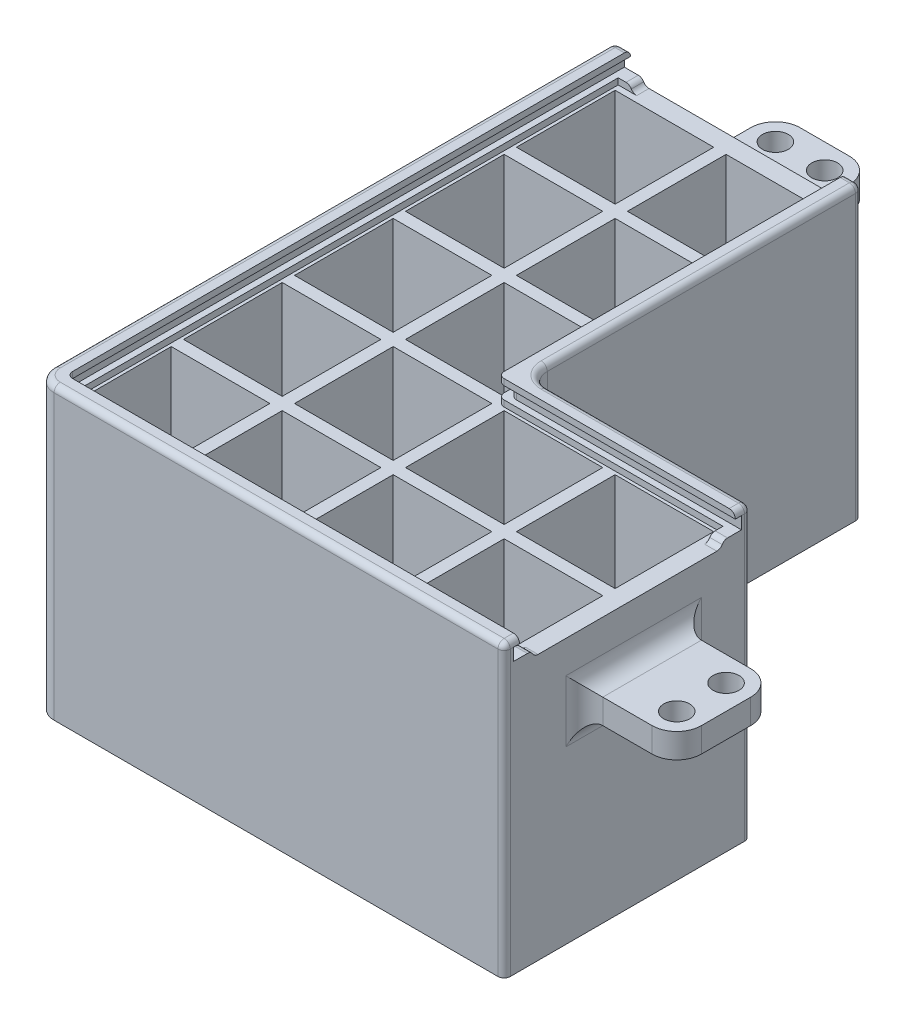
ISO-10303-21;
HEADER;
FILE_DESCRIPTION(('STEP AP214'),'2;1');
FILE_NAME('part.step','',(''),(''),'','','');
FILE_SCHEMA(('AUTOMOTIVE_DESIGN { 1 0 10303 214 1 1 1 1 }'));
ENDSEC;
DATA;
#1=APPLICATION_CONTEXT('core data for automotive mechanical design processes');
#2=APPLICATION_PROTOCOL_DEFINITION('international standard','automotive_design',2000,#1);
#3=PRODUCT_CONTEXT('',#1,'mechanical');
#4=PRODUCT('Part','Part','',(#3));
#5=PRODUCT_RELATED_PRODUCT_CATEGORY('part','',(#4));
#6=PRODUCT_DEFINITION_FORMATION('','',#4);
#7=PRODUCT_DEFINITION_CONTEXT('part definition',#1,'design');
#8=PRODUCT_DEFINITION('design','',#6,#7);
#9=PRODUCT_DEFINITION_SHAPE('','',#8);
#10=(LENGTH_UNIT() NAMED_UNIT(*) SI_UNIT(.MILLI.,.METRE.));
#11=(NAMED_UNIT(*) PLANE_ANGLE_UNIT() SI_UNIT($,.RADIAN.));
#12=(NAMED_UNIT(*) SI_UNIT($,.STERADIAN.) SOLID_ANGLE_UNIT());
#13=UNCERTAINTY_MEASURE_WITH_UNIT(LENGTH_MEASURE(1.E-05),#10,'distance_accuracy_value','');
#14=(GEOMETRIC_REPRESENTATION_CONTEXT(3) GLOBAL_UNCERTAINTY_ASSIGNED_CONTEXT((#13)) GLOBAL_UNIT_ASSIGNED_CONTEXT((#10,
#11,#12)) REPRESENTATION_CONTEXT('',''));
#15=CARTESIAN_POINT('',(0.,0.,0.));
#16=DIRECTION('',(0.,0.,1.));
#17=DIRECTION('',(1.,0.,0.));
#18=AXIS2_PLACEMENT_3D('',#15,#16,#17);
#19=CARTESIAN_POINT('',(36.,40.,-100.));
#20=DIRECTION('',(-1.,0.,0.));
#21=DIRECTION('',(0.,0.,-1.));
#22=AXIS2_PLACEMENT_3D('',#19,#20,#21);
#23=PLANE('',#22);
#24=DIRECTION('',(0.,-1.,0.));
#25=VECTOR('',#24,1.);
#26=CARTESIAN_POINT('',(36.,31.75,-92.));
#27=LINE('',#26,#25);
#28=CARTESIAN_POINT('',(36.,24.75,-92.));
#29=VERTEX_POINT('',#28);
#30=CARTESIAN_POINT('',(36.,34.75,-92.));
#31=VERTEX_POINT('',#30);
#32=EDGE_CURVE('E1611',#29,#31,#27,.F.);
#33=ORIENTED_EDGE('',*,*,#32,.F.);
#34=DIRECTION('',(0.,0.,1.));
#35=VECTOR('',#34,1.);
#36=CARTESIAN_POINT('',(36.,24.75,-89.));
#37=LINE('',#36,#35);
#38=CARTESIAN_POINT('',(36.,24.75,-70.));
#39=VERTEX_POINT('',#38);
#40=EDGE_CURVE('E1608',#39,#29,#37,.F.);
#41=ORIENTED_EDGE('',*,*,#40,.F.);
#42=DIRECTION('',(0.,1.,0.));
#43=VECTOR('',#42,1.);
#44=CARTESIAN_POINT('',(36.,27.75,-70.));
#45=LINE('',#44,#43);
#46=CARTESIAN_POINT('',(36.,34.75,-70.));
#47=VERTEX_POINT('',#46);
#48=EDGE_CURVE('E1614',#47,#39,#45,.F.);
#49=ORIENTED_EDGE('',*,*,#48,.F.);
#50=DIRECTION('',(0.,0.,-1.));
#51=VECTOR('',#50,1.);
#52=CARTESIAN_POINT('',(36.,34.75,-73.));
#53=LINE('',#52,#51);
#54=EDGE_CURVE('E1617',#31,#47,#53,.F.);
#55=ORIENTED_EDGE('',*,*,#54,.F.);
#56=EDGE_LOOP('',(#33,#41,#49,#55));
#57=FACE_BOUND('',#56,.T.);
#58=DIRECTION('',(0.,0.,1.));
#59=VECTOR('',#58,1.);
#60=CARTESIAN_POINT('',(36.,41.,-62.5));
#61=LINE('',#60,#59);
#62=CARTESIAN_POINT('',(36.,41.,-63.7679491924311));
#63=VERTEX_POINT('',#62);
#64=CARTESIAN_POINT('',(36.,41.,-61.5));
#65=VERTEX_POINT('',#64);
#66=EDGE_CURVE('E1774',#63,#65,#61,.T.);
#67=ORIENTED_EDGE('',*,*,#66,.T.);
#68=DIRECTION('',(0.,-1.,0.));
#69=VECTOR('',#68,1.);
#70=CARTESIAN_POINT('',(36.,43.,-61.5));
#71=LINE('',#70,#69);
#72=CARTESIAN_POINT('',(36.,43.,-61.5));
#73=VERTEX_POINT('',#72);
#74=EDGE_CURVE('E1766',#73,#65,#71,.T.);
#75=ORIENTED_EDGE('',*,*,#74,.F.);
#76=DIRECTION('',(0.,0.,1.));
#77=VECTOR('',#76,1.);
#78=CARTESIAN_POINT('',(36.,43.,-62.5));
#79=LINE('',#78,#77);
#80=CARTESIAN_POINT('',(36.,43.,-61.));
#81=VERTEX_POINT('',#80);
#82=EDGE_CURVE('E1460',#81,#73,#79,.F.);
#83=ORIENTED_EDGE('',*,*,#82,.F.);
#84=DIRECTION('',(0.,-1.,0.));
#85=VECTOR('',#84,1.);
#86=CARTESIAN_POINT('',(36.,44.,-61.));
#87=LINE('',#86,#85);
#88=CARTESIAN_POINT('',(36.,-3.,-61.));
#89=VERTEX_POINT('',#88);
#90=EDGE_CURVE('E1457',#89,#81,#87,.F.);
#91=ORIENTED_EDGE('',*,*,#90,.F.);
#92=DIRECTION('',(0.,0.,-1.));
#93=VECTOR('',#92,1.);
#94=CARTESIAN_POINT('',(36.,-3.,-60.));
#95=LINE('',#94,#93);
#96=CARTESIAN_POINT('',(36.,-3.,-99.));
#97=VERTEX_POINT('',#96);
#98=EDGE_CURVE('E901',#89,#97,#95,.T.);
#99=ORIENTED_EDGE('',*,*,#98,.T.);
#100=DIRECTION('',(0.,-1.,0.));
#101=VECTOR('',#100,1.);
#102=CARTESIAN_POINT('',(36.,-3.,-99.));
#103=LINE('',#102,#101);
#104=CARTESIAN_POINT('',(36.,43.,-99.));
#105=VERTEX_POINT('',#104);
#106=EDGE_CURVE('E1451',#105,#97,#103,.T.);
#107=ORIENTED_EDGE('',*,*,#106,.F.);
#108=DIRECTION('',(0.,0.,1.));
#109=VECTOR('',#108,1.);
#110=CARTESIAN_POINT('',(36.,43.,-100.));
#111=LINE('',#110,#109);
#112=CARTESIAN_POINT('',(36.,43.,-98.5));
#113=VERTEX_POINT('',#112);
#114=EDGE_CURVE('E1454',#113,#105,#111,.F.);
#115=ORIENTED_EDGE('',*,*,#114,.F.);
#116=DIRECTION('',(0.,-1.,0.));
#117=VECTOR('',#116,1.);
#118=CARTESIAN_POINT('',(36.,43.,-98.5));
#119=LINE('',#118,#117);
#120=CARTESIAN_POINT('',(36.,41.,-98.5));
#121=VERTEX_POINT('',#120);
#122=EDGE_CURVE('E1851',#113,#121,#119,.T.);
#123=ORIENTED_EDGE('',*,*,#122,.T.);
#124=DIRECTION('',(0.,0.,-1.));
#125=VECTOR('',#124,1.);
#126=CARTESIAN_POINT('',(36.,41.,-97.5));
#127=LINE('',#126,#125);
#128=CARTESIAN_POINT('',(36.,41.,-96.2320508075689));
#129=VERTEX_POINT('',#128);
#130=EDGE_CURVE('E1739',#129,#121,#127,.T.);
#131=ORIENTED_EDGE('',*,*,#130,.F.);
#132=CARTESIAN_POINT('',(36.,40.,-96.2320508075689));
#133=DIRECTION('',(1.,0.,0.));
#134=DIRECTION('',(0.,0.,-1.));
#135=AXIS2_PLACEMENT_3D('',#132,#133,#134);
#136=CIRCLE('',#135,1.);
#137=CARTESIAN_POINT('',(36.,40.5,-95.3660254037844));
#138=VERTEX_POINT('',#137);
#139=EDGE_CURVE('E1570',#138,#129,#136,.F.);
#140=ORIENTED_EDGE('',*,*,#139,.F.);
#141=CARTESIAN_POINT('',(36.,41.,-94.5));
#142=DIRECTION('',(1.,0.,0.));
#143=DIRECTION('',(0.,0.,-1.));
#144=AXIS2_PLACEMENT_3D('',#141,#142,#143);
#145=CIRCLE('',#144,1.);
#146=CARTESIAN_POINT('',(36.,40.,-94.5));
#147=VERTEX_POINT('',#146);
#148=EDGE_CURVE('E1547',#147,#138,#145,.T.);
#149=ORIENTED_EDGE('',*,*,#148,.F.);
#150=DIRECTION('',(0.,0.,1.));
#151=VECTOR('',#150,1.);
#152=CARTESIAN_POINT('',(36.,40.,-100.));
#153=LINE('',#152,#151);
#154=CARTESIAN_POINT('',(36.,40.,-65.5));
#155=VERTEX_POINT('',#154);
#156=EDGE_CURVE('E1054',#147,#155,#153,.T.);
#157=ORIENTED_EDGE('',*,*,#156,.T.);
#158=CARTESIAN_POINT('',(36.,41.,-65.5));
#159=DIRECTION('',(1.,0.,0.));
#160=DIRECTION('',(0.,0.,-1.));
#161=AXIS2_PLACEMENT_3D('',#158,#159,#160);
#162=CIRCLE('',#161,1.);
#163=CARTESIAN_POINT('',(36.,40.5,-64.6339745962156));
#164=VERTEX_POINT('',#163);
#165=EDGE_CURVE('E1550',#164,#155,#162,.T.);
#166=ORIENTED_EDGE('',*,*,#165,.F.);
#167=CARTESIAN_POINT('',(36.,40.,-63.7679491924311));
#168=DIRECTION('',(1.,0.,0.));
#169=DIRECTION('',(0.,0.,-1.));
#170=AXIS2_PLACEMENT_3D('',#167,#168,#169);
#171=CIRCLE('',#170,1.);
#172=EDGE_CURVE('E1573',#63,#164,#171,.F.);
#173=ORIENTED_EDGE('',*,*,#172,.F.);
#174=EDGE_LOOP('',(#67,#75,#83,#91,#99,#107,#115,#123,#131,#140,#149,#157,#166,#173));
#175=FACE_BOUND('',#174,.T.);
#176=ADVANCED_FACE('F80',(#57,#175),#23,.F.);
#177=CARTESIAN_POINT('',(0.,40.,-154.));
#178=DIRECTION('',(0.,0.,-1.));
#179=DIRECTION('',(1.,0.,0.));
#180=AXIS2_PLACEMENT_3D('',#177,#178,#179);
#181=PLANE('',#180);
#182=DIRECTION('',(1.,0.,0.));
#183=VECTOR('',#182,1.);
#184=CARTESIAN_POINT('',(0.,24.75,-154.));
#185=LINE('',#184,#183);
#186=CARTESIAN_POINT('',(-10.,24.75,-154.));
#187=VERTEX_POINT('',#186);
#188=CARTESIAN_POINT('',(-32.,24.75,-154.));
#189=VERTEX_POINT('',#188);
#190=EDGE_CURVE('E1638',#187,#189,#185,.F.);
#191=ORIENTED_EDGE('',*,*,#190,.F.);
#192=DIRECTION('',(0.,1.,0.));
#193=VECTOR('',#192,1.);
#194=CARTESIAN_POINT('',(-9.99999999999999,40.,-154.));
#195=LINE('',#194,#193);
#196=CARTESIAN_POINT('',(-9.99999999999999,34.75,-154.));
#197=VERTEX_POINT('',#196);
#198=EDGE_CURVE('E1635',#197,#187,#195,.F.);
#199=ORIENTED_EDGE('',*,*,#198,.F.);
#200=DIRECTION('',(-1.,0.,0.));
#201=VECTOR('',#200,1.);
#202=CARTESIAN_POINT('',(0.,34.75,-154.));
#203=LINE('',#202,#201);
#204=CARTESIAN_POINT('',(-32.,34.75,-154.));
#205=VERTEX_POINT('',#204);
#206=EDGE_CURVE('E1632',#205,#197,#203,.F.);
#207=ORIENTED_EDGE('',*,*,#206,.F.);
#208=DIRECTION('',(0.,-1.,0.));
#209=VECTOR('',#208,1.);
#210=CARTESIAN_POINT('',(-32.,40.,-154.));
#211=LINE('',#210,#209);
#212=EDGE_CURVE('E1641',#189,#205,#211,.F.);
#213=ORIENTED_EDGE('',*,*,#212,.F.);
#214=EDGE_LOOP('',(#191,#199,#207,#213));
#215=FACE_BOUND('',#214,.T.);
#216=DIRECTION('',(1.,0.,0.));
#217=VECTOR('',#216,1.);
#218=CARTESIAN_POINT('',(-2.49999999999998,41.,-154.));
#219=LINE('',#218,#217);
#220=CARTESIAN_POINT('',(-3.76794919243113,41.,-154.));
#221=VERTEX_POINT('',#220);
#222=CARTESIAN_POINT('',(-1.49999999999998,41.,-154.));
#223=VERTEX_POINT('',#222);
#224=EDGE_CURVE('E1832',#221,#223,#219,.T.);
#225=ORIENTED_EDGE('',*,*,#224,.T.);
#226=DIRECTION('',(0.,1.,0.));
#227=VECTOR('',#226,1.);
#228=CARTESIAN_POINT('',(-1.49999999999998,43.,-154.));
#229=LINE('',#228,#227);
#230=CARTESIAN_POINT('',(-1.49999999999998,43.,-154.));
#231=VERTEX_POINT('',#230);
#232=EDGE_CURVE('E1837',#223,#231,#229,.T.);
#233=ORIENTED_EDGE('',*,*,#232,.T.);
#234=DIRECTION('',(1.,0.,0.));
#235=VECTOR('',#234,1.);
#236=CARTESIAN_POINT('',(0.,43.,-154.));
#237=LINE('',#236,#235);
#238=CARTESIAN_POINT('',(-0.999999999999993,43.,-154.));
#239=VERTEX_POINT('',#238);
#240=EDGE_CURVE('E1480',#239,#231,#237,.F.);
#241=ORIENTED_EDGE('',*,*,#240,.F.);
#242=DIRECTION('',(0.,-1.,0.));
#243=VECTOR('',#242,1.);
#244=CARTESIAN_POINT('',(-0.999999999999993,40.,-154.));
#245=LINE('',#244,#243);
#246=CARTESIAN_POINT('',(-0.999999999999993,-3.,-154.));
#247=VERTEX_POINT('',#246);
#248=EDGE_CURVE('E1477',#247,#239,#245,.F.);
#249=ORIENTED_EDGE('',*,*,#248,.F.);
#250=DIRECTION('',(-1.,0.,0.));
#251=VECTOR('',#250,1.);
#252=CARTESIAN_POINT('',(0.,-3.,-154.));
#253=LINE('',#252,#251);
#254=CARTESIAN_POINT('',(-39.,-3.,-154.));
#255=VERTEX_POINT('',#254);
#256=EDGE_CURVE('E892',#247,#255,#253,.T.);
#257=ORIENTED_EDGE('',*,*,#256,.T.);
#258=DIRECTION('',(0.,-1.,0.));
#259=VECTOR('',#258,1.);
#260=CARTESIAN_POINT('',(-39.,40.,-154.));
#261=LINE('',#260,#259);
#262=CARTESIAN_POINT('',(-39.,43.,-154.));
#263=VERTEX_POINT('',#262);
#264=EDGE_CURVE('E1471',#263,#255,#261,.T.);
#265=ORIENTED_EDGE('',*,*,#264,.F.);
#266=DIRECTION('',(1.,0.,0.));
#267=VECTOR('',#266,1.);
#268=CARTESIAN_POINT('',(0.,43.,-154.));
#269=LINE('',#268,#267);
#270=CARTESIAN_POINT('',(-38.5,43.,-154.));
#271=VERTEX_POINT('',#270);
#272=EDGE_CURVE('E1474',#271,#263,#269,.F.);
#273=ORIENTED_EDGE('',*,*,#272,.F.);
#274=DIRECTION('',(0.,-1.,0.));
#275=VECTOR('',#274,1.);
#276=CARTESIAN_POINT('',(-38.5,43.,-154.));
#277=LINE('',#276,#275);
#278=CARTESIAN_POINT('',(-38.5,41.,-154.));
#279=VERTEX_POINT('',#278);
#280=EDGE_CURVE('E1831',#271,#279,#277,.T.);
#281=ORIENTED_EDGE('',*,*,#280,.T.);
#282=DIRECTION('',(1.,0.,0.));
#283=VECTOR('',#282,1.);
#284=CARTESIAN_POINT('',(-37.5,41.,-154.));
#285=LINE('',#284,#283);
#286=CARTESIAN_POINT('',(-36.2320508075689,41.,-154.));
#287=VERTEX_POINT('',#286);
#288=EDGE_CURVE('E1775',#279,#287,#285,.T.);
#289=ORIENTED_EDGE('',*,*,#288,.T.);
#290=CARTESIAN_POINT('',(-36.2320508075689,40.,-154.));
#291=DIRECTION('',(0.,0.,1.));
#292=DIRECTION('',(1.,0.,0.));
#293=AXIS2_PLACEMENT_3D('',#290,#291,#292);
#294=CIRCLE('',#293,1.);
#295=CARTESIAN_POINT('',(-35.3660254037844,40.5,-154.));
#296=VERTEX_POINT('',#295);
#297=EDGE_CURVE('E1590',#296,#287,#294,.T.);
#298=ORIENTED_EDGE('',*,*,#297,.F.);
#299=CARTESIAN_POINT('',(-34.5,41.,-154.));
#300=DIRECTION('',(0.,0.,1.));
#301=DIRECTION('',(1.,0.,0.));
#302=AXIS2_PLACEMENT_3D('',#299,#300,#301);
#303=CIRCLE('',#302,1.);
#304=CARTESIAN_POINT('',(-34.5,40.,-154.));
#305=VERTEX_POINT('',#304);
#306=EDGE_CURVE('E1556',#305,#296,#303,.F.);
#307=ORIENTED_EDGE('',*,*,#306,.F.);
#308=DIRECTION('',(-1.,0.,0.));
#309=VECTOR('',#308,1.);
#310=CARTESIAN_POINT('',(0.,40.,-154.));
#311=LINE('',#310,#309);
#312=CARTESIAN_POINT('',(-5.5,40.,-154.));
#313=VERTEX_POINT('',#312);
#314=EDGE_CURVE('E1057',#313,#305,#311,.T.);
#315=ORIENTED_EDGE('',*,*,#314,.F.);
#316=CARTESIAN_POINT('',(-5.5,41.,-154.));
#317=DIRECTION('',(0.,0.,1.));
#318=DIRECTION('',(1.,0.,0.));
#319=AXIS2_PLACEMENT_3D('',#316,#317,#318);
#320=CIRCLE('',#319,1.);
#321=CARTESIAN_POINT('',(-4.63397459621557,40.5,-154.));
#322=VERTEX_POINT('',#321);
#323=EDGE_CURVE('E1559',#322,#313,#320,.F.);
#324=ORIENTED_EDGE('',*,*,#323,.F.);
#325=CARTESIAN_POINT('',(-3.76794919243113,40.,-154.));
#326=DIRECTION('',(0.,0.,1.));
#327=DIRECTION('',(1.,0.,0.));
#328=AXIS2_PLACEMENT_3D('',#325,#326,#327);
#329=CIRCLE('',#328,1.);
#330=EDGE_CURVE('E1593',#221,#322,#329,.T.);
#331=ORIENTED_EDGE('',*,*,#330,.F.);
#332=EDGE_LOOP('',(#225,#233,#241,#249,#257,#265,#273,#281,#289,#298,#307,#315,#324,#331));
#333=FACE_BOUND('',#332,.T.);
#334=ADVANCED_FACE('F1865',(#215,#333),#181,.T.);
#335=CARTESIAN_POINT('',(0.,40.,-100.));
#336=DIRECTION('',(0.,1.,0.));
#337=DIRECTION('',(0.,0.,-1.));
#338=AXIS2_PLACEMENT_3D('',#335,#336,#337);
#339=PLANE('',#338);
#340=DIRECTION('',(1.,0.,0.));
#341=VECTOR('',#340,1.);
#342=CARTESIAN_POINT('',(0.,40.,-115.));
#343=LINE('',#342,#341);
#344=CARTESIAN_POINT('',(-19.,40.,-115.));
#345=VERTEX_POINT('',#344);
#346=CARTESIAN_POINT('',(-3.,40.,-115.));
#347=VERTEX_POINT('',#346);
#348=EDGE_CURVE('E905',#345,#347,#343,.T.);
#349=ORIENTED_EDGE('',*,*,#348,.T.);
#350=DIRECTION('',(0.,0.,-1.));
#351=VECTOR('',#350,1.);
#352=CARTESIAN_POINT('',(-3.,40.,-100.));
#353=LINE('',#352,#351);
#354=CARTESIAN_POINT('',(-3.,40.,-99.));
#355=VERTEX_POINT('',#354);
#356=EDGE_CURVE('E915',#355,#347,#353,.T.);
#357=ORIENTED_EDGE('',*,*,#356,.F.);
#358=DIRECTION('',(1.,0.,0.));
#359=VECTOR('',#358,1.);
#360=CARTESIAN_POINT('',(0.,40.,-99.));
#361=LINE('',#360,#359);
#362=CARTESIAN_POINT('',(-19.,40.,-99.));
#363=VERTEX_POINT('',#362);
#364=EDGE_CURVE('E912',#363,#355,#361,.T.);
#365=ORIENTED_EDGE('',*,*,#364,.F.);
#366=DIRECTION('',(0.,0.,-1.));
#367=VECTOR('',#366,1.);
#368=CARTESIAN_POINT('',(-19.,40.,-100.));
#369=LINE('',#368,#367);
#370=EDGE_CURVE('E908',#363,#345,#369,.T.);
#371=ORIENTED_EDGE('',*,*,#370,.T.);
#372=EDGE_LOOP('',(#349,#357,#365,#371));
#373=FACE_BOUND('',#372,.T.);
#374=DIRECTION('',(0.,0.,-1.));
#375=VECTOR('',#374,1.);
#376=CARTESIAN_POINT('',(-19.,40.,-100.));
#377=LINE('',#376,#375);
#378=CARTESIAN_POINT('',(-19.,40.,-117.));
#379=VERTEX_POINT('',#378);
#380=CARTESIAN_POINT('',(-19.,40.,-133.));
#381=VERTEX_POINT('',#380);
#382=EDGE_CURVE('E918',#379,#381,#377,.T.);
#383=ORIENTED_EDGE('',*,*,#382,.T.);
#384=DIRECTION('',(1.,0.,0.));
#385=VECTOR('',#384,1.);
#386=CARTESIAN_POINT('',(0.,40.,-133.));
#387=LINE('',#386,#385);
#388=CARTESIAN_POINT('',(-3.,40.,-133.));
#389=VERTEX_POINT('',#388);
#390=EDGE_CURVE('E927',#381,#389,#387,.T.);
#391=ORIENTED_EDGE('',*,*,#390,.T.);
#392=DIRECTION('',(0.,0.,-1.));
#393=VECTOR('',#392,1.);
#394=CARTESIAN_POINT('',(-3.,40.,-100.));
#395=LINE('',#394,#393);
#396=CARTESIAN_POINT('',(-3.,40.,-117.));
#397=VERTEX_POINT('',#396);
#398=EDGE_CURVE('E924',#397,#389,#395,.T.);
#399=ORIENTED_EDGE('',*,*,#398,.F.);
#400=DIRECTION('',(1.,0.,0.));
#401=VECTOR('',#400,1.);
#402=CARTESIAN_POINT('',(0.,40.,-117.));
#403=LINE('',#402,#401);
#404=EDGE_CURVE('E921',#379,#397,#403,.T.);
#405=ORIENTED_EDGE('',*,*,#404,.F.);
#406=EDGE_LOOP('',(#383,#391,#399,#405));
#407=FACE_BOUND('',#406,.T.);
#408=DIRECTION('',(1.,0.,0.));
#409=VECTOR('',#408,1.);
#410=CARTESIAN_POINT('',(0.,40.,-135.));
#411=LINE('',#410,#409);
#412=CARTESIAN_POINT('',(-37.,40.,-135.));
#413=VERTEX_POINT('',#412);
#414=CARTESIAN_POINT('',(-21.,40.,-135.));
#415=VERTEX_POINT('',#414);
#416=EDGE_CURVE('E931',#413,#415,#411,.T.);
#417=ORIENTED_EDGE('',*,*,#416,.F.);
#418=DIRECTION('',(0.,0.,-1.));
#419=VECTOR('',#418,1.);
#420=CARTESIAN_POINT('',(-37.,40.,-100.));
#421=LINE('',#420,#419);
#422=CARTESIAN_POINT('',(-37.,40.,-151.));
#423=VERTEX_POINT('',#422);
#424=EDGE_CURVE('E940',#413,#423,#421,.T.);
#425=ORIENTED_EDGE('',*,*,#424,.T.);
#426=DIRECTION('',(-1.,0.,0.));
#427=VECTOR('',#426,1.);
#428=CARTESIAN_POINT('',(0.,40.,-151.));
#429=LINE('',#428,#427);
#430=CARTESIAN_POINT('',(-21.,40.,-151.));
#431=VERTEX_POINT('',#430);
#432=EDGE_CURVE('E937',#431,#423,#429,.T.);
#433=ORIENTED_EDGE('',*,*,#432,.F.);
#434=DIRECTION('',(0.,0.,-1.));
#435=VECTOR('',#434,1.);
#436=CARTESIAN_POINT('',(-21.,40.,-100.));
#437=LINE('',#436,#435);
#438=EDGE_CURVE('E934',#415,#431,#437,.T.);
#439=ORIENTED_EDGE('',*,*,#438,.F.);
#440=EDGE_LOOP('',(#417,#425,#433,#439));
#441=FACE_BOUND('',#440,.T.);
#442=DIRECTION('',(1.,0.,0.));
#443=VECTOR('',#442,1.);
#444=CARTESIAN_POINT('',(0.,40.,-117.));
#445=LINE('',#444,#443);
#446=CARTESIAN_POINT('',(-37.,40.,-117.));
#447=VERTEX_POINT('',#446);
#448=CARTESIAN_POINT('',(-21.,40.,-117.));
#449=VERTEX_POINT('',#448);
#450=EDGE_CURVE('E944',#447,#449,#445,.T.);
#451=ORIENTED_EDGE('',*,*,#450,.F.);
#452=CARTESIAN_POINT('',(-37.,40.,-133.));
#453=VERTEX_POINT('',#452);
#454=EDGE_CURVE('E945',#447,#453,#421,.T.);
#455=ORIENTED_EDGE('',*,*,#454,.T.);
#456=DIRECTION('',(1.,0.,0.));
#457=VECTOR('',#456,1.);
#458=CARTESIAN_POINT('',(0.,40.,-133.));
#459=LINE('',#458,#457);
#460=CARTESIAN_POINT('',(-21.,40.,-133.));
#461=VERTEX_POINT('',#460);
#462=EDGE_CURVE('E951',#453,#461,#459,.T.);
#463=ORIENTED_EDGE('',*,*,#462,.T.);
#464=DIRECTION('',(0.,0.,-1.));
#465=VECTOR('',#464,1.);
#466=CARTESIAN_POINT('',(-21.,40.,-100.));
#467=LINE('',#466,#465);
#468=EDGE_CURVE('E948',#449,#461,#467,.T.);
#469=ORIENTED_EDGE('',*,*,#468,.F.);
#470=EDGE_LOOP('',(#451,#455,#463,#469));
#471=FACE_BOUND('',#470,.T.);
#472=DIRECTION('',(0.,0.,-1.));
#473=VECTOR('',#472,1.);
#474=CARTESIAN_POINT('',(-19.,40.,-100.));
#475=LINE('',#474,#473);
#476=CARTESIAN_POINT('',(-19.,40.,-135.));
#477=VERTEX_POINT('',#476);
#478=CARTESIAN_POINT('',(-19.,40.,-151.));
#479=VERTEX_POINT('',#478);
#480=EDGE_CURVE('E954',#477,#479,#475,.T.);
#481=ORIENTED_EDGE('',*,*,#480,.T.);
#482=CARTESIAN_POINT('',(-2.99999999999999,40.,-151.));
#483=VERTEX_POINT('',#482);
#484=EDGE_CURVE('E941',#483,#479,#429,.T.);
#485=ORIENTED_EDGE('',*,*,#484,.F.);
#486=CARTESIAN_POINT('',(-3.,40.,-135.));
#487=VERTEX_POINT('',#486);
#488=EDGE_CURVE('E928',#487,#483,#395,.T.);
#489=ORIENTED_EDGE('',*,*,#488,.F.);
#490=DIRECTION('',(1.,0.,0.));
#491=VECTOR('',#490,1.);
#492=CARTESIAN_POINT('',(0.,40.,-135.));
#493=LINE('',#492,#491);
#494=EDGE_CURVE('E957',#477,#487,#493,.T.);
#495=ORIENTED_EDGE('',*,*,#494,.F.);
#496=EDGE_LOOP('',(#481,#485,#489,#495));
#497=FACE_BOUND('',#496,.T.);
#498=DIRECTION('',(1.,0.,0.));
#499=VECTOR('',#498,1.);
#500=CARTESIAN_POINT('',(0.,40.,-97.));
#501=LINE('',#500,#499);
#502=CARTESIAN_POINT('',(-19.,40.,-97.0000000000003));
#503=VERTEX_POINT('',#502);
#504=CARTESIAN_POINT('',(-3.,40.,-97.0000000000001));
#505=VERTEX_POINT('',#504);
#506=EDGE_CURVE('E960',#503,#505,#501,.T.);
#507=ORIENTED_EDGE('',*,*,#506,.T.);
#508=DIRECTION('',(0.,0.,-1.));
#509=VECTOR('',#508,1.);
#510=CARTESIAN_POINT('',(-3.,40.,-100.));
#511=LINE('',#510,#509);
#512=CARTESIAN_POINT('',(-3.,40.,-81.));
#513=VERTEX_POINT('',#512);
#514=EDGE_CURVE('E969',#513,#505,#511,.T.);
#515=ORIENTED_EDGE('',*,*,#514,.F.);
#516=DIRECTION('',(1.,0.,0.));
#517=VECTOR('',#516,1.);
#518=CARTESIAN_POINT('',(0.,40.,-81.));
#519=LINE('',#518,#517);
#520=CARTESIAN_POINT('',(-19.,40.,-81.));
#521=VERTEX_POINT('',#520);
#522=EDGE_CURVE('E966',#521,#513,#519,.T.);
#523=ORIENTED_EDGE('',*,*,#522,.F.);
#524=DIRECTION('',(0.,0.,-1.));
#525=VECTOR('',#524,1.);
#526=CARTESIAN_POINT('',(-19.,40.,-100.));
#527=LINE('',#526,#525);
#528=EDGE_CURVE('E963',#521,#503,#527,.T.);
#529=ORIENTED_EDGE('',*,*,#528,.T.);
#530=EDGE_LOOP('',(#507,#515,#523,#529));
#531=FACE_BOUND('',#530,.T.);
#532=DIRECTION('',(1.,0.,0.));
#533=VECTOR('',#532,1.);
#534=CARTESIAN_POINT('',(0.,40.,-81.));
#535=LINE('',#534,#533);
#536=CARTESIAN_POINT('',(-37.,40.,-81.));
#537=VERTEX_POINT('',#536);
#538=CARTESIAN_POINT('',(-21.,40.,-81.));
#539=VERTEX_POINT('',#538);
#540=EDGE_CURVE('E972',#537,#539,#535,.T.);
#541=ORIENTED_EDGE('',*,*,#540,.F.);
#542=DIRECTION('',(0.,0.,1.));
#543=VECTOR('',#542,1.);
#544=CARTESIAN_POINT('',(-37.,40.,-100.));
#545=LINE('',#544,#543);
#546=CARTESIAN_POINT('',(-37.,40.,-97.0000000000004));
#547=VERTEX_POINT('',#546);
#548=EDGE_CURVE('E981',#547,#537,#545,.T.);
#549=ORIENTED_EDGE('',*,*,#548,.F.);
#550=DIRECTION('',(1.,0.,0.));
#551=VECTOR('',#550,1.);
#552=CARTESIAN_POINT('',(0.,40.,-97.));
#553=LINE('',#552,#551);
#554=CARTESIAN_POINT('',(-21.,40.,-97.0000000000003));
#555=VERTEX_POINT('',#554);
#556=EDGE_CURVE('E978',#547,#555,#553,.T.);
#557=ORIENTED_EDGE('',*,*,#556,.T.);
#558=DIRECTION('',(0.,0.,-1.));
#559=VECTOR('',#558,1.);
#560=CARTESIAN_POINT('',(-21.,40.,-100.));
#561=LINE('',#560,#559);
#562=EDGE_CURVE('E975',#539,#555,#561,.T.);
#563=ORIENTED_EDGE('',*,*,#562,.F.);
#564=EDGE_LOOP('',(#541,#549,#557,#563));
#565=FACE_BOUND('',#564,.T.);
#566=DIRECTION('',(0.,0.,-1.));
#567=VECTOR('',#566,1.);
#568=CARTESIAN_POINT('',(-1.,40.,-100.));
#569=LINE('',#568,#567);
#570=CARTESIAN_POINT('',(-1.,40.,-81.));
#571=VERTEX_POINT('',#570);
#572=CARTESIAN_POINT('',(-1.,40.,-97.0000000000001));
#573=VERTEX_POINT('',#572);
#574=EDGE_CURVE('E984',#571,#573,#569,.T.);
#575=ORIENTED_EDGE('',*,*,#574,.T.);
#576=DIRECTION('',(-1.,0.,0.));
#577=VECTOR('',#576,1.);
#578=CARTESIAN_POINT('',(-1.23165366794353E-13,40.,-97.));
#579=LINE('',#578,#577);
#580=CARTESIAN_POINT('',(15.,40.,-96.9999999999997));
#581=VERTEX_POINT('',#580);
#582=EDGE_CURVE('E995',#581,#573,#579,.T.);
#583=ORIENTED_EDGE('',*,*,#582,.F.);
#584=DIRECTION('',(0.,0.,-1.));
#585=VECTOR('',#584,1.);
#586=CARTESIAN_POINT('',(15.,40.,-100.));
#587=LINE('',#586,#585);
#588=CARTESIAN_POINT('',(15.,40.,-81.));
#589=VERTEX_POINT('',#588);
#590=EDGE_CURVE('E992',#589,#581,#587,.T.);
#591=ORIENTED_EDGE('',*,*,#590,.F.);
#592=DIRECTION('',(1.,0.,0.));
#593=VECTOR('',#592,1.);
#594=CARTESIAN_POINT('',(0.,40.,-81.));
#595=LINE('',#594,#593);
#596=EDGE_CURVE('E989',#571,#589,#595,.T.);
#597=ORIENTED_EDGE('',*,*,#596,.F.);
#598=EDGE_LOOP('',(#575,#583,#591,#597));
#599=FACE_BOUND('',#598,.T.);
#600=DIRECTION('',(1.,0.,0.));
#601=VECTOR('',#600,1.);
#602=CARTESIAN_POINT('',(0.,40.,-79.));
#603=LINE('',#602,#601);
#604=CARTESIAN_POINT('',(-1.,40.,-79.));
#605=VERTEX_POINT('',#604);
#606=CARTESIAN_POINT('',(15.,40.,-79.));
#607=VERTEX_POINT('',#606);
#608=EDGE_CURVE('E998',#605,#607,#603,.T.);
#609=ORIENTED_EDGE('',*,*,#608,.T.);
#610=DIRECTION('',(0.,0.,-1.));
#611=VECTOR('',#610,1.);
#612=CARTESIAN_POINT('',(15.,40.,-100.));
#613=LINE('',#612,#611);
#614=CARTESIAN_POINT('',(15.,40.,-63.));
#615=VERTEX_POINT('',#614);
#616=EDGE_CURVE('E1008',#615,#607,#613,.T.);
#617=ORIENTED_EDGE('',*,*,#616,.F.);
#618=DIRECTION('',(-1.,0.,0.));
#619=VECTOR('',#618,1.);
#620=CARTESIAN_POINT('',(0.,40.,-63.));
#621=LINE('',#620,#619);
#622=CARTESIAN_POINT('',(-1.,40.,-63.));
#623=VERTEX_POINT('',#622);
#624=EDGE_CURVE('E1005',#615,#623,#621,.T.);
#625=ORIENTED_EDGE('',*,*,#624,.T.);
#626=DIRECTION('',(0.,0.,-1.));
#627=VECTOR('',#626,1.);
#628=CARTESIAN_POINT('',(-1.,40.,-100.));
#629=LINE('',#628,#627);
#630=EDGE_CURVE('E1002',#623,#605,#629,.T.);
#631=ORIENTED_EDGE('',*,*,#630,.T.);
#632=EDGE_LOOP('',(#609,#617,#625,#631));
#633=FACE_BOUND('',#632,.T.);
#634=DIRECTION('',(0.,0.,-1.));
#635=VECTOR('',#634,1.);
#636=CARTESIAN_POINT('',(17.,40.,-100.));
#637=LINE('',#636,#635);
#638=CARTESIAN_POINT('',(17.,40.,-81.));
#639=VERTEX_POINT('',#638);
#640=CARTESIAN_POINT('',(17.,40.,-96.9999999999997));
#641=VERTEX_POINT('',#640);
#642=EDGE_CURVE('E1013',#639,#641,#637,.T.);
#643=ORIENTED_EDGE('',*,*,#642,.T.);
#644=CARTESIAN_POINT('',(33.,40.,-97.));
#645=VERTEX_POINT('',#644);
#646=EDGE_CURVE('E999',#645,#641,#579,.T.);
#647=ORIENTED_EDGE('',*,*,#646,.F.);
#648=DIRECTION('',(0.,0.,1.));
#649=VECTOR('',#648,1.);
#650=CARTESIAN_POINT('',(33.,40.,-100.));
#651=LINE('',#650,#649);
#652=CARTESIAN_POINT('',(33.,40.,-81.));
#653=VERTEX_POINT('',#652);
#654=EDGE_CURVE('E1019',#645,#653,#651,.T.);
#655=ORIENTED_EDGE('',*,*,#654,.T.);
#656=DIRECTION('',(1.,0.,0.));
#657=VECTOR('',#656,1.);
#658=CARTESIAN_POINT('',(0.,40.,-81.));
#659=LINE('',#658,#657);
#660=EDGE_CURVE('E1016',#639,#653,#659,.T.);
#661=ORIENTED_EDGE('',*,*,#660,.F.);
#662=EDGE_LOOP('',(#643,#647,#655,#661));
#663=FACE_BOUND('',#662,.T.);
#664=DIRECTION('',(1.,0.,0.));
#665=VECTOR('',#664,1.);
#666=CARTESIAN_POINT('',(0.,40.,-99.));
#667=LINE('',#666,#665);
#668=CARTESIAN_POINT('',(-37.,40.,-99.));
#669=VERTEX_POINT('',#668);
#670=CARTESIAN_POINT('',(-21.,40.,-99.));
#671=VERTEX_POINT('',#670);
#672=EDGE_CURVE('E1023',#669,#671,#667,.T.);
#673=ORIENTED_EDGE('',*,*,#672,.F.);
#674=CARTESIAN_POINT('',(-37.,40.,-115.));
#675=VERTEX_POINT('',#674);
#676=EDGE_CURVE('E986',#675,#669,#545,.T.);
#677=ORIENTED_EDGE('',*,*,#676,.F.);
#678=DIRECTION('',(1.,0.,0.));
#679=VECTOR('',#678,1.);
#680=CARTESIAN_POINT('',(0.,40.,-115.));
#681=LINE('',#680,#679);
#682=CARTESIAN_POINT('',(-21.,40.,-115.));
#683=VERTEX_POINT('',#682);
#684=EDGE_CURVE('E1029',#675,#683,#681,.T.);
#685=ORIENTED_EDGE('',*,*,#684,.T.);
#686=DIRECTION('',(0.,0.,-1.));
#687=VECTOR('',#686,1.);
#688=CARTESIAN_POINT('',(-21.,40.,-100.));
#689=LINE('',#688,#687);
#690=EDGE_CURVE('E1026',#671,#683,#689,.T.);
#691=ORIENTED_EDGE('',*,*,#690,.F.);
#692=EDGE_LOOP('',(#673,#677,#685,#691));
#693=FACE_BOUND('',#692,.T.);
#694=DIRECTION('',(1.,0.,0.));
#695=VECTOR('',#694,1.);
#696=CARTESIAN_POINT('',(0.,40.,-79.));
#697=LINE('',#696,#695);
#698=CARTESIAN_POINT('',(-19.,40.,-79.));
#699=VERTEX_POINT('',#698);
#700=CARTESIAN_POINT('',(-3.,40.,-79.));
#701=VERTEX_POINT('',#700);
#702=EDGE_CURVE('E1032',#699,#701,#697,.T.);
#703=ORIENTED_EDGE('',*,*,#702,.T.);
#704=DIRECTION('',(0.,0.,-1.));
#705=VECTOR('',#704,1.);
#706=CARTESIAN_POINT('',(-3.,40.,-100.));
#707=LINE('',#706,#705);
#708=CARTESIAN_POINT('',(-3.,40.,-63.));
#709=VERTEX_POINT('',#708);
#710=EDGE_CURVE('E1038',#709,#701,#707,.T.);
#711=ORIENTED_EDGE('',*,*,#710,.F.);
#712=CARTESIAN_POINT('',(-19.,40.,-63.));
#713=VERTEX_POINT('',#712);
#714=EDGE_CURVE('E1010',#709,#713,#621,.T.);
#715=ORIENTED_EDGE('',*,*,#714,.T.);
#716=DIRECTION('',(0.,0.,-1.));
#717=VECTOR('',#716,1.);
#718=CARTESIAN_POINT('',(-19.,40.,-100.));
#719=LINE('',#718,#717);
#720=EDGE_CURVE('E1035',#713,#699,#719,.T.);
#721=ORIENTED_EDGE('',*,*,#720,.T.);
#722=EDGE_LOOP('',(#703,#711,#715,#721));
#723=FACE_BOUND('',#722,.T.);
#724=DIRECTION('',(1.,0.,0.));
#725=VECTOR('',#724,1.);
#726=CARTESIAN_POINT('',(0.,40.,-79.));
#727=LINE('',#726,#725);
#728=CARTESIAN_POINT('',(17.,40.,-79.));
#729=VERTEX_POINT('',#728);
#730=CARTESIAN_POINT('',(33.,40.,-79.));
#731=VERTEX_POINT('',#730);
#732=EDGE_CURVE('E1041',#729,#731,#727,.T.);
#733=ORIENTED_EDGE('',*,*,#732,.T.);
#734=CARTESIAN_POINT('',(33.,40.,-63.));
#735=VERTEX_POINT('',#734);
#736=EDGE_CURVE('E1022',#731,#735,#651,.T.);
#737=ORIENTED_EDGE('',*,*,#736,.T.);
#738=CARTESIAN_POINT('',(17.,40.,-63.));
#739=VERTEX_POINT('',#738);
#740=EDGE_CURVE('E1047',#735,#739,#621,.T.);
#741=ORIENTED_EDGE('',*,*,#740,.T.);
#742=DIRECTION('',(0.,0.,-1.));
#743=VECTOR('',#742,1.);
#744=CARTESIAN_POINT('',(17.,40.,-100.));
#745=LINE('',#744,#743);
#746=EDGE_CURVE('E1044',#739,#729,#745,.T.);
#747=ORIENTED_EDGE('',*,*,#746,.T.);
#748=EDGE_LOOP('',(#733,#737,#741,#747));
#749=FACE_BOUND('',#748,.T.);
#750=DIRECTION('',(0.,0.,-1.));
#751=VECTOR('',#750,1.);
#752=CARTESIAN_POINT('',(-21.,40.,-100.));
#753=LINE('',#752,#751);
#754=CARTESIAN_POINT('',(-21.,40.,-63.));
#755=VERTEX_POINT('',#754);
#756=CARTESIAN_POINT('',(-21.,40.,-79.));
#757=VERTEX_POINT('',#756);
#758=EDGE_CURVE('E1048',#755,#757,#753,.T.);
#759=ORIENTED_EDGE('',*,*,#758,.F.);
#760=CARTESIAN_POINT('',(-37.,40.,-63.));
#761=VERTEX_POINT('',#760);
#762=EDGE_CURVE('E1009',#755,#761,#621,.T.);
#763=ORIENTED_EDGE('',*,*,#762,.T.);
#764=CARTESIAN_POINT('',(-37.,40.,-79.));
#765=VERTEX_POINT('',#764);
#766=EDGE_CURVE('E985',#765,#761,#545,.T.);
#767=ORIENTED_EDGE('',*,*,#766,.F.);
#768=DIRECTION('',(1.,0.,0.));
#769=VECTOR('',#768,1.);
#770=CARTESIAN_POINT('',(0.,40.,-79.));
#771=LINE('',#770,#769);
#772=EDGE_CURVE('E1051',#765,#757,#771,.T.);
#773=ORIENTED_EDGE('',*,*,#772,.T.);
#774=EDGE_LOOP('',(#759,#763,#767,#773));
#775=FACE_BOUND('',#774,.T.);
#776=DIRECTION('',(-1.,0.,0.));
#777=VECTOR('',#776,1.);
#778=CARTESIAN_POINT('',(0.,40.,-62.5));
#779=LINE('',#778,#777);
#780=CARTESIAN_POINT('',(34.,40.,-62.5));
#781=VERTEX_POINT('',#780);
#782=CARTESIAN_POINT('',(-36.5,40.,-62.5));
#783=VERTEX_POINT('',#782);
#784=EDGE_CURVE('E840',#781,#783,#779,.T.);
#785=ORIENTED_EDGE('',*,*,#784,.F.);
#786=DIRECTION('',(0.,0.,-1.));
#787=VECTOR('',#786,1.);
#788=CARTESIAN_POINT('',(34.,40.,-62.5));
#789=LINE('',#788,#787);
#790=CARTESIAN_POINT('',(34.,40.,-65.5));
#791=VERTEX_POINT('',#790);
#792=EDGE_CURVE('E846',#781,#791,#789,.T.);
#793=ORIENTED_EDGE('',*,*,#792,.T.);
#794=DIRECTION('',(1.,0.,0.));
#795=VECTOR('',#794,1.);
#796=CARTESIAN_POINT('',(0.,40.,-65.5));
#797=LINE('',#796,#795);
#798=EDGE_CURVE('E1541',#155,#791,#797,.F.);
#799=ORIENTED_EDGE('',*,*,#798,.F.);
#800=ORIENTED_EDGE('',*,*,#156,.F.);
#801=DIRECTION('',(-1.,0.,0.));
#802=VECTOR('',#801,1.);
#803=CARTESIAN_POINT('',(0.,40.,-94.5));
#804=LINE('',#803,#802);
#805=CARTESIAN_POINT('',(34.,40.,-94.5));
#806=VERTEX_POINT('',#805);
#807=EDGE_CURVE('E1543',#806,#147,#804,.F.);
#808=ORIENTED_EDGE('',*,*,#807,.F.);
#809=DIRECTION('',(0.,0.,-1.));
#810=VECTOR('',#809,1.);
#811=CARTESIAN_POINT('',(34.,40.,-97.5));
#812=LINE('',#811,#810);
#813=CARTESIAN_POINT('',(34.,40.,-97.5));
#814=VERTEX_POINT('',#813);
#815=EDGE_CURVE('E4059',#806,#814,#812,.T.);
#816=ORIENTED_EDGE('',*,*,#815,.T.);
#817=DIRECTION('',(1.,0.,0.));
#818=VECTOR('',#817,1.);
#819=CARTESIAN_POINT('',(0.,40.,-97.5));
#820=LINE('',#819,#818);
#821=CARTESIAN_POINT('',(-1.49999999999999,40.,-97.5));
#822=VERTEX_POINT('',#821);
#823=EDGE_CURVE('E882',#822,#814,#820,.T.);
#824=ORIENTED_EDGE('',*,*,#823,.F.);
#825=CARTESIAN_POINT('',(-1.49999999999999,40.,-98.5));
#826=DIRECTION('',(0.,-1.,0.));
#827=DIRECTION('',(0.,0.,-1.));
#828=AXIS2_PLACEMENT_3D('',#825,#826,#827);
#829=CIRCLE('',#828,1.);
#830=CARTESIAN_POINT('',(-2.49999999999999,40.,-98.5));
#831=VERTEX_POINT('',#830);
#832=EDGE_CURVE('E13',#831,#822,#829,.F.);
#833=ORIENTED_EDGE('',*,*,#832,.F.);
#834=DIRECTION('',(0.,0.,1.));
#835=VECTOR('',#834,1.);
#836=CARTESIAN_POINT('',(-2.49999999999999,40.,-100.));
#837=LINE('',#836,#835);
#838=CARTESIAN_POINT('',(-2.5,40.,-152.));
#839=VERTEX_POINT('',#838);
#840=EDGE_CURVE('E878',#839,#831,#837,.T.);
#841=ORIENTED_EDGE('',*,*,#840,.F.);
#842=DIRECTION('',(-1.,0.,0.));
#843=VECTOR('',#842,1.);
#844=CARTESIAN_POINT('',(-2.5,40.,-152.));
#845=LINE('',#844,#843);
#846=CARTESIAN_POINT('',(-5.5,40.,-152.));
#847=VERTEX_POINT('',#846);
#848=EDGE_CURVE('E4065',#839,#847,#845,.T.);
#849=ORIENTED_EDGE('',*,*,#848,.T.);
#850=DIRECTION('',(0.,0.,-1.));
#851=VECTOR('',#850,1.);
#852=CARTESIAN_POINT('',(-5.5,40.,-100.));
#853=LINE('',#852,#851);
#854=EDGE_CURVE('E1499',#313,#847,#853,.F.);
#855=ORIENTED_EDGE('',*,*,#854,.F.);
#856=ORIENTED_EDGE('',*,*,#314,.T.);
#857=DIRECTION('',(0.,0.,1.));
#858=VECTOR('',#857,1.);
#859=CARTESIAN_POINT('',(-34.5,40.,-100.));
#860=LINE('',#859,#858);
#861=CARTESIAN_POINT('',(-34.5,40.,-152.));
#862=VERTEX_POINT('',#861);
#863=EDGE_CURVE('E1539',#862,#305,#860,.F.);
#864=ORIENTED_EDGE('',*,*,#863,.F.);
#865=DIRECTION('',(-1.,0.,0.));
#866=VECTOR('',#865,1.);
#867=CARTESIAN_POINT('',(-37.5,40.,-152.));
#868=LINE('',#867,#866);
#869=CARTESIAN_POINT('',(-37.5,40.,-152.));
#870=VERTEX_POINT('',#869);
#871=EDGE_CURVE('E4075',#862,#870,#868,.T.);
#872=ORIENTED_EDGE('',*,*,#871,.T.);
#873=DIRECTION('',(0.,0.,-1.));
#874=VECTOR('',#873,1.);
#875=CARTESIAN_POINT('',(-37.5,40.,-100.));
#876=LINE('',#875,#874);
#877=CARTESIAN_POINT('',(-37.5,40.,-63.5));
#878=VERTEX_POINT('',#877);
#879=EDGE_CURVE('E862',#878,#870,#876,.T.);
#880=ORIENTED_EDGE('',*,*,#879,.F.);
#881=CARTESIAN_POINT('',(-36.5,40.,-63.5));
#882=DIRECTION('',(0.,-1.,0.));
#883=DIRECTION('',(0.,0.,-1.));
#884=AXIS2_PLACEMENT_3D('',#881,#882,#883);
#885=CIRCLE('',#884,1.);
#886=EDGE_CURVE('E861',#783,#878,#885,.T.);
#887=ORIENTED_EDGE('',*,*,#886,.F.);
#888=EDGE_LOOP('',(#785,#793,#799,#800,#808,#816,#824,#833,#841,#849,#855,#856,#864,#872,#880,#887));
#889=FACE_BOUND('',#888,.T.);
#890=ADVANCED_FACE('F858',(#373,#407,#441,#471,#497,#531,#565,#599,#633,#663,#693,#723,#749,
#775,#889),#339,.T.);
#891=CARTESIAN_POINT('',(0.,44.,-62.5));
#892=DIRECTION('',(0.,0.,-1.));
#893=DIRECTION('',(1.,0.,0.));
#894=AXIS2_PLACEMENT_3D('',#891,#892,#893);
#895=PLANE('',#894);
#896=DIRECTION('',(1.,0.,0.));
#897=VECTOR('',#896,1.);
#898=CARTESIAN_POINT('',(-42.2360679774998,41.,-62.5));
#899=LINE('',#898,#897);
#900=CARTESIAN_POINT('',(-36.5,41.,-62.5));
#901=VERTEX_POINT('',#900);
#902=CARTESIAN_POINT('',(34.,41.,-62.5));
#903=VERTEX_POINT('',#902);
#904=EDGE_CURVE('E842',#901,#903,#899,.T.);
#905=ORIENTED_EDGE('',*,*,#904,.T.);
#906=DIRECTION('',(0.,-1.,0.));
#907=VECTOR('',#906,1.);
#908=CARTESIAN_POINT('',(34.,43.8284271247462,-62.5));
#909=LINE('',#908,#907);
#910=EDGE_CURVE('E835',#903,#781,#909,.T.);
#911=ORIENTED_EDGE('',*,*,#910,.T.);
#912=ORIENTED_EDGE('',*,*,#784,.T.);
#913=DIRECTION('',(0.,-1.,0.));
#914=VECTOR('',#913,1.);
#915=CARTESIAN_POINT('',(-36.5,40.,-62.5));
#916=LINE('',#915,#914);
#917=EDGE_CURVE('E1708',#901,#783,#916,.T.);
#918=ORIENTED_EDGE('',*,*,#917,.F.);
#919=EDGE_LOOP('',(#905,#911,#912,#918));
#920=FACE_BOUND('',#919,.T.);
#921=ADVANCED_FACE('F837',(#920),#895,.T.);
#922=CARTESIAN_POINT('',(0.,44.,-97.5));
#923=DIRECTION('',(0.,0.,1.));
#924=DIRECTION('',(-1.,0.,0.));
#925=AXIS2_PLACEMENT_3D('',#922,#923,#924);
#926=PLANE('',#925);
#927=ORIENTED_EDGE('',*,*,#823,.T.);
#928=DIRECTION('',(0.,-1.,0.));
#929=VECTOR('',#928,1.);
#930=CARTESIAN_POINT('',(34.,43.8284271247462,-97.5));
#931=LINE('',#930,#929);
#932=CARTESIAN_POINT('',(34.,41.,-97.5));
#933=VERTEX_POINT('',#932);
#934=EDGE_CURVE('E4055',#933,#814,#931,.T.);
#935=ORIENTED_EDGE('',*,*,#934,.F.);
#936=DIRECTION('',(1.,0.,0.));
#937=VECTOR('',#936,1.);
#938=CARTESIAN_POINT('',(-42.2360679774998,41.,-97.5));
#939=LINE('',#938,#937);
#940=CARTESIAN_POINT('',(-1.49999999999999,41.,-97.5));
#941=VERTEX_POINT('',#940);
#942=EDGE_CURVE('E1748',#941,#933,#939,.T.);
#943=ORIENTED_EDGE('',*,*,#942,.F.);
#944=DIRECTION('',(0.,-1.,0.));
#945=VECTOR('',#944,1.);
#946=CARTESIAN_POINT('',(-1.49999999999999,44.,-97.5));
#947=LINE('',#946,#945);
#948=EDGE_CURVE('E1721',#822,#941,#947,.F.);
#949=ORIENTED_EDGE('',*,*,#948,.F.);
#950=EDGE_LOOP('',(#927,#935,#943,#949));
#951=FACE_BOUND('',#950,.T.);
#952=ADVANCED_FACE('F2931',(#951),#926,.T.);
#953=CARTESIAN_POINT('',(-2.49999999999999,44.,-100.));
#954=DIRECTION('',(-1.,0.,0.));
#955=DIRECTION('',(0.,0.,-1.));
#956=AXIS2_PLACEMENT_3D('',#953,#954,#955);
#957=PLANE('',#956);
#958=DIRECTION('',(0.,0.,1.));
#959=VECTOR('',#958,1.);
#960=CARTESIAN_POINT('',(-2.49999999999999,41.,-100.));
#961=LINE('',#960,#959);
#962=CARTESIAN_POINT('',(-2.5,41.,-152.));
#963=VERTEX_POINT('',#962);
#964=CARTESIAN_POINT('',(-2.49999999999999,41.,-98.5));
#965=VERTEX_POINT('',#964);
#966=EDGE_CURVE('E863',#963,#965,#961,.T.);
#967=ORIENTED_EDGE('',*,*,#966,.F.);
#968=DIRECTION('',(0.,-1.,0.));
#969=VECTOR('',#968,1.);
#970=CARTESIAN_POINT('',(-2.5,43.8284271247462,-152.));
#971=LINE('',#970,#969);
#972=EDGE_CURVE('E4070',#963,#839,#971,.T.);
#973=ORIENTED_EDGE('',*,*,#972,.T.);
#974=ORIENTED_EDGE('',*,*,#840,.T.);
#975=DIRECTION('',(0.,-1.,0.));
#976=VECTOR('',#975,1.);
#977=CARTESIAN_POINT('',(-2.49999999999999,44.,-98.5));
#978=LINE('',#977,#976);
#979=EDGE_CURVE('E1719',#965,#831,#978,.T.);
#980=ORIENTED_EDGE('',*,*,#979,.F.);
#981=EDGE_LOOP('',(#967,#973,#974,#980));
#982=FACE_BOUND('',#981,.T.);
#983=ADVANCED_FACE('F3552',(#982),#957,.T.);
#984=CARTESIAN_POINT('',(-37.5,44.,-100.));
#985=DIRECTION('',(1.,0.,0.));
#986=DIRECTION('',(0.,0.,1.));
#987=AXIS2_PLACEMENT_3D('',#984,#985,#986);
#988=PLANE('',#987);
#989=ORIENTED_EDGE('',*,*,#879,.T.);
#990=DIRECTION('',(0.,-1.,0.));
#991=VECTOR('',#990,1.);
#992=CARTESIAN_POINT('',(-37.5,43.8284271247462,-152.));
#993=LINE('',#992,#991);
#994=CARTESIAN_POINT('',(-37.5,41.,-152.));
#995=VERTEX_POINT('',#994);
#996=EDGE_CURVE('E4071',#995,#870,#993,.T.);
#997=ORIENTED_EDGE('',*,*,#996,.F.);
#998=DIRECTION('',(0.,0.,-1.));
#999=VECTOR('',#998,1.);
#1000=CARTESIAN_POINT('',(-37.5,41.,-100.));
#1001=LINE('',#1000,#999);
#1002=CARTESIAN_POINT('',(-37.5,41.,-63.5));
#1003=VERTEX_POINT('',#1002);
#1004=EDGE_CURVE('E1358',#1003,#995,#1001,.T.);
#1005=ORIENTED_EDGE('',*,*,#1004,.F.);
#1006=DIRECTION('',(0.,-1.,0.));
#1007=VECTOR('',#1006,1.);
#1008=CARTESIAN_POINT('',(-37.5,41.,-63.5));
#1009=LINE('',#1008,#1007);
#1010=EDGE_CURVE('E1711',#878,#1003,#1009,.F.);
#1011=ORIENTED_EDGE('',*,*,#1010,.F.);
#1012=EDGE_LOOP('',(#989,#997,#1005,#1011));
#1013=FACE_BOUND('',#1012,.T.);
#1014=ADVANCED_FACE('F3561',(#1013),#988,.T.);
#1015=DIRECTION('',(0.,0.,-1.));
#1016=VECTOR('',#1015,1.);
#1017=CARTESIAN_POINT('',(-37.5,43.,-100.));
#1018=LINE('',#1017,#1016);
#1019=CARTESIAN_POINT('',(-37.5,43.,-63.5));
#1020=VERTEX_POINT('',#1019);
#1021=CARTESIAN_POINT('',(-37.5,43.,-154.));
#1022=VERTEX_POINT('',#1021);
#1023=EDGE_CURVE('E1201',#1020,#1022,#1018,.T.);
#1024=ORIENTED_EDGE('',*,*,#1023,.T.);
#1025=CARTESIAN_POINT('',(-37.5,43.,-153.));
#1026=DIRECTION('',(-1.,0.,0.));
#1027=DIRECTION('',(0.,0.,1.));
#1028=AXIS2_PLACEMENT_3D('',#1025,#1026,#1027);
#1029=CIRCLE('',#1028,1.);
#1030=CARTESIAN_POINT('',(-37.5,44.,-153.));
#1031=VERTEX_POINT('',#1030);
#1032=EDGE_CURVE('E1445',#1031,#1022,#1029,.T.);
#1033=ORIENTED_EDGE('',*,*,#1032,.F.);
#1034=DIRECTION('',(0.,0.,-1.));
#1035=VECTOR('',#1034,1.);
#1036=CARTESIAN_POINT('',(-37.5,44.,-100.));
#1037=LINE('',#1036,#1035);
#1038=CARTESIAN_POINT('',(-37.5,44.,-63.5));
#1039=VERTEX_POINT('',#1038);
#1040=EDGE_CURVE('E871',#1039,#1031,#1037,.T.);
#1041=ORIENTED_EDGE('',*,*,#1040,.F.);
#1042=DIRECTION('',(0.,-1.,0.));
#1043=VECTOR('',#1042,1.);
#1044=CARTESIAN_POINT('',(-37.5,44.,-63.5));
#1045=LINE('',#1044,#1043);
#1046=EDGE_CURVE('E1448',#1020,#1039,#1045,.F.);
#1047=ORIENTED_EDGE('',*,*,#1046,.F.);
#1048=EDGE_LOOP('',(#1024,#1033,#1041,#1047));
#1049=FACE_BOUND('',#1048,.T.);
#1050=ADVANCED_FACE('F1793',(#1049),#988,.T.);
#1051=DIRECTION('',(0.,0.,1.));
#1052=VECTOR('',#1051,1.);
#1053=CARTESIAN_POINT('',(-2.49999999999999,44.,-100.));
#1054=LINE('',#1053,#1052);
#1055=CARTESIAN_POINT('',(-2.5,44.,-153.));
#1056=VERTEX_POINT('',#1055);
#1057=CARTESIAN_POINT('',(-2.49999999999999,44.,-98.5));
#1058=VERTEX_POINT('',#1057);
#1059=EDGE_CURVE('E877',#1056,#1058,#1054,.T.);
#1060=ORIENTED_EDGE('',*,*,#1059,.F.);
#1061=CARTESIAN_POINT('',(-2.5,43.,-153.));
#1062=DIRECTION('',(1.,0.,0.));
#1063=DIRECTION('',(0.,0.,-1.));
#1064=AXIS2_PLACEMENT_3D('',#1061,#1062,#1063);
#1065=CIRCLE('',#1064,1.);
#1066=CARTESIAN_POINT('',(-2.49999999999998,43.,-154.));
#1067=VERTEX_POINT('',#1066);
#1068=EDGE_CURVE('E1425',#1067,#1056,#1065,.T.);
#1069=ORIENTED_EDGE('',*,*,#1068,.F.);
#1070=DIRECTION('',(0.,0.,1.));
#1071=VECTOR('',#1070,1.);
#1072=CARTESIAN_POINT('',(-2.49999999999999,43.,-100.));
#1073=LINE('',#1072,#1071);
#1074=CARTESIAN_POINT('',(-2.49999999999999,43.,-98.5));
#1075=VERTEX_POINT('',#1074);
#1076=EDGE_CURVE('E868',#1067,#1075,#1073,.T.);
#1077=ORIENTED_EDGE('',*,*,#1076,.T.);
#1078=DIRECTION('',(0.,-1.,0.));
#1079=VECTOR('',#1078,1.);
#1080=CARTESIAN_POINT('',(-2.49999999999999,44.,-98.5));
#1081=LINE('',#1080,#1079);
#1082=EDGE_CURVE('E1428',#1058,#1075,#1081,.T.);
#1083=ORIENTED_EDGE('',*,*,#1082,.F.);
#1084=EDGE_LOOP('',(#1060,#1069,#1077,#1083));
#1085=FACE_BOUND('',#1084,.T.);
#1086=ADVANCED_FACE('F3539',(#1085),#957,.T.);
#1087=DIRECTION('',(-1.,0.,0.));
#1088=VECTOR('',#1087,1.);
#1089=CARTESIAN_POINT('',(0.,44.,-62.5));
#1090=LINE('',#1089,#1088);
#1091=CARTESIAN_POINT('',(35.,44.,-62.5));
#1092=VERTEX_POINT('',#1091);
#1093=CARTESIAN_POINT('',(-36.5,44.,-62.5));
#1094=VERTEX_POINT('',#1093);
#1095=EDGE_CURVE('E866',#1092,#1094,#1090,.T.);
#1096=ORIENTED_EDGE('',*,*,#1095,.F.);
#1097=CARTESIAN_POINT('',(35.,43.,-62.5));
#1098=DIRECTION('',(0.,0.,1.));
#1099=DIRECTION('',(1.,0.,0.));
#1100=AXIS2_PLACEMENT_3D('',#1097,#1098,#1099);
#1101=CIRCLE('',#1100,1.);
#1102=CARTESIAN_POINT('',(36.,43.,-62.5));
#1103=VERTEX_POINT('',#1102);
#1104=EDGE_CURVE('E1439',#1103,#1092,#1101,.T.);
#1105=ORIENTED_EDGE('',*,*,#1104,.F.);
#1106=DIRECTION('',(1.,0.,0.));
#1107=VECTOR('',#1106,1.);
#1108=CARTESIAN_POINT('',(-42.2360679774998,43.,-62.5));
#1109=LINE('',#1108,#1107);
#1110=CARTESIAN_POINT('',(-36.5,43.,-62.5));
#1111=VERTEX_POINT('',#1110);
#1112=EDGE_CURVE('E1767',#1111,#1103,#1109,.T.);
#1113=ORIENTED_EDGE('',*,*,#1112,.F.);
#1114=DIRECTION('',(0.,-1.,0.));
#1115=VECTOR('',#1114,1.);
#1116=CARTESIAN_POINT('',(-36.5,43.,-62.5));
#1117=LINE('',#1116,#1115);
#1118=EDGE_CURVE('E1442',#1094,#1111,#1117,.T.);
#1119=ORIENTED_EDGE('',*,*,#1118,.F.);
#1120=EDGE_LOOP('',(#1096,#1105,#1113,#1119));
#1121=FACE_BOUND('',#1120,.T.);
#1122=ADVANCED_FACE('F1824',(#1121),#895,.T.);
#1123=CARTESIAN_POINT('',(0.,40.,-100.));
#1124=DIRECTION('',(1.,0.,0.));
#1125=DIRECTION('',(0.,0.,1.));
#1126=AXIS2_PLACEMENT_3D('',#1123,#1124,#1125);
#1127=PLANE('',#1126);
#1128=DIRECTION('',(0.,0.,1.));
#1129=VECTOR('',#1128,1.);
#1130=CARTESIAN_POINT('',(0.,43.,-100.));
#1131=LINE('',#1130,#1129);
#1132=CARTESIAN_POINT('',(0.,43.,-103.));
#1133=VERTEX_POINT('',#1132);
#1134=CARTESIAN_POINT('',(0.,43.,-153.));
#1135=VERTEX_POINT('',#1134);
#1136=EDGE_CURVE('E1483',#1133,#1135,#1131,.F.);
#1137=ORIENTED_EDGE('',*,*,#1136,.F.);
#1138=DIRECTION('',(0.,-1.,0.));
#1139=VECTOR('',#1138,1.);
#1140=CARTESIAN_POINT('',(0.,44.,-103.));
#1141=LINE('',#1140,#1139);
#1142=CARTESIAN_POINT('',(0.,-3.,-103.));
#1143=VERTEX_POINT('',#1142);
#1144=EDGE_CURVE('E1372',#1143,#1133,#1141,.F.);
#1145=ORIENTED_EDGE('',*,*,#1144,.F.);
#1146=DIRECTION('',(0.,0.,-1.));
#1147=VECTOR('',#1146,1.);
#1148=CARTESIAN_POINT('',(0.,-3.,-100.));
#1149=LINE('',#1148,#1147);
#1150=CARTESIAN_POINT('',(0.,-3.,-153.));
#1151=VERTEX_POINT('',#1150);
#1152=EDGE_CURVE('E889',#1143,#1151,#1149,.T.);
#1153=ORIENTED_EDGE('',*,*,#1152,.T.);
#1154=DIRECTION('',(0.,-1.,0.));
#1155=VECTOR('',#1154,1.);
#1156=CARTESIAN_POINT('',(0.,40.,-153.));
#1157=LINE('',#1156,#1155);
#1158=EDGE_CURVE('E1486',#1135,#1151,#1157,.T.);
#1159=ORIENTED_EDGE('',*,*,#1158,.F.);
#1160=EDGE_LOOP('',(#1137,#1145,#1153,#1159));
#1161=FACE_BOUND('',#1160,.T.);
#1162=ADVANCED_FACE('F1899',(#1161),#1127,.T.);
#1163=CARTESIAN_POINT('',(0.,40.,-100.));
#1164=DIRECTION('',(0.,0.,-1.));
#1165=DIRECTION('',(1.,0.,0.));
#1166=AXIS2_PLACEMENT_3D('',#1163,#1164,#1165);
#1167=PLANE('',#1166);
#1168=DIRECTION('',(0.,-1.,0.));
#1169=VECTOR('',#1168,1.);
#1170=CARTESIAN_POINT('',(35.,44.,-100.));
#1171=LINE('',#1170,#1169);
#1172=CARTESIAN_POINT('',(35.,-3.,-100.));
#1173=VERTEX_POINT('',#1172);
#1174=CARTESIAN_POINT('',(35.,43.,-100.));
#1175=VERTEX_POINT('',#1174);
#1176=EDGE_CURVE('E1416',#1173,#1175,#1171,.F.);
#1177=ORIENTED_EDGE('',*,*,#1176,.F.);
#1178=DIRECTION('',(-1.,0.,0.));
#1179=VECTOR('',#1178,1.);
#1180=CARTESIAN_POINT('',(36.,-3.,-100.));
#1181=LINE('',#1180,#1179);
#1182=CARTESIAN_POINT('',(3.,-3.,-100.));
#1183=VERTEX_POINT('',#1182);
#1184=EDGE_CURVE('E881',#1173,#1183,#1181,.T.);
#1185=ORIENTED_EDGE('',*,*,#1184,.T.);
#1186=DIRECTION('',(0.,-1.,0.));
#1187=VECTOR('',#1186,1.);
#1188=CARTESIAN_POINT('',(3.,-3.,-100.));
#1189=LINE('',#1188,#1187);
#1190=CARTESIAN_POINT('',(3.,43.,-100.));
#1191=VERTEX_POINT('',#1190);
#1192=EDGE_CURVE('E1369',#1191,#1183,#1189,.T.);
#1193=ORIENTED_EDGE('',*,*,#1192,.F.);
#1194=DIRECTION('',(1.,0.,0.));
#1195=VECTOR('',#1194,1.);
#1196=CARTESIAN_POINT('',(0.,43.,-100.));
#1197=LINE('',#1196,#1195);
#1198=EDGE_CURVE('E1419',#1175,#1191,#1197,.F.);
#1199=ORIENTED_EDGE('',*,*,#1198,.F.);
#1200=EDGE_LOOP('',(#1177,#1185,#1193,#1199));
#1201=FACE_BOUND('',#1200,.T.);
#1202=ADVANCED_FACE('F1896',(#1201),#1167,.T.);
#1203=CARTESIAN_POINT('',(0.,40.,-60.));
#1204=DIRECTION('',(0.,0.,1.));
#1205=DIRECTION('',(-1.,0.,0.));
#1206=AXIS2_PLACEMENT_3D('',#1203,#1204,#1205);
#1207=PLANE('',#1206);
#1208=DIRECTION('',(0.,-1.,0.));
#1209=VECTOR('',#1208,1.);
#1210=CARTESIAN_POINT('',(-37.,40.,-60.));
#1211=LINE('',#1210,#1209);
#1212=CARTESIAN_POINT('',(-37.,-3.,-60.));
#1213=VERTEX_POINT('',#1212);
#1214=CARTESIAN_POINT('',(-37.,43.,-60.));
#1215=VERTEX_POINT('',#1214);
#1216=EDGE_CURVE('E1366',#1213,#1215,#1211,.F.);
#1217=ORIENTED_EDGE('',*,*,#1216,.F.);
#1218=DIRECTION('',(1.,0.,0.));
#1219=VECTOR('',#1218,1.);
#1220=CARTESIAN_POINT('',(-40.,-3.,-60.));
#1221=LINE('',#1220,#1219);
#1222=CARTESIAN_POINT('',(35.,-3.,-60.));
#1223=VERTEX_POINT('',#1222);
#1224=EDGE_CURVE('E898',#1213,#1223,#1221,.T.);
#1225=ORIENTED_EDGE('',*,*,#1224,.T.);
#1226=DIRECTION('',(0.,-1.,0.));
#1227=VECTOR('',#1226,1.);
#1228=CARTESIAN_POINT('',(35.,-3.,-60.));
#1229=LINE('',#1228,#1227);
#1230=CARTESIAN_POINT('',(35.,43.,-60.));
#1231=VERTEX_POINT('',#1230);
#1232=EDGE_CURVE('E1391',#1231,#1223,#1229,.T.);
#1233=ORIENTED_EDGE('',*,*,#1232,.F.);
#1234=DIRECTION('',(-1.,0.,0.));
#1235=VECTOR('',#1234,1.);
#1236=CARTESIAN_POINT('',(0.,43.,-60.));
#1237=LINE('',#1236,#1235);
#1238=EDGE_CURVE('E1394',#1215,#1231,#1237,.F.);
#1239=ORIENTED_EDGE('',*,*,#1238,.F.);
#1240=EDGE_LOOP('',(#1217,#1225,#1233,#1239));
#1241=FACE_BOUND('',#1240,.T.);
#1242=ADVANCED_FACE('F1894',(#1241),#1207,.T.);
#1243=CARTESIAN_POINT('',(-40.,40.,-100.));
#1244=DIRECTION('',(-1.,0.,0.));
#1245=DIRECTION('',(0.,0.,-1.));
#1246=AXIS2_PLACEMENT_3D('',#1243,#1244,#1245);
#1247=PLANE('',#1246);
#1248=DIRECTION('',(0.,0.,1.));
#1249=VECTOR('',#1248,1.);
#1250=CARTESIAN_POINT('',(-40.,-3.,-154.));
#1251=LINE('',#1250,#1249);
#1252=CARTESIAN_POINT('',(-40.,-3.,-153.));
#1253=VERTEX_POINT('',#1252);
#1254=CARTESIAN_POINT('',(-40.,-3.,-63.));
#1255=VERTEX_POINT('',#1254);
#1256=EDGE_CURVE('E895',#1253,#1255,#1251,.T.);
#1257=ORIENTED_EDGE('',*,*,#1256,.T.);
#1258=DIRECTION('',(0.,-1.,0.));
#1259=VECTOR('',#1258,1.);
#1260=CARTESIAN_POINT('',(-40.,40.,-63.));
#1261=LINE('',#1260,#1259);
#1262=CARTESIAN_POINT('',(-40.,43.,-63.));
#1263=VERTEX_POINT('',#1262);
#1264=EDGE_CURVE('E1361',#1263,#1255,#1261,.T.);
#1265=ORIENTED_EDGE('',*,*,#1264,.F.);
#1266=DIRECTION('',(0.,0.,-1.));
#1267=VECTOR('',#1266,1.);
#1268=CARTESIAN_POINT('',(-40.,43.,-100.));
#1269=LINE('',#1268,#1267);
#1270=CARTESIAN_POINT('',(-40.,43.,-153.));
#1271=VERTEX_POINT('',#1270);
#1272=EDGE_CURVE('E1489',#1271,#1263,#1269,.F.);
#1273=ORIENTED_EDGE('',*,*,#1272,.F.);
#1274=DIRECTION('',(0.,-1.,0.));
#1275=VECTOR('',#1274,1.);
#1276=CARTESIAN_POINT('',(-40.,40.,-153.));
#1277=LINE('',#1276,#1275);
#1278=EDGE_CURVE('E1492',#1253,#1271,#1277,.F.);
#1279=ORIENTED_EDGE('',*,*,#1278,.F.);
#1280=EDGE_LOOP('',(#1257,#1265,#1273,#1279));
#1281=FACE_BOUND('',#1280,.T.);
#1282=ADVANCED_FACE('F1926',(#1281),#1247,.T.);
#1283=CARTESIAN_POINT('',(-21.,40.,-100.));
#1284=DIRECTION('',(1.,0.,0.));
#1285=DIRECTION('',(0.,0.,1.));
#1286=AXIS2_PLACEMENT_3D('',#1283,#1284,#1285);
#1287=PLANE('',#1286);
#1288=DIRECTION('',(0.,0.,-1.));
#1289=VECTOR('',#1288,1.);
#1290=CARTESIAN_POINT('',(-21.,0.,-100.));
#1291=LINE('',#1290,#1289);
#1292=CARTESIAN_POINT('',(-21.,0.,-63.));
#1293=VERTEX_POINT('',#1292);
#1294=CARTESIAN_POINT('',(-21.,0.,-79.));
#1295=VERTEX_POINT('',#1294);
#1296=EDGE_CURVE('E1183',#1293,#1295,#1291,.T.);
#1297=ORIENTED_EDGE('',*,*,#1296,.F.);
#1298=DIRECTION('',(0.,-1.,0.));
#1299=VECTOR('',#1298,1.);
#1300=CARTESIAN_POINT('',(-21.,40.,-63.));
#1301=LINE('',#1300,#1299);
#1302=EDGE_CURVE('E1188',#755,#1293,#1301,.T.);
#1303=ORIENTED_EDGE('',*,*,#1302,.F.);
#1304=ORIENTED_EDGE('',*,*,#758,.T.);
#1305=DIRECTION('',(0.,-1.,0.));
#1306=VECTOR('',#1305,1.);
#1307=CARTESIAN_POINT('',(-21.,40.,-79.));
#1308=LINE('',#1307,#1306);
#1309=EDGE_CURVE('E1198',#757,#1295,#1308,.T.);
#1310=ORIENTED_EDGE('',*,*,#1309,.T.);
#1311=EDGE_LOOP('',(#1297,#1303,#1304,#1310));
#1312=FACE_BOUND('',#1311,.T.);
#1313=ADVANCED_FACE('F1922',(#1312),#1287,.F.);
#1314=CARTESIAN_POINT('',(0.,40.,-79.));
#1315=DIRECTION('',(0.,0.,1.));
#1316=DIRECTION('',(-1.,0.,0.));
#1317=AXIS2_PLACEMENT_3D('',#1314,#1315,#1316);
#1318=PLANE('',#1317);
#1319=DIRECTION('',(1.,0.,0.));
#1320=VECTOR('',#1319,1.);
#1321=CARTESIAN_POINT('',(0.,0.,-79.));
#1322=LINE('',#1321,#1320);
#1323=CARTESIAN_POINT('',(-37.,0.,-79.));
#1324=VERTEX_POINT('',#1323);
#1325=EDGE_CURVE('E1186',#1324,#1295,#1322,.T.);
#1326=ORIENTED_EDGE('',*,*,#1325,.T.);
#1327=ORIENTED_EDGE('',*,*,#1309,.F.);
#1328=ORIENTED_EDGE('',*,*,#772,.F.);
#1329=DIRECTION('',(0.,-1.,0.));
#1330=VECTOR('',#1329,1.);
#1331=CARTESIAN_POINT('',(-37.,40.,-79.));
#1332=LINE('',#1331,#1330);
#1333=EDGE_CURVE('E1195',#765,#1324,#1332,.T.);
#1334=ORIENTED_EDGE('',*,*,#1333,.T.);
#1335=EDGE_LOOP('',(#1326,#1327,#1328,#1334));
#1336=FACE_BOUND('',#1335,.T.);
#1337=ADVANCED_FACE('F1916',(#1336),#1318,.T.);
#1338=CARTESIAN_POINT('',(-37.,40.,-100.));
#1339=DIRECTION('',(-1.,0.,0.));
#1340=DIRECTION('',(0.,0.,-1.));
#1341=AXIS2_PLACEMENT_3D('',#1338,#1339,#1340);
#1342=PLANE('',#1341);
#1343=DIRECTION('',(0.,0.,1.));
#1344=VECTOR('',#1343,1.);
#1345=CARTESIAN_POINT('',(-37.,0.,-100.));
#1346=LINE('',#1345,#1344);
#1347=CARTESIAN_POINT('',(-37.,0.,-63.));
#1348=VERTEX_POINT('',#1347);
#1349=EDGE_CURVE('E1130',#1324,#1348,#1346,.T.);
#1350=ORIENTED_EDGE('',*,*,#1349,.F.);
#1351=ORIENTED_EDGE('',*,*,#1333,.F.);
#1352=ORIENTED_EDGE('',*,*,#766,.T.);
#1353=DIRECTION('',(0.,-1.,0.));
#1354=VECTOR('',#1353,1.);
#1355=CARTESIAN_POINT('',(-37.,40.,-63.));
#1356=LINE('',#1355,#1354);
#1357=EDGE_CURVE('E1191',#761,#1348,#1356,.T.);
#1358=ORIENTED_EDGE('',*,*,#1357,.T.);
#1359=EDGE_LOOP('',(#1350,#1351,#1352,#1358));
#1360=FACE_BOUND('',#1359,.T.);
#1361=ADVANCED_FACE('F1912',(#1360),#1342,.F.);
#1362=CARTESIAN_POINT('',(0.,40.,-79.));
#1363=DIRECTION('',(0.,0.,1.));
#1364=DIRECTION('',(-1.,0.,0.));
#1365=AXIS2_PLACEMENT_3D('',#1362,#1363,#1364);
#1366=PLANE('',#1365);
#1367=DIRECTION('',(1.,0.,0.));
#1368=VECTOR('',#1367,1.);
#1369=CARTESIAN_POINT('',(0.,0.,-79.));
#1370=LINE('',#1369,#1368);
#1371=CARTESIAN_POINT('',(17.,0.,-79.));
#1372=VERTEX_POINT('',#1371);
#1373=CARTESIAN_POINT('',(33.,0.,-79.));
#1374=VERTEX_POINT('',#1373);
#1375=EDGE_CURVE('E1177',#1372,#1374,#1370,.T.);
#1376=ORIENTED_EDGE('',*,*,#1375,.T.);
#1377=DIRECTION('',(0.,-1.,0.));
#1378=VECTOR('',#1377,1.);
#1379=CARTESIAN_POINT('',(33.,40.,-79.));
#1380=LINE('',#1379,#1378);
#1381=EDGE_CURVE('E1202',#731,#1374,#1380,.T.);
#1382=ORIENTED_EDGE('',*,*,#1381,.F.);
#1383=ORIENTED_EDGE('',*,*,#732,.F.);
#1384=DIRECTION('',(0.,-1.,0.));
#1385=VECTOR('',#1384,1.);
#1386=CARTESIAN_POINT('',(17.,40.,-79.));
#1387=LINE('',#1386,#1385);
#1388=EDGE_CURVE('E1192',#729,#1372,#1387,.T.);
#1389=ORIENTED_EDGE('',*,*,#1388,.T.);
#1390=EDGE_LOOP('',(#1376,#1382,#1383,#1389));
#1391=FACE_BOUND('',#1390,.T.);
#1392=ADVANCED_FACE('F1915',(#1391),#1366,.T.);
#1393=CARTESIAN_POINT('',(17.,40.,-100.));
#1394=DIRECTION('',(1.,0.,0.));
#1395=DIRECTION('',(0.,0.,1.));
#1396=AXIS2_PLACEMENT_3D('',#1393,#1394,#1395);
#1397=PLANE('',#1396);
#1398=DIRECTION('',(0.,0.,-1.));
#1399=VECTOR('',#1398,1.);
#1400=CARTESIAN_POINT('',(17.,0.,-100.));
#1401=LINE('',#1400,#1399);
#1402=CARTESIAN_POINT('',(17.,0.,-63.));
#1403=VERTEX_POINT('',#1402);
#1404=EDGE_CURVE('E1180',#1403,#1372,#1401,.T.);
#1405=ORIENTED_EDGE('',*,*,#1404,.T.);
#1406=ORIENTED_EDGE('',*,*,#1388,.F.);
#1407=ORIENTED_EDGE('',*,*,#746,.F.);
#1408=DIRECTION('',(0.,-1.,0.));
#1409=VECTOR('',#1408,1.);
#1410=CARTESIAN_POINT('',(17.,40.,-63.));
#1411=LINE('',#1410,#1409);
#1412=EDGE_CURVE('E1209',#739,#1403,#1411,.T.);
#1413=ORIENTED_EDGE('',*,*,#1412,.T.);
#1414=EDGE_LOOP('',(#1405,#1406,#1407,#1413));
#1415=FACE_BOUND('',#1414,.T.);
#1416=ADVANCED_FACE('F1933',(#1415),#1397,.T.);
#1417=CARTESIAN_POINT('',(0.,40.,-63.));
#1418=DIRECTION('',(0.,0.,-1.));
#1419=DIRECTION('',(1.,0.,0.));
#1420=AXIS2_PLACEMENT_3D('',#1417,#1418,#1419);
#1421=PLANE('',#1420);
#1422=DIRECTION('',(-1.,0.,0.));
#1423=VECTOR('',#1422,1.);
#1424=CARTESIAN_POINT('',(0.,0.,-63.));
#1425=LINE('',#1424,#1423);
#1426=CARTESIAN_POINT('',(33.,0.,-63.));
#1427=VERTEX_POINT('',#1426);
#1428=EDGE_CURVE('E1182',#1427,#1403,#1425,.T.);
#1429=ORIENTED_EDGE('',*,*,#1428,.T.);
#1430=ORIENTED_EDGE('',*,*,#1412,.F.);
#1431=ORIENTED_EDGE('',*,*,#740,.F.);
#1432=DIRECTION('',(0.,-1.,0.));
#1433=VECTOR('',#1432,1.);
#1434=CARTESIAN_POINT('',(33.,40.,-63.));
#1435=LINE('',#1434,#1433);
#1436=EDGE_CURVE('E1205',#735,#1427,#1435,.T.);
#1437=ORIENTED_EDGE('',*,*,#1436,.T.);
#1438=EDGE_LOOP('',(#1429,#1430,#1431,#1437));
#1439=FACE_BOUND('',#1438,.T.);
#1440=ADVANCED_FACE('F1911',(#1439),#1421,.T.);
#1441=CARTESIAN_POINT('',(0.,40.,-79.));
#1442=DIRECTION('',(0.,0.,1.));
#1443=DIRECTION('',(-1.,0.,0.));
#1444=AXIS2_PLACEMENT_3D('',#1441,#1442,#1443);
#1445=PLANE('',#1444);
#1446=DIRECTION('',(1.,0.,0.));
#1447=VECTOR('',#1446,1.);
#1448=CARTESIAN_POINT('',(0.,0.,-79.));
#1449=LINE('',#1448,#1447);
#1450=CARTESIAN_POINT('',(-19.,0.,-79.));
#1451=VERTEX_POINT('',#1450);
#1452=CARTESIAN_POINT('',(-3.,0.,-79.));
#1453=VERTEX_POINT('',#1452);
#1454=EDGE_CURVE('E1170',#1451,#1453,#1449,.T.);
#1455=ORIENTED_EDGE('',*,*,#1454,.T.);
#1456=DIRECTION('',(0.,-1.,0.));
#1457=VECTOR('',#1456,1.);
#1458=CARTESIAN_POINT('',(-3.,40.,-79.));
#1459=LINE('',#1458,#1457);
#1460=EDGE_CURVE('E1214',#701,#1453,#1459,.T.);
#1461=ORIENTED_EDGE('',*,*,#1460,.F.);
#1462=ORIENTED_EDGE('',*,*,#702,.F.);
#1463=DIRECTION('',(0.,-1.,0.));
#1464=VECTOR('',#1463,1.);
#1465=CARTESIAN_POINT('',(-19.,40.,-79.));
#1466=LINE('',#1465,#1464);
#1467=EDGE_CURVE('E1206',#699,#1451,#1466,.T.);
#1468=ORIENTED_EDGE('',*,*,#1467,.T.);
#1469=EDGE_LOOP('',(#1455,#1461,#1462,#1468));
#1470=FACE_BOUND('',#1469,.T.);
#1471=ADVANCED_FACE('F1947',(#1470),#1445,.T.);
#1472=CARTESIAN_POINT('',(-19.,40.,-100.));
#1473=DIRECTION('',(1.,0.,0.));
#1474=DIRECTION('',(0.,0.,1.));
#1475=AXIS2_PLACEMENT_3D('',#1472,#1473,#1474);
#1476=PLANE('',#1475);
#1477=DIRECTION('',(0.,0.,-1.));
#1478=VECTOR('',#1477,1.);
#1479=CARTESIAN_POINT('',(-19.,0.,-100.));
#1480=LINE('',#1479,#1478);
#1481=CARTESIAN_POINT('',(-19.,0.,-63.));
#1482=VERTEX_POINT('',#1481);
#1483=EDGE_CURVE('E1173',#1482,#1451,#1480,.T.);
#1484=ORIENTED_EDGE('',*,*,#1483,.T.);
#1485=ORIENTED_EDGE('',*,*,#1467,.F.);
#1486=ORIENTED_EDGE('',*,*,#720,.F.);
#1487=DIRECTION('',(0.,-1.,0.));
#1488=VECTOR('',#1487,1.);
#1489=CARTESIAN_POINT('',(-19.,40.,-63.));
#1490=LINE('',#1489,#1488);
#1491=EDGE_CURVE('E1221',#713,#1482,#1490,.T.);
#1492=ORIENTED_EDGE('',*,*,#1491,.T.);
#1493=EDGE_LOOP('',(#1484,#1485,#1486,#1492));
#1494=FACE_BOUND('',#1493,.T.);
#1495=ADVANCED_FACE('F1943',(#1494),#1476,.T.);
#1496=CARTESIAN_POINT('',(-3.,0.,-63.));
#1497=VERTEX_POINT('',#1496);
#1498=EDGE_CURVE('E1151',#1497,#1482,#1425,.T.);
#1499=ORIENTED_EDGE('',*,*,#1498,.T.);
#1500=ORIENTED_EDGE('',*,*,#1491,.F.);
#1501=ORIENTED_EDGE('',*,*,#714,.F.);
#1502=DIRECTION('',(0.,-1.,0.));
#1503=VECTOR('',#1502,1.);
#1504=CARTESIAN_POINT('',(-3.,40.,-63.));
#1505=LINE('',#1504,#1503);
#1506=EDGE_CURVE('E1217',#709,#1497,#1505,.T.);
#1507=ORIENTED_EDGE('',*,*,#1506,.T.);
#1508=EDGE_LOOP('',(#1499,#1500,#1501,#1507));
#1509=FACE_BOUND('',#1508,.T.);
#1510=ADVANCED_FACE('F1946',(#1509),#1421,.T.);
#1511=CARTESIAN_POINT('',(0.,40.,-99.));
#1512=DIRECTION('',(0.,0.,1.));
#1513=DIRECTION('',(-1.,0.,0.));
#1514=AXIS2_PLACEMENT_3D('',#1511,#1512,#1513);
#1515=PLANE('',#1514);
#1516=DIRECTION('',(1.,0.,0.));
#1517=VECTOR('',#1516,1.);
#1518=CARTESIAN_POINT('',(0.,0.,-99.));
#1519=LINE('',#1518,#1517);
#1520=CARTESIAN_POINT('',(-37.,0.,-99.));
#1521=VERTEX_POINT('',#1520);
#1522=CARTESIAN_POINT('',(-21.,0.,-99.));
#1523=VERTEX_POINT('',#1522);
#1524=EDGE_CURVE('E1162',#1521,#1523,#1519,.T.);
#1525=ORIENTED_EDGE('',*,*,#1524,.F.);
#1526=DIRECTION('',(0.,-1.,0.));
#1527=VECTOR('',#1526,1.);
#1528=CARTESIAN_POINT('',(-37.,40.,-99.));
#1529=LINE('',#1528,#1527);
#1530=EDGE_CURVE('E1226',#669,#1521,#1529,.T.);
#1531=ORIENTED_EDGE('',*,*,#1530,.F.);
#1532=ORIENTED_EDGE('',*,*,#672,.T.);
#1533=DIRECTION('',(0.,-1.,0.));
#1534=VECTOR('',#1533,1.);
#1535=CARTESIAN_POINT('',(-21.,40.,-99.));
#1536=LINE('',#1535,#1534);
#1537=EDGE_CURVE('E1218',#671,#1523,#1536,.T.);
#1538=ORIENTED_EDGE('',*,*,#1537,.T.);
#1539=EDGE_LOOP('',(#1525,#1531,#1532,#1538));
#1540=FACE_BOUND('',#1539,.T.);
#1541=ADVANCED_FACE('F1960',(#1540),#1515,.F.);
#1542=CARTESIAN_POINT('',(-21.,40.,-100.));
#1543=DIRECTION('',(1.,0.,0.));
#1544=DIRECTION('',(0.,0.,1.));
#1545=AXIS2_PLACEMENT_3D('',#1542,#1543,#1544);
#1546=PLANE('',#1545);
#1547=DIRECTION('',(0.,0.,-1.));
#1548=VECTOR('',#1547,1.);
#1549=CARTESIAN_POINT('',(-21.,0.,-100.));
#1550=LINE('',#1549,#1548);
#1551=CARTESIAN_POINT('',(-21.,0.,-115.));
#1552=VERTEX_POINT('',#1551);
#1553=EDGE_CURVE('E1165',#1523,#1552,#1550,.T.);
#1554=ORIENTED_EDGE('',*,*,#1553,.F.);
#1555=ORIENTED_EDGE('',*,*,#1537,.F.);
#1556=ORIENTED_EDGE('',*,*,#690,.T.);
#1557=DIRECTION('',(0.,-1.,0.));
#1558=VECTOR('',#1557,1.);
#1559=CARTESIAN_POINT('',(-21.,40.,-115.));
#1560=LINE('',#1559,#1558);
#1561=EDGE_CURVE('E1233',#683,#1552,#1560,.T.);
#1562=ORIENTED_EDGE('',*,*,#1561,.T.);
#1563=EDGE_LOOP('',(#1554,#1555,#1556,#1562));
#1564=FACE_BOUND('',#1563,.T.);
#1565=ADVANCED_FACE('F1956',(#1564),#1546,.F.);
#1566=CARTESIAN_POINT('',(0.,40.,-115.));
#1567=DIRECTION('',(0.,0.,1.));
#1568=DIRECTION('',(-1.,0.,0.));
#1569=AXIS2_PLACEMENT_3D('',#1566,#1567,#1568);
#1570=PLANE('',#1569);
#1571=DIRECTION('',(1.,0.,0.));
#1572=VECTOR('',#1571,1.);
#1573=CARTESIAN_POINT('',(0.,0.,-115.));
#1574=LINE('',#1573,#1572);
#1575=CARTESIAN_POINT('',(-37.,0.,-115.));
#1576=VERTEX_POINT('',#1575);
#1577=EDGE_CURVE('E1168',#1576,#1552,#1574,.T.);
#1578=ORIENTED_EDGE('',*,*,#1577,.T.);
#1579=ORIENTED_EDGE('',*,*,#1561,.F.);
#1580=ORIENTED_EDGE('',*,*,#684,.F.);
#1581=DIRECTION('',(0.,-1.,0.));
#1582=VECTOR('',#1581,1.);
#1583=CARTESIAN_POINT('',(-37.,40.,-115.));
#1584=LINE('',#1583,#1582);
#1585=EDGE_CURVE('E1229',#675,#1576,#1584,.T.);
#1586=ORIENTED_EDGE('',*,*,#1585,.T.);
#1587=EDGE_LOOP('',(#1578,#1579,#1580,#1586));
#1588=FACE_BOUND('',#1587,.T.);
#1589=ADVANCED_FACE('F1952',(#1588),#1570,.T.);
#1590=CARTESIAN_POINT('',(17.,40.,-100.));
#1591=DIRECTION('',(1.,0.,0.));
#1592=DIRECTION('',(0.,0.,1.));
#1593=AXIS2_PLACEMENT_3D('',#1590,#1591,#1592);
#1594=PLANE('',#1593);
#1595=DIRECTION('',(0.,0.,-1.));
#1596=VECTOR('',#1595,1.);
#1597=CARTESIAN_POINT('',(17.,0.,-100.));
#1598=LINE('',#1597,#1596);
#1599=CARTESIAN_POINT('',(17.,0.,-81.));
#1600=VERTEX_POINT('',#1599);
#1601=CARTESIAN_POINT('',(17.,0.,-96.9999999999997));
#1602=VERTEX_POINT('',#1601);
#1603=EDGE_CURVE('E1153',#1600,#1602,#1598,.T.);
#1604=ORIENTED_EDGE('',*,*,#1603,.T.);
#1605=DIRECTION('',(0.,-1.,0.));
#1606=VECTOR('',#1605,1.);
#1607=CARTESIAN_POINT('',(17.,40.,-96.9999999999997));
#1608=LINE('',#1607,#1606);
#1609=EDGE_CURVE('E1238',#641,#1602,#1608,.T.);
#1610=ORIENTED_EDGE('',*,*,#1609,.F.);
#1611=ORIENTED_EDGE('',*,*,#642,.F.);
#1612=DIRECTION('',(0.,-1.,0.));
#1613=VECTOR('',#1612,1.);
#1614=CARTESIAN_POINT('',(17.,40.,-81.));
#1615=LINE('',#1614,#1613);
#1616=EDGE_CURVE('E1230',#639,#1600,#1615,.T.);
#1617=ORIENTED_EDGE('',*,*,#1616,.T.);
#1618=EDGE_LOOP('',(#1604,#1610,#1611,#1617));
#1619=FACE_BOUND('',#1618,.T.);
#1620=ADVANCED_FACE('F1955',(#1619),#1594,.T.);
#1621=CARTESIAN_POINT('',(0.,40.,-81.));
#1622=DIRECTION('',(0.,0.,1.));
#1623=DIRECTION('',(-1.,0.,0.));
#1624=AXIS2_PLACEMENT_3D('',#1621,#1622,#1623);
#1625=PLANE('',#1624);
#1626=DIRECTION('',(1.,0.,0.));
#1627=VECTOR('',#1626,1.);
#1628=CARTESIAN_POINT('',(0.,0.,-81.));
#1629=LINE('',#1628,#1627);
#1630=CARTESIAN_POINT('',(33.,0.,-81.));
#1631=VERTEX_POINT('',#1630);
#1632=EDGE_CURVE('E1156',#1600,#1631,#1629,.T.);
#1633=ORIENTED_EDGE('',*,*,#1632,.F.);
#1634=ORIENTED_EDGE('',*,*,#1616,.F.);
#1635=ORIENTED_EDGE('',*,*,#660,.T.);
#1636=DIRECTION('',(0.,-1.,0.));
#1637=VECTOR('',#1636,1.);
#1638=CARTESIAN_POINT('',(33.,40.,-81.));
#1639=LINE('',#1638,#1637);
#1640=EDGE_CURVE('E1245',#653,#1631,#1639,.T.);
#1641=ORIENTED_EDGE('',*,*,#1640,.T.);
#1642=EDGE_LOOP('',(#1633,#1634,#1635,#1641));
#1643=FACE_BOUND('',#1642,.T.);
#1644=ADVANCED_FACE('F1971',(#1643),#1625,.F.);
#1645=CARTESIAN_POINT('',(33.,40.,-100.));
#1646=DIRECTION('',(-1.,0.,0.));
#1647=DIRECTION('',(0.,0.,-1.));
#1648=AXIS2_PLACEMENT_3D('',#1645,#1646,#1647);
#1649=PLANE('',#1648);
#1650=DIRECTION('',(0.,0.,1.));
#1651=VECTOR('',#1650,1.);
#1652=CARTESIAN_POINT('',(33.,0.,-100.));
#1653=LINE('',#1652,#1651);
#1654=CARTESIAN_POINT('',(33.,0.,-96.9999999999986));
#1655=VERTEX_POINT('',#1654);
#1656=EDGE_CURVE('E1159',#1655,#1631,#1653,.T.);
#1657=ORIENTED_EDGE('',*,*,#1656,.T.);
#1658=ORIENTED_EDGE('',*,*,#1640,.F.);
#1659=ORIENTED_EDGE('',*,*,#654,.F.);
#1660=DIRECTION('',(0.,-1.,0.));
#1661=VECTOR('',#1660,1.);
#1662=CARTESIAN_POINT('',(33.,40.,-97.));
#1663=LINE('',#1662,#1661);
#1664=EDGE_CURVE('E1241',#645,#1655,#1663,.T.);
#1665=ORIENTED_EDGE('',*,*,#1664,.T.);
#1666=EDGE_LOOP('',(#1657,#1658,#1659,#1665));
#1667=FACE_BOUND('',#1666,.T.);
#1668=ADVANCED_FACE('F1932',(#1667),#1649,.T.);
#1669=CARTESIAN_POINT('',(0.,40.,-79.));
#1670=DIRECTION('',(0.,0.,1.));
#1671=DIRECTION('',(-1.,0.,0.));
#1672=AXIS2_PLACEMENT_3D('',#1669,#1670,#1671);
#1673=PLANE('',#1672);
#1674=DIRECTION('',(1.,0.,0.));
#1675=VECTOR('',#1674,1.);
#1676=CARTESIAN_POINT('',(0.,0.,-79.));
#1677=LINE('',#1676,#1675);
#1678=CARTESIAN_POINT('',(-1.,0.,-79.));
#1679=VERTEX_POINT('',#1678);
#1680=CARTESIAN_POINT('',(15.,0.,-79.));
#1681=VERTEX_POINT('',#1680);
#1682=EDGE_CURVE('E1142',#1679,#1681,#1677,.T.);
#1683=ORIENTED_EDGE('',*,*,#1682,.T.);
#1684=DIRECTION('',(0.,-1.,0.));
#1685=VECTOR('',#1684,1.);
#1686=CARTESIAN_POINT('',(15.,40.,-79.));
#1687=LINE('',#1686,#1685);
#1688=EDGE_CURVE('E1250',#607,#1681,#1687,.T.);
#1689=ORIENTED_EDGE('',*,*,#1688,.F.);
#1690=ORIENTED_EDGE('',*,*,#608,.F.);
#1691=DIRECTION('',(0.,-1.,0.));
#1692=VECTOR('',#1691,1.);
#1693=CARTESIAN_POINT('',(-1.,40.,-79.));
#1694=LINE('',#1693,#1692);
#1695=EDGE_CURVE('E1242',#605,#1679,#1694,.T.);
#1696=ORIENTED_EDGE('',*,*,#1695,.T.);
#1697=EDGE_LOOP('',(#1683,#1689,#1690,#1696));
#1698=FACE_BOUND('',#1697,.T.);
#1699=ADVANCED_FACE('F1984',(#1698),#1673,.T.);
#1700=CARTESIAN_POINT('',(-1.,40.,-100.));
#1701=DIRECTION('',(1.,0.,0.));
#1702=DIRECTION('',(0.,0.,1.));
#1703=AXIS2_PLACEMENT_3D('',#1700,#1701,#1702);
#1704=PLANE('',#1703);
#1705=DIRECTION('',(0.,0.,-1.));
#1706=VECTOR('',#1705,1.);
#1707=CARTESIAN_POINT('',(-1.,0.,-100.));
#1708=LINE('',#1707,#1706);
#1709=CARTESIAN_POINT('',(-1.,0.,-63.));
#1710=VERTEX_POINT('',#1709);
#1711=EDGE_CURVE('E1146',#1710,#1679,#1708,.T.);
#1712=ORIENTED_EDGE('',*,*,#1711,.T.);
#1713=ORIENTED_EDGE('',*,*,#1695,.F.);
#1714=ORIENTED_EDGE('',*,*,#630,.F.);
#1715=DIRECTION('',(0.,-1.,0.));
#1716=VECTOR('',#1715,1.);
#1717=CARTESIAN_POINT('',(-1.,40.,-63.));
#1718=LINE('',#1717,#1716);
#1719=EDGE_CURVE('E1257',#623,#1710,#1718,.T.);
#1720=ORIENTED_EDGE('',*,*,#1719,.T.);
#1721=EDGE_LOOP('',(#1712,#1713,#1714,#1720));
#1722=FACE_BOUND('',#1721,.T.);
#1723=ADVANCED_FACE('F1981',(#1722),#1704,.T.);
#1724=CARTESIAN_POINT('',(15.,0.,-63.));
#1725=VERTEX_POINT('',#1724);
#1726=EDGE_CURVE('E1148',#1725,#1710,#1425,.T.);
#1727=ORIENTED_EDGE('',*,*,#1726,.T.);
#1728=ORIENTED_EDGE('',*,*,#1719,.F.);
#1729=ORIENTED_EDGE('',*,*,#624,.F.);
#1730=DIRECTION('',(0.,-1.,0.));
#1731=VECTOR('',#1730,1.);
#1732=CARTESIAN_POINT('',(15.,40.,-63.));
#1733=LINE('',#1732,#1731);
#1734=EDGE_CURVE('E1253',#615,#1725,#1733,.T.);
#1735=ORIENTED_EDGE('',*,*,#1734,.T.);
#1736=EDGE_LOOP('',(#1727,#1728,#1729,#1735));
#1737=FACE_BOUND('',#1736,.T.);
#1738=ADVANCED_FACE('F1910',(#1737),#1421,.T.);
#1739=CARTESIAN_POINT('',(-1.,40.,-100.));
#1740=DIRECTION('',(1.,0.,0.));
#1741=DIRECTION('',(0.,0.,1.));
#1742=AXIS2_PLACEMENT_3D('',#1739,#1740,#1741);
#1743=PLANE('',#1742);
#1744=DIRECTION('',(0.,0.,-1.));
#1745=VECTOR('',#1744,1.);
#1746=CARTESIAN_POINT('',(-1.,0.,-100.));
#1747=LINE('',#1746,#1745);
#1748=CARTESIAN_POINT('',(-1.,0.,-81.));
#1749=VERTEX_POINT('',#1748);
#1750=CARTESIAN_POINT('',(-1.,0.,-97.0000000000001));
#1751=VERTEX_POINT('',#1750);
#1752=EDGE_CURVE('E1129',#1749,#1751,#1747,.T.);
#1753=ORIENTED_EDGE('',*,*,#1752,.T.);
#1754=DIRECTION('',(0.,-1.,0.));
#1755=VECTOR('',#1754,1.);
#1756=CARTESIAN_POINT('',(-1.,40.,-97.0000000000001));
#1757=LINE('',#1756,#1755);
#1758=EDGE_CURVE('E1262',#573,#1751,#1757,.T.);
#1759=ORIENTED_EDGE('',*,*,#1758,.F.);
#1760=ORIENTED_EDGE('',*,*,#574,.F.);
#1761=DIRECTION('',(0.,-1.,0.));
#1762=VECTOR('',#1761,1.);
#1763=CARTESIAN_POINT('',(-1.,40.,-81.));
#1764=LINE('',#1763,#1762);
#1765=EDGE_CURVE('E1254',#571,#1749,#1764,.T.);
#1766=ORIENTED_EDGE('',*,*,#1765,.T.);
#1767=EDGE_LOOP('',(#1753,#1759,#1760,#1766));
#1768=FACE_BOUND('',#1767,.T.);
#1769=ADVANCED_FACE('F1997',(#1768),#1743,.T.);
#1770=CARTESIAN_POINT('',(0.,40.,-81.));
#1771=DIRECTION('',(0.,0.,1.));
#1772=DIRECTION('',(-1.,0.,0.));
#1773=AXIS2_PLACEMENT_3D('',#1770,#1771,#1772);
#1774=PLANE('',#1773);
#1775=DIRECTION('',(1.,0.,0.));
#1776=VECTOR('',#1775,1.);
#1777=CARTESIAN_POINT('',(0.,0.,-81.));
#1778=LINE('',#1777,#1776);
#1779=CARTESIAN_POINT('',(15.,0.,-81.));
#1780=VERTEX_POINT('',#1779);
#1781=EDGE_CURVE('E1134',#1749,#1780,#1778,.T.);
#1782=ORIENTED_EDGE('',*,*,#1781,.F.);
#1783=ORIENTED_EDGE('',*,*,#1765,.F.);
#1784=ORIENTED_EDGE('',*,*,#596,.T.);
#1785=DIRECTION('',(0.,-1.,0.));
#1786=VECTOR('',#1785,1.);
#1787=CARTESIAN_POINT('',(15.,40.,-81.));
#1788=LINE('',#1787,#1786);
#1789=EDGE_CURVE('E1269',#589,#1780,#1788,.T.);
#1790=ORIENTED_EDGE('',*,*,#1789,.T.);
#1791=EDGE_LOOP('',(#1782,#1783,#1784,#1790));
#1792=FACE_BOUND('',#1791,.T.);
#1793=ADVANCED_FACE('F1993',(#1792),#1774,.F.);
#1794=CARTESIAN_POINT('',(15.,40.,-100.));
#1795=DIRECTION('',(1.,0.,0.));
#1796=DIRECTION('',(0.,0.,1.));
#1797=AXIS2_PLACEMENT_3D('',#1794,#1795,#1796);
#1798=PLANE('',#1797);
#1799=DIRECTION('',(0.,0.,-1.));
#1800=VECTOR('',#1799,1.);
#1801=CARTESIAN_POINT('',(15.,0.,-100.));
#1802=LINE('',#1801,#1800);
#1803=CARTESIAN_POINT('',(15.,0.,-96.9999999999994));
#1804=VERTEX_POINT('',#1803);
#1805=EDGE_CURVE('E1137',#1780,#1804,#1802,.T.);
#1806=ORIENTED_EDGE('',*,*,#1805,.F.);
#1807=ORIENTED_EDGE('',*,*,#1789,.F.);
#1808=ORIENTED_EDGE('',*,*,#590,.T.);
#1809=DIRECTION('',(0.,-1.,0.));
#1810=VECTOR('',#1809,1.);
#1811=CARTESIAN_POINT('',(15.,40.,-96.9999999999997));
#1812=LINE('',#1811,#1810);
#1813=EDGE_CURVE('E1265',#581,#1804,#1812,.T.);
#1814=ORIENTED_EDGE('',*,*,#1813,.T.);
#1815=EDGE_LOOP('',(#1806,#1807,#1808,#1814));
#1816=FACE_BOUND('',#1815,.T.);
#1817=ADVANCED_FACE('F1989',(#1816),#1798,.F.);
#1818=CARTESIAN_POINT('',(0.,40.,-81.));
#1819=DIRECTION('',(0.,0.,1.));
#1820=DIRECTION('',(-1.,0.,0.));
#1821=AXIS2_PLACEMENT_3D('',#1818,#1819,#1820);
#1822=PLANE('',#1821);
#1823=DIRECTION('',(1.,0.,0.));
#1824=VECTOR('',#1823,1.);
#1825=CARTESIAN_POINT('',(0.,0.,-81.));
#1826=LINE('',#1825,#1824);
#1827=CARTESIAN_POINT('',(-37.,0.,-81.));
#1828=VERTEX_POINT('',#1827);
#1829=CARTESIAN_POINT('',(-21.,0.,-81.));
#1830=VERTEX_POINT('',#1829);
#1831=EDGE_CURVE('E1119',#1828,#1830,#1826,.T.);
#1832=ORIENTED_EDGE('',*,*,#1831,.F.);
#1833=DIRECTION('',(0.,-1.,0.));
#1834=VECTOR('',#1833,1.);
#1835=CARTESIAN_POINT('',(-37.,40.,-81.));
#1836=LINE('',#1835,#1834);
#1837=EDGE_CURVE('E1274',#537,#1828,#1836,.T.);
#1838=ORIENTED_EDGE('',*,*,#1837,.F.);
#1839=ORIENTED_EDGE('',*,*,#540,.T.);
#1840=DIRECTION('',(0.,-1.,0.));
#1841=VECTOR('',#1840,1.);
#1842=CARTESIAN_POINT('',(-21.,40.,-81.));
#1843=LINE('',#1842,#1841);
#1844=EDGE_CURVE('E1266',#539,#1830,#1843,.T.);
#1845=ORIENTED_EDGE('',*,*,#1844,.T.);
#1846=EDGE_LOOP('',(#1832,#1838,#1839,#1845));
#1847=FACE_BOUND('',#1846,.T.);
#1848=ADVANCED_FACE('F1992',(#1847),#1822,.F.);
#1849=CARTESIAN_POINT('',(-21.,40.,-100.));
#1850=DIRECTION('',(1.,0.,0.));
#1851=DIRECTION('',(0.,0.,1.));
#1852=AXIS2_PLACEMENT_3D('',#1849,#1850,#1851);
#1853=PLANE('',#1852);
#1854=DIRECTION('',(0.,0.,-1.));
#1855=VECTOR('',#1854,1.);
#1856=CARTESIAN_POINT('',(-21.,0.,-100.));
#1857=LINE('',#1856,#1855);
#1858=CARTESIAN_POINT('',(-21.,0.,-97.));
#1859=VERTEX_POINT('',#1858);
#1860=EDGE_CURVE('E1122',#1830,#1859,#1857,.T.);
#1861=ORIENTED_EDGE('',*,*,#1860,.F.);
#1862=ORIENTED_EDGE('',*,*,#1844,.F.);
#1863=ORIENTED_EDGE('',*,*,#562,.T.);
#1864=DIRECTION('',(0.,-1.,0.));
#1865=VECTOR('',#1864,1.);
#1866=CARTESIAN_POINT('',(-21.,40.,-97.0000000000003));
#1867=LINE('',#1866,#1865);
#1868=EDGE_CURVE('E1281',#555,#1859,#1867,.T.);
#1869=ORIENTED_EDGE('',*,*,#1868,.T.);
#1870=EDGE_LOOP('',(#1861,#1862,#1863,#1869));
#1871=FACE_BOUND('',#1870,.T.);
#1872=ADVANCED_FACE('F2006',(#1871),#1853,.F.);
#1873=CARTESIAN_POINT('',(0.,40.,-97.));
#1874=DIRECTION('',(0.,0.,1.));
#1875=DIRECTION('',(-1.,0.,0.));
#1876=AXIS2_PLACEMENT_3D('',#1873,#1874,#1875);
#1877=PLANE('',#1876);
#1878=DIRECTION('',(1.,0.,0.));
#1879=VECTOR('',#1878,1.);
#1880=CARTESIAN_POINT('',(0.,0.,-97.));
#1881=LINE('',#1880,#1879);
#1882=CARTESIAN_POINT('',(-37.,0.,-97.0000000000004));
#1883=VERTEX_POINT('',#1882);
#1884=EDGE_CURVE('E1125',#1883,#1859,#1881,.T.);
#1885=ORIENTED_EDGE('',*,*,#1884,.T.);
#1886=ORIENTED_EDGE('',*,*,#1868,.F.);
#1887=ORIENTED_EDGE('',*,*,#556,.F.);
#1888=DIRECTION('',(0.,-1.,0.));
#1889=VECTOR('',#1888,1.);
#1890=CARTESIAN_POINT('',(-37.,40.,-97.0000000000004));
#1891=LINE('',#1890,#1889);
#1892=EDGE_CURVE('E1277',#547,#1883,#1891,.T.);
#1893=ORIENTED_EDGE('',*,*,#1892,.T.);
#1894=EDGE_LOOP('',(#1885,#1886,#1887,#1893));
#1895=FACE_BOUND('',#1894,.T.);
#1896=ADVANCED_FACE('F2002',(#1895),#1877,.T.);
#1897=CARTESIAN_POINT('',(0.,40.,-97.));
#1898=DIRECTION('',(0.,0.,1.));
#1899=DIRECTION('',(-1.,0.,0.));
#1900=AXIS2_PLACEMENT_3D('',#1897,#1898,#1899);
#1901=PLANE('',#1900);
#1902=DIRECTION('',(1.,0.,0.));
#1903=VECTOR('',#1902,1.);
#1904=CARTESIAN_POINT('',(0.,0.,-97.));
#1905=LINE('',#1904,#1903);
#1906=CARTESIAN_POINT('',(-19.,0.,-97.0000000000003));
#1907=VERTEX_POINT('',#1906);
#1908=CARTESIAN_POINT('',(-3.,0.,-97.0000000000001));
#1909=VERTEX_POINT('',#1908);
#1910=EDGE_CURVE('E1109',#1907,#1909,#1905,.T.);
#1911=ORIENTED_EDGE('',*,*,#1910,.T.);
#1912=DIRECTION('',(0.,-1.,0.));
#1913=VECTOR('',#1912,1.);
#1914=CARTESIAN_POINT('',(-3.,40.,-97.0000000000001));
#1915=LINE('',#1914,#1913);
#1916=EDGE_CURVE('E1286',#505,#1909,#1915,.T.);
#1917=ORIENTED_EDGE('',*,*,#1916,.F.);
#1918=ORIENTED_EDGE('',*,*,#506,.F.);
#1919=DIRECTION('',(0.,-1.,0.));
#1920=VECTOR('',#1919,1.);
#1921=CARTESIAN_POINT('',(-19.,40.,-97.0000000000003));
#1922=LINE('',#1921,#1920);
#1923=EDGE_CURVE('E1278',#503,#1907,#1922,.T.);
#1924=ORIENTED_EDGE('',*,*,#1923,.T.);
#1925=EDGE_LOOP('',(#1911,#1917,#1918,#1924));
#1926=FACE_BOUND('',#1925,.T.);
#1927=ADVANCED_FACE('F2005',(#1926),#1901,.T.);
#1928=CARTESIAN_POINT('',(-19.,40.,-100.));
#1929=DIRECTION('',(1.,0.,0.));
#1930=DIRECTION('',(0.,0.,1.));
#1931=AXIS2_PLACEMENT_3D('',#1928,#1929,#1930);
#1932=PLANE('',#1931);
#1933=DIRECTION('',(0.,0.,-1.));
#1934=VECTOR('',#1933,1.);
#1935=CARTESIAN_POINT('',(-19.,0.,-100.));
#1936=LINE('',#1935,#1934);
#1937=CARTESIAN_POINT('',(-19.,0.,-81.));
#1938=VERTEX_POINT('',#1937);
#1939=EDGE_CURVE('E1112',#1938,#1907,#1936,.T.);
#1940=ORIENTED_EDGE('',*,*,#1939,.T.);
#1941=ORIENTED_EDGE('',*,*,#1923,.F.);
#1942=ORIENTED_EDGE('',*,*,#528,.F.);
#1943=DIRECTION('',(0.,-1.,0.));
#1944=VECTOR('',#1943,1.);
#1945=CARTESIAN_POINT('',(-19.,40.,-81.));
#1946=LINE('',#1945,#1944);
#1947=EDGE_CURVE('E1293',#521,#1938,#1946,.T.);
#1948=ORIENTED_EDGE('',*,*,#1947,.T.);
#1949=EDGE_LOOP('',(#1940,#1941,#1942,#1948));
#1950=FACE_BOUND('',#1949,.T.);
#1951=ADVANCED_FACE('F2023',(#1950),#1932,.T.);
#1952=CARTESIAN_POINT('',(0.,40.,-81.));
#1953=DIRECTION('',(0.,0.,1.));
#1954=DIRECTION('',(-1.,0.,0.));
#1955=AXIS2_PLACEMENT_3D('',#1952,#1953,#1954);
#1956=PLANE('',#1955);
#1957=DIRECTION('',(1.,0.,0.));
#1958=VECTOR('',#1957,1.);
#1959=CARTESIAN_POINT('',(0.,0.,-81.));
#1960=LINE('',#1959,#1958);
#1961=CARTESIAN_POINT('',(-3.,0.,-81.));
#1962=VERTEX_POINT('',#1961);
#1963=EDGE_CURVE('E1114',#1938,#1962,#1960,.T.);
#1964=ORIENTED_EDGE('',*,*,#1963,.F.);
#1965=ORIENTED_EDGE('',*,*,#1947,.F.);
#1966=ORIENTED_EDGE('',*,*,#522,.T.);
#1967=DIRECTION('',(0.,-1.,0.));
#1968=VECTOR('',#1967,1.);
#1969=CARTESIAN_POINT('',(-3.,40.,-81.));
#1970=LINE('',#1969,#1968);
#1971=EDGE_CURVE('E1289',#513,#1962,#1970,.T.);
#1972=ORIENTED_EDGE('',*,*,#1971,.T.);
#1973=EDGE_LOOP('',(#1964,#1965,#1966,#1972));
#1974=FACE_BOUND('',#1973,.T.);
#1975=ADVANCED_FACE('F2019',(#1974),#1956,.F.);
#1976=CARTESIAN_POINT('',(-19.,40.,-100.));
#1977=DIRECTION('',(1.,0.,0.));
#1978=DIRECTION('',(0.,0.,1.));
#1979=AXIS2_PLACEMENT_3D('',#1976,#1977,#1978);
#1980=PLANE('',#1979);
#1981=DIRECTION('',(0.,0.,-1.));
#1982=VECTOR('',#1981,1.);
#1983=CARTESIAN_POINT('',(-19.,0.,-100.));
#1984=LINE('',#1983,#1982);
#1985=CARTESIAN_POINT('',(-19.,0.,-135.));
#1986=VERTEX_POINT('',#1985);
#1987=CARTESIAN_POINT('',(-19.,0.,-151.));
#1988=VERTEX_POINT('',#1987);
#1989=EDGE_CURVE('E1103',#1986,#1988,#1984,.T.);
#1990=ORIENTED_EDGE('',*,*,#1989,.T.);
#1991=DIRECTION('',(0.,-1.,0.));
#1992=VECTOR('',#1991,1.);
#1993=CARTESIAN_POINT('',(-19.,40.,-151.));
#1994=LINE('',#1993,#1992);
#1995=EDGE_CURVE('E1298',#479,#1988,#1994,.T.);
#1996=ORIENTED_EDGE('',*,*,#1995,.F.);
#1997=ORIENTED_EDGE('',*,*,#480,.F.);
#1998=DIRECTION('',(0.,-1.,0.));
#1999=VECTOR('',#1998,1.);
#2000=CARTESIAN_POINT('',(-19.,40.,-135.));
#2001=LINE('',#2000,#1999);
#2002=EDGE_CURVE('E1290',#477,#1986,#2001,.T.);
#2003=ORIENTED_EDGE('',*,*,#2002,.T.);
#2004=EDGE_LOOP('',(#1990,#1996,#1997,#2003));
#2005=FACE_BOUND('',#2004,.T.);
#2006=ADVANCED_FACE('F2022',(#2005),#1980,.T.);
#2007=CARTESIAN_POINT('',(0.,40.,-135.));
#2008=DIRECTION('',(0.,0.,1.));
#2009=DIRECTION('',(-1.,0.,0.));
#2010=AXIS2_PLACEMENT_3D('',#2007,#2008,#2009);
#2011=PLANE('',#2010);
#2012=DIRECTION('',(1.,0.,0.));
#2013=VECTOR('',#2012,1.);
#2014=CARTESIAN_POINT('',(0.,0.,-135.));
#2015=LINE('',#2014,#2013);
#2016=CARTESIAN_POINT('',(-3.,0.,-135.));
#2017=VERTEX_POINT('',#2016);
#2018=EDGE_CURVE('E1106',#1986,#2017,#2015,.T.);
#2019=ORIENTED_EDGE('',*,*,#2018,.F.);
#2020=ORIENTED_EDGE('',*,*,#2002,.F.);
#2021=ORIENTED_EDGE('',*,*,#494,.T.);
#2022=DIRECTION('',(0.,-1.,0.));
#2023=VECTOR('',#2022,1.);
#2024=CARTESIAN_POINT('',(-3.,40.,-135.));
#2025=LINE('',#2024,#2023);
#2026=EDGE_CURVE('E1305',#487,#2017,#2025,.T.);
#2027=ORIENTED_EDGE('',*,*,#2026,.T.);
#2028=EDGE_LOOP('',(#2019,#2020,#2021,#2027));
#2029=FACE_BOUND('',#2028,.T.);
#2030=ADVANCED_FACE('F2040',(#2029),#2011,.F.);
#2031=CARTESIAN_POINT('',(-3.,40.,-100.));
#2032=DIRECTION('',(1.,0.,0.));
#2033=DIRECTION('',(0.,0.,1.));
#2034=AXIS2_PLACEMENT_3D('',#2031,#2032,#2033);
#2035=PLANE('',#2034);
#2036=DIRECTION('',(0.,0.,-1.));
#2037=VECTOR('',#2036,1.);
#2038=CARTESIAN_POINT('',(-3.,0.,-100.));
#2039=LINE('',#2038,#2037);
#2040=CARTESIAN_POINT('',(-2.99999999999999,0.,-151.));
#2041=VERTEX_POINT('',#2040);
#2042=EDGE_CURVE('E1080',#2017,#2041,#2039,.T.);
#2043=ORIENTED_EDGE('',*,*,#2042,.F.);
#2044=ORIENTED_EDGE('',*,*,#2026,.F.);
#2045=ORIENTED_EDGE('',*,*,#488,.T.);
#2046=DIRECTION('',(0.,-1.,0.));
#2047=VECTOR('',#2046,1.);
#2048=CARTESIAN_POINT('',(-2.99999999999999,40.,-151.));
#2049=LINE('',#2048,#2047);
#2050=EDGE_CURVE('E1301',#483,#2041,#2049,.T.);
#2051=ORIENTED_EDGE('',*,*,#2050,.T.);
#2052=EDGE_LOOP('',(#2043,#2044,#2045,#2051));
#2053=FACE_BOUND('',#2052,.T.);
#2054=ADVANCED_FACE('F2036',(#2053),#2035,.F.);
#2055=CARTESIAN_POINT('',(0.,40.,-117.));
#2056=DIRECTION('',(0.,0.,1.));
#2057=DIRECTION('',(-1.,0.,0.));
#2058=AXIS2_PLACEMENT_3D('',#2055,#2056,#2057);
#2059=PLANE('',#2058);
#2060=DIRECTION('',(1.,0.,0.));
#2061=VECTOR('',#2060,1.);
#2062=CARTESIAN_POINT('',(0.,0.,-117.));
#2063=LINE('',#2062,#2061);
#2064=CARTESIAN_POINT('',(-37.,0.,-117.));
#2065=VERTEX_POINT('',#2064);
#2066=CARTESIAN_POINT('',(-21.,0.,-117.));
#2067=VERTEX_POINT('',#2066);
#2068=EDGE_CURVE('E1094',#2065,#2067,#2063,.T.);
#2069=ORIENTED_EDGE('',*,*,#2068,.F.);
#2070=DIRECTION('',(0.,-1.,0.));
#2071=VECTOR('',#2070,1.);
#2072=CARTESIAN_POINT('',(-37.,40.,-117.));
#2073=LINE('',#2072,#2071);
#2074=EDGE_CURVE('E1310',#447,#2065,#2073,.T.);
#2075=ORIENTED_EDGE('',*,*,#2074,.F.);
#2076=ORIENTED_EDGE('',*,*,#450,.T.);
#2077=DIRECTION('',(0.,-1.,0.));
#2078=VECTOR('',#2077,1.);
#2079=CARTESIAN_POINT('',(-21.,40.,-117.));
#2080=LINE('',#2079,#2078);
#2081=EDGE_CURVE('E1302',#449,#2067,#2080,.T.);
#2082=ORIENTED_EDGE('',*,*,#2081,.T.);
#2083=EDGE_LOOP('',(#2069,#2075,#2076,#2082));
#2084=FACE_BOUND('',#2083,.T.);
#2085=ADVANCED_FACE('F2039',(#2084),#2059,.F.);
#2086=CARTESIAN_POINT('',(-21.,40.,-100.));
#2087=DIRECTION('',(1.,0.,0.));
#2088=DIRECTION('',(0.,0.,1.));
#2089=AXIS2_PLACEMENT_3D('',#2086,#2087,#2088);
#2090=PLANE('',#2089);
#2091=DIRECTION('',(0.,0.,-1.));
#2092=VECTOR('',#2091,1.);
#2093=CARTESIAN_POINT('',(-21.,0.,-100.));
#2094=LINE('',#2093,#2092);
#2095=CARTESIAN_POINT('',(-21.,0.,-133.));
#2096=VERTEX_POINT('',#2095);
#2097=EDGE_CURVE('E1098',#2067,#2096,#2094,.T.);
#2098=ORIENTED_EDGE('',*,*,#2097,.F.);
#2099=ORIENTED_EDGE('',*,*,#2081,.F.);
#2100=ORIENTED_EDGE('',*,*,#468,.T.);
#2101=DIRECTION('',(0.,-1.,0.));
#2102=VECTOR('',#2101,1.);
#2103=CARTESIAN_POINT('',(-21.,40.,-133.));
#2104=LINE('',#2103,#2102);
#2105=EDGE_CURVE('E1317',#461,#2096,#2104,.T.);
#2106=ORIENTED_EDGE('',*,*,#2105,.T.);
#2107=EDGE_LOOP('',(#2098,#2099,#2100,#2106));
#2108=FACE_BOUND('',#2107,.T.);
#2109=ADVANCED_FACE('F2057',(#2108),#2090,.F.);
#2110=CARTESIAN_POINT('',(0.,40.,-133.));
#2111=DIRECTION('',(0.,0.,1.));
#2112=DIRECTION('',(-1.,0.,0.));
#2113=AXIS2_PLACEMENT_3D('',#2110,#2111,#2112);
#2114=PLANE('',#2113);
#2115=DIRECTION('',(1.,0.,0.));
#2116=VECTOR('',#2115,1.);
#2117=CARTESIAN_POINT('',(0.,0.,-133.));
#2118=LINE('',#2117,#2116);
#2119=CARTESIAN_POINT('',(-37.,0.,-133.));
#2120=VERTEX_POINT('',#2119);
#2121=EDGE_CURVE('E1101',#2120,#2096,#2118,.T.);
#2122=ORIENTED_EDGE('',*,*,#2121,.T.);
#2123=ORIENTED_EDGE('',*,*,#2105,.F.);
#2124=ORIENTED_EDGE('',*,*,#462,.F.);
#2125=DIRECTION('',(0.,-1.,0.));
#2126=VECTOR('',#2125,1.);
#2127=CARTESIAN_POINT('',(-37.,40.,-133.));
#2128=LINE('',#2127,#2126);
#2129=EDGE_CURVE('E1313',#453,#2120,#2128,.T.);
#2130=ORIENTED_EDGE('',*,*,#2129,.T.);
#2131=EDGE_LOOP('',(#2122,#2123,#2124,#2130));
#2132=FACE_BOUND('',#2131,.T.);
#2133=ADVANCED_FACE('F2053',(#2132),#2114,.T.);
#2134=CARTESIAN_POINT('',(0.,40.,-135.));
#2135=DIRECTION('',(0.,0.,1.));
#2136=DIRECTION('',(-1.,0.,0.));
#2137=AXIS2_PLACEMENT_3D('',#2134,#2135,#2136);
#2138=PLANE('',#2137);
#2139=DIRECTION('',(1.,0.,0.));
#2140=VECTOR('',#2139,1.);
#2141=CARTESIAN_POINT('',(0.,0.,-135.));
#2142=LINE('',#2141,#2140);
#2143=CARTESIAN_POINT('',(-37.,0.,-135.));
#2144=VERTEX_POINT('',#2143);
#2145=CARTESIAN_POINT('',(-21.,0.,-135.));
#2146=VERTEX_POINT('',#2145);
#2147=EDGE_CURVE('E1082',#2144,#2146,#2142,.T.);
#2148=ORIENTED_EDGE('',*,*,#2147,.F.);
#2149=DIRECTION('',(0.,-1.,0.));
#2150=VECTOR('',#2149,1.);
#2151=CARTESIAN_POINT('',(-37.,40.,-135.));
#2152=LINE('',#2151,#2150);
#2153=EDGE_CURVE('E1322',#413,#2144,#2152,.T.);
#2154=ORIENTED_EDGE('',*,*,#2153,.F.);
#2155=ORIENTED_EDGE('',*,*,#416,.T.);
#2156=DIRECTION('',(0.,-1.,0.));
#2157=VECTOR('',#2156,1.);
#2158=CARTESIAN_POINT('',(-21.,40.,-135.));
#2159=LINE('',#2158,#2157);
#2160=EDGE_CURVE('E1314',#415,#2146,#2159,.T.);
#2161=ORIENTED_EDGE('',*,*,#2160,.T.);
#2162=EDGE_LOOP('',(#2148,#2154,#2155,#2161));
#2163=FACE_BOUND('',#2162,.T.);
#2164=ADVANCED_FACE('F2056',(#2163),#2138,.F.);
#2165=CARTESIAN_POINT('',(-21.,40.,-100.));
#2166=DIRECTION('',(1.,0.,0.));
#2167=DIRECTION('',(0.,0.,1.));
#2168=AXIS2_PLACEMENT_3D('',#2165,#2166,#2167);
#2169=PLANE('',#2168);
#2170=DIRECTION('',(0.,0.,-1.));
#2171=VECTOR('',#2170,1.);
#2172=CARTESIAN_POINT('',(-21.,0.,-100.));
#2173=LINE('',#2172,#2171);
#2174=CARTESIAN_POINT('',(-21.,0.,-151.));
#2175=VERTEX_POINT('',#2174);
#2176=EDGE_CURVE('E1085',#2146,#2175,#2173,.T.);
#2177=ORIENTED_EDGE('',*,*,#2176,.F.);
#2178=ORIENTED_EDGE('',*,*,#2160,.F.);
#2179=ORIENTED_EDGE('',*,*,#438,.T.);
#2180=DIRECTION('',(0.,-1.,0.));
#2181=VECTOR('',#2180,1.);
#2182=CARTESIAN_POINT('',(-21.,40.,-151.));
#2183=LINE('',#2182,#2181);
#2184=EDGE_CURVE('E1329',#431,#2175,#2183,.T.);
#2185=ORIENTED_EDGE('',*,*,#2184,.T.);
#2186=EDGE_LOOP('',(#2177,#2178,#2179,#2185));
#2187=FACE_BOUND('',#2186,.T.);
#2188=ADVANCED_FACE('F2065',(#2187),#2169,.F.);
#2189=CARTESIAN_POINT('',(0.,40.,-151.));
#2190=DIRECTION('',(0.,0.,-1.));
#2191=DIRECTION('',(1.,0.,0.));
#2192=AXIS2_PLACEMENT_3D('',#2189,#2190,#2191);
#2193=PLANE('',#2192);
#2194=DIRECTION('',(-1.,0.,0.));
#2195=VECTOR('',#2194,1.);
#2196=CARTESIAN_POINT('',(0.,0.,-151.));
#2197=LINE('',#2196,#2195);
#2198=CARTESIAN_POINT('',(-37.,0.,-151.));
#2199=VERTEX_POINT('',#2198);
#2200=EDGE_CURVE('E1088',#2175,#2199,#2197,.T.);
#2201=ORIENTED_EDGE('',*,*,#2200,.F.);
#2202=ORIENTED_EDGE('',*,*,#2184,.F.);
#2203=ORIENTED_EDGE('',*,*,#432,.T.);
#2204=DIRECTION('',(0.,-1.,0.));
#2205=VECTOR('',#2204,1.);
#2206=CARTESIAN_POINT('',(-37.,40.,-151.));
#2207=LINE('',#2206,#2205);
#2208=EDGE_CURVE('E1325',#423,#2199,#2207,.T.);
#2209=ORIENTED_EDGE('',*,*,#2208,.T.);
#2210=EDGE_LOOP('',(#2201,#2202,#2203,#2209));
#2211=FACE_BOUND('',#2210,.T.);
#2212=ADVANCED_FACE('F2035',(#2211),#2193,.F.);
#2213=CARTESIAN_POINT('',(-19.,40.,-100.));
#2214=DIRECTION('',(1.,0.,0.));
#2215=DIRECTION('',(0.,0.,1.));
#2216=AXIS2_PLACEMENT_3D('',#2213,#2214,#2215);
#2217=PLANE('',#2216);
#2218=DIRECTION('',(0.,0.,-1.));
#2219=VECTOR('',#2218,1.);
#2220=CARTESIAN_POINT('',(-19.,0.,-100.));
#2221=LINE('',#2220,#2219);
#2222=CARTESIAN_POINT('',(-19.,0.,-117.));
#2223=VERTEX_POINT('',#2222);
#2224=CARTESIAN_POINT('',(-19.,0.,-133.));
#2225=VERTEX_POINT('',#2224);
#2226=EDGE_CURVE('E1070',#2223,#2225,#2221,.T.);
#2227=ORIENTED_EDGE('',*,*,#2226,.T.);
#2228=DIRECTION('',(0.,-1.,0.));
#2229=VECTOR('',#2228,1.);
#2230=CARTESIAN_POINT('',(-19.,40.,-133.));
#2231=LINE('',#2230,#2229);
#2232=EDGE_CURVE('E1334',#381,#2225,#2231,.T.);
#2233=ORIENTED_EDGE('',*,*,#2232,.F.);
#2234=ORIENTED_EDGE('',*,*,#382,.F.);
#2235=DIRECTION('',(0.,-1.,0.));
#2236=VECTOR('',#2235,1.);
#2237=CARTESIAN_POINT('',(-19.,40.,-117.));
#2238=LINE('',#2237,#2236);
#2239=EDGE_CURVE('E1326',#379,#2223,#2238,.T.);
#2240=ORIENTED_EDGE('',*,*,#2239,.T.);
#2241=EDGE_LOOP('',(#2227,#2233,#2234,#2240));
#2242=FACE_BOUND('',#2241,.T.);
#2243=ADVANCED_FACE('F2080',(#2242),#2217,.T.);
#2244=CARTESIAN_POINT('',(0.,40.,-117.));
#2245=DIRECTION('',(0.,0.,1.));
#2246=DIRECTION('',(-1.,0.,0.));
#2247=AXIS2_PLACEMENT_3D('',#2244,#2245,#2246);
#2248=PLANE('',#2247);
#2249=DIRECTION('',(1.,0.,0.));
#2250=VECTOR('',#2249,1.);
#2251=CARTESIAN_POINT('',(0.,0.,-117.));
#2252=LINE('',#2251,#2250);
#2253=CARTESIAN_POINT('',(-3.,0.,-117.));
#2254=VERTEX_POINT('',#2253);
#2255=EDGE_CURVE('E1073',#2223,#2254,#2252,.T.);
#2256=ORIENTED_EDGE('',*,*,#2255,.F.);
#2257=ORIENTED_EDGE('',*,*,#2239,.F.);
#2258=ORIENTED_EDGE('',*,*,#404,.T.);
#2259=DIRECTION('',(0.,-1.,0.));
#2260=VECTOR('',#2259,1.);
#2261=CARTESIAN_POINT('',(-3.,40.,-117.));
#2262=LINE('',#2261,#2260);
#2263=EDGE_CURVE('E1341',#397,#2254,#2262,.T.);
#2264=ORIENTED_EDGE('',*,*,#2263,.T.);
#2265=EDGE_LOOP('',(#2256,#2257,#2258,#2264));
#2266=FACE_BOUND('',#2265,.T.);
#2267=ADVANCED_FACE('F2077',(#2266),#2248,.F.);
#2268=CARTESIAN_POINT('',(-3.,0.,-133.));
#2269=VERTEX_POINT('',#2268);
#2270=EDGE_CURVE('E1076',#2254,#2269,#2039,.T.);
#2271=ORIENTED_EDGE('',*,*,#2270,.F.);
#2272=ORIENTED_EDGE('',*,*,#2263,.F.);
#2273=ORIENTED_EDGE('',*,*,#398,.T.);
#2274=DIRECTION('',(0.,-1.,0.));
#2275=VECTOR('',#2274,1.);
#2276=CARTESIAN_POINT('',(-3.,40.,-133.));
#2277=LINE('',#2276,#2275);
#2278=EDGE_CURVE('E1337',#389,#2269,#2277,.T.);
#2279=ORIENTED_EDGE('',*,*,#2278,.T.);
#2280=EDGE_LOOP('',(#2271,#2272,#2273,#2279));
#2281=FACE_BOUND('',#2280,.T.);
#2282=ADVANCED_FACE('F2042',(#2281),#2035,.F.);
#2283=CARTESIAN_POINT('',(0.,40.,-115.));
#2284=DIRECTION('',(0.,0.,1.));
#2285=DIRECTION('',(-1.,0.,0.));
#2286=AXIS2_PLACEMENT_3D('',#2283,#2284,#2285);
#2287=PLANE('',#2286);
#2288=DIRECTION('',(1.,0.,0.));
#2289=VECTOR('',#2288,1.);
#2290=CARTESIAN_POINT('',(0.,0.,-115.));
#2291=LINE('',#2290,#2289);
#2292=CARTESIAN_POINT('',(-19.,0.,-115.));
#2293=VERTEX_POINT('',#2292);
#2294=CARTESIAN_POINT('',(-3.,0.,-115.));
#2295=VERTEX_POINT('',#2294);
#2296=EDGE_CURVE('E904',#2293,#2295,#2291,.T.);
#2297=ORIENTED_EDGE('',*,*,#2296,.T.);
#2298=DIRECTION('',(0.,-1.,0.));
#2299=VECTOR('',#2298,1.);
#2300=CARTESIAN_POINT('',(-3.,40.,-115.));
#2301=LINE('',#2300,#2299);
#2302=EDGE_CURVE('E1060',#347,#2295,#2301,.T.);
#2303=ORIENTED_EDGE('',*,*,#2302,.F.);
#2304=ORIENTED_EDGE('',*,*,#348,.F.);
#2305=DIRECTION('',(0.,-1.,0.));
#2306=VECTOR('',#2305,1.);
#2307=CARTESIAN_POINT('',(-19.,40.,-115.));
#2308=LINE('',#2307,#2306);
#2309=EDGE_CURVE('E1338',#345,#2293,#2308,.T.);
#2310=ORIENTED_EDGE('',*,*,#2309,.T.);
#2311=EDGE_LOOP('',(#2297,#2303,#2304,#2310));
#2312=FACE_BOUND('',#2311,.T.);
#2313=ADVANCED_FACE('F2095',(#2312),#2287,.T.);
#2314=CARTESIAN_POINT('',(-19.,40.,-100.));
#2315=DIRECTION('',(1.,0.,0.));
#2316=DIRECTION('',(0.,0.,1.));
#2317=AXIS2_PLACEMENT_3D('',#2314,#2315,#2316);
#2318=PLANE('',#2317);
#2319=DIRECTION('',(0.,0.,-1.));
#2320=VECTOR('',#2319,1.);
#2321=CARTESIAN_POINT('',(-19.,0.,-100.));
#2322=LINE('',#2321,#2320);
#2323=CARTESIAN_POINT('',(-19.,0.,-99.));
#2324=VERTEX_POINT('',#2323);
#2325=EDGE_CURVE('E1063',#2324,#2293,#2322,.T.);
#2326=ORIENTED_EDGE('',*,*,#2325,.T.);
#2327=ORIENTED_EDGE('',*,*,#2309,.F.);
#2328=ORIENTED_EDGE('',*,*,#370,.F.);
#2329=DIRECTION('',(0.,-1.,0.));
#2330=VECTOR('',#2329,1.);
#2331=CARTESIAN_POINT('',(-19.,40.,-99.));
#2332=LINE('',#2331,#2330);
#2333=EDGE_CURVE('E1351',#363,#2324,#2332,.T.);
#2334=ORIENTED_EDGE('',*,*,#2333,.T.);
#2335=EDGE_LOOP('',(#2326,#2327,#2328,#2334));
#2336=FACE_BOUND('',#2335,.T.);
#2337=ADVANCED_FACE('F2091',(#2336),#2318,.T.);
#2338=CARTESIAN_POINT('',(0.,40.,-99.));
#2339=DIRECTION('',(0.,0.,1.));
#2340=DIRECTION('',(-1.,0.,0.));
#2341=AXIS2_PLACEMENT_3D('',#2338,#2339,#2340);
#2342=PLANE('',#2341);
#2343=DIRECTION('',(1.,0.,0.));
#2344=VECTOR('',#2343,1.);
#2345=CARTESIAN_POINT('',(0.,0.,-99.));
#2346=LINE('',#2345,#2344);
#2347=CARTESIAN_POINT('',(-3.,0.,-99.));
#2348=VERTEX_POINT('',#2347);
#2349=EDGE_CURVE('E1065',#2324,#2348,#2346,.T.);
#2350=ORIENTED_EDGE('',*,*,#2349,.F.);
#2351=ORIENTED_EDGE('',*,*,#2333,.F.);
#2352=ORIENTED_EDGE('',*,*,#364,.T.);
#2353=DIRECTION('',(0.,-1.,0.));
#2354=VECTOR('',#2353,1.);
#2355=CARTESIAN_POINT('',(-3.,40.,-99.));
#2356=LINE('',#2355,#2354);
#2357=EDGE_CURVE('E1348',#355,#2348,#2356,.T.);
#2358=ORIENTED_EDGE('',*,*,#2357,.T.);
#2359=EDGE_LOOP('',(#2350,#2351,#2352,#2358));
#2360=FACE_BOUND('',#2359,.T.);
#2361=ADVANCED_FACE('F1908',(#2360),#2342,.F.);
#2362=EDGE_CURVE('E909',#1293,#1348,#1425,.T.);
#2363=ORIENTED_EDGE('',*,*,#2362,.T.);
#2364=ORIENTED_EDGE('',*,*,#1357,.F.);
#2365=ORIENTED_EDGE('',*,*,#762,.F.);
#2366=ORIENTED_EDGE('',*,*,#1302,.T.);
#2367=EDGE_LOOP('',(#2363,#2364,#2365,#2366));
#2368=FACE_BOUND('',#2367,.T.);
#2369=ADVANCED_FACE('F1904',(#2368),#1421,.T.);
#2370=EDGE_CURVE('E1161',#1374,#1427,#1653,.T.);
#2371=ORIENTED_EDGE('',*,*,#2370,.T.);
#2372=ORIENTED_EDGE('',*,*,#1436,.F.);
#2373=ORIENTED_EDGE('',*,*,#736,.F.);
#2374=ORIENTED_EDGE('',*,*,#1381,.T.);
#2375=EDGE_LOOP('',(#2371,#2372,#2373,#2374));
#2376=FACE_BOUND('',#2375,.T.);
#2377=ADVANCED_FACE('F1907',(#2376),#1649,.T.);
#2378=CARTESIAN_POINT('',(-3.,40.,-100.));
#2379=DIRECTION('',(1.,0.,0.));
#2380=DIRECTION('',(0.,0.,1.));
#2381=AXIS2_PLACEMENT_3D('',#2378,#2379,#2380);
#2382=PLANE('',#2381);
#2383=DIRECTION('',(0.,0.,-1.));
#2384=VECTOR('',#2383,1.);
#2385=CARTESIAN_POINT('',(-3.,0.,-100.));
#2386=LINE('',#2385,#2384);
#2387=EDGE_CURVE('E1175',#1497,#1453,#2386,.T.);
#2388=ORIENTED_EDGE('',*,*,#2387,.F.);
#2389=ORIENTED_EDGE('',*,*,#1506,.F.);
#2390=ORIENTED_EDGE('',*,*,#710,.T.);
#2391=ORIENTED_EDGE('',*,*,#1460,.T.);
#2392=EDGE_LOOP('',(#2388,#2389,#2390,#2391));
#2393=FACE_BOUND('',#2392,.T.);
#2394=ADVANCED_FACE('F1930',(#2393),#2382,.F.);
#2395=EDGE_CURVE('E1131',#1576,#1521,#1346,.T.);
#2396=ORIENTED_EDGE('',*,*,#2395,.F.);
#2397=ORIENTED_EDGE('',*,*,#1585,.F.);
#2398=ORIENTED_EDGE('',*,*,#676,.T.);
#2399=ORIENTED_EDGE('',*,*,#1530,.T.);
#2400=EDGE_LOOP('',(#2396,#2397,#2398,#2399));
#2401=FACE_BOUND('',#2400,.T.);
#2402=ADVANCED_FACE('F1919',(#2401),#1342,.F.);
#2403=CARTESIAN_POINT('',(-1.23165366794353E-13,40.,-97.));
#2404=DIRECTION('',(0.,0.,-1.));
#2405=DIRECTION('',(1.,0.,0.));
#2406=AXIS2_PLACEMENT_3D('',#2403,#2404,#2405);
#2407=PLANE('',#2406);
#2408=DIRECTION('',(-1.,0.,0.));
#2409=VECTOR('',#2408,1.);
#2410=CARTESIAN_POINT('',(-1.23165366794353E-13,0.,-97.));
#2411=LINE('',#2410,#2409);
#2412=EDGE_CURVE('E1143',#1655,#1602,#2411,.T.);
#2413=ORIENTED_EDGE('',*,*,#2412,.F.);
#2414=ORIENTED_EDGE('',*,*,#1664,.F.);
#2415=ORIENTED_EDGE('',*,*,#646,.T.);
#2416=ORIENTED_EDGE('',*,*,#1609,.T.);
#2417=EDGE_LOOP('',(#2413,#2414,#2415,#2416));
#2418=FACE_BOUND('',#2417,.T.);
#2419=ADVANCED_FACE('F1965',(#2418),#2407,.F.);
#2420=CARTESIAN_POINT('',(15.,40.,-100.));
#2421=DIRECTION('',(1.,0.,0.));
#2422=DIRECTION('',(0.,0.,1.));
#2423=AXIS2_PLACEMENT_3D('',#2420,#2421,#2422);
#2424=PLANE('',#2423);
#2425=DIRECTION('',(0.,0.,-1.));
#2426=VECTOR('',#2425,1.);
#2427=CARTESIAN_POINT('',(15.,0.,-100.));
#2428=LINE('',#2427,#2426);
#2429=EDGE_CURVE('E1150',#1725,#1681,#2428,.T.);
#2430=ORIENTED_EDGE('',*,*,#2429,.F.);
#2431=ORIENTED_EDGE('',*,*,#1734,.F.);
#2432=ORIENTED_EDGE('',*,*,#616,.T.);
#2433=ORIENTED_EDGE('',*,*,#1688,.T.);
#2434=EDGE_LOOP('',(#2430,#2431,#2432,#2433));
#2435=FACE_BOUND('',#2434,.T.);
#2436=ADVANCED_FACE('F1968',(#2435),#2424,.F.);
#2437=EDGE_CURVE('E1140',#1804,#1751,#2411,.T.);
#2438=ORIENTED_EDGE('',*,*,#2437,.F.);
#2439=ORIENTED_EDGE('',*,*,#1813,.F.);
#2440=ORIENTED_EDGE('',*,*,#582,.T.);
#2441=ORIENTED_EDGE('',*,*,#1758,.T.);
#2442=EDGE_LOOP('',(#2438,#2439,#2440,#2441));
#2443=FACE_BOUND('',#2442,.T.);
#2444=ADVANCED_FACE('F1970',(#2443),#2407,.F.);
#2445=EDGE_CURVE('E1127',#1883,#1828,#1346,.T.);
#2446=ORIENTED_EDGE('',*,*,#2445,.F.);
#2447=ORIENTED_EDGE('',*,*,#1892,.F.);
#2448=ORIENTED_EDGE('',*,*,#548,.T.);
#2449=ORIENTED_EDGE('',*,*,#1837,.T.);
#2450=EDGE_LOOP('',(#2446,#2447,#2448,#2449));
#2451=FACE_BOUND('',#2450,.T.);
#2452=ADVANCED_FACE('F1918',(#2451),#1342,.F.);
#2453=CARTESIAN_POINT('',(-3.,40.,-100.));
#2454=DIRECTION('',(1.,0.,0.));
#2455=DIRECTION('',(0.,0.,1.));
#2456=AXIS2_PLACEMENT_3D('',#2453,#2454,#2455);
#2457=PLANE('',#2456);
#2458=DIRECTION('',(0.,0.,-1.));
#2459=VECTOR('',#2458,1.);
#2460=CARTESIAN_POINT('',(-3.,0.,-100.));
#2461=LINE('',#2460,#2459);
#2462=EDGE_CURVE('E1117',#1962,#1909,#2461,.T.);
#2463=ORIENTED_EDGE('',*,*,#2462,.F.);
#2464=ORIENTED_EDGE('',*,*,#1971,.F.);
#2465=ORIENTED_EDGE('',*,*,#514,.T.);
#2466=ORIENTED_EDGE('',*,*,#1916,.T.);
#2467=EDGE_LOOP('',(#2463,#2464,#2465,#2466));
#2468=FACE_BOUND('',#2467,.T.);
#2469=ADVANCED_FACE('F2014',(#2468),#2457,.F.);
#2470=EDGE_CURVE('E1092',#2041,#1988,#2197,.T.);
#2471=ORIENTED_EDGE('',*,*,#2470,.F.);
#2472=ORIENTED_EDGE('',*,*,#2050,.F.);
#2473=ORIENTED_EDGE('',*,*,#484,.T.);
#2474=ORIENTED_EDGE('',*,*,#1995,.T.);
#2475=EDGE_LOOP('',(#2471,#2472,#2473,#2474));
#2476=FACE_BOUND('',#2475,.T.);
#2477=ADVANCED_FACE('F2017',(#2476),#2193,.F.);
#2478=CARTESIAN_POINT('',(-37.,40.,-100.));
#2479=DIRECTION('',(1.,0.,0.));
#2480=DIRECTION('',(0.,0.,1.));
#2481=AXIS2_PLACEMENT_3D('',#2478,#2479,#2480);
#2482=PLANE('',#2481);
#2483=DIRECTION('',(0.,0.,-1.));
#2484=VECTOR('',#2483,1.);
#2485=CARTESIAN_POINT('',(-37.,0.,-100.));
#2486=LINE('',#2485,#2484);
#2487=EDGE_CURVE('E1095',#2065,#2120,#2486,.T.);
#2488=ORIENTED_EDGE('',*,*,#2487,.T.);
#2489=ORIENTED_EDGE('',*,*,#2129,.F.);
#2490=ORIENTED_EDGE('',*,*,#454,.F.);
#2491=ORIENTED_EDGE('',*,*,#2074,.T.);
#2492=EDGE_LOOP('',(#2488,#2489,#2490,#2491));
#2493=FACE_BOUND('',#2492,.T.);
#2494=ADVANCED_FACE('F2033',(#2493),#2482,.T.);
#2495=EDGE_CURVE('E1091',#2144,#2199,#2486,.T.);
#2496=ORIENTED_EDGE('',*,*,#2495,.T.);
#2497=ORIENTED_EDGE('',*,*,#2208,.F.);
#2498=ORIENTED_EDGE('',*,*,#424,.F.);
#2499=ORIENTED_EDGE('',*,*,#2153,.T.);
#2500=EDGE_LOOP('',(#2496,#2497,#2498,#2499));
#2501=FACE_BOUND('',#2500,.T.);
#2502=ADVANCED_FACE('F2051',(#2501),#2482,.T.);
#2503=CARTESIAN_POINT('',(0.,40.,-133.));
#2504=DIRECTION('',(0.,0.,1.));
#2505=DIRECTION('',(-1.,0.,0.));
#2506=AXIS2_PLACEMENT_3D('',#2503,#2504,#2505);
#2507=PLANE('',#2506);
#2508=DIRECTION('',(1.,0.,0.));
#2509=VECTOR('',#2508,1.);
#2510=CARTESIAN_POINT('',(0.,0.,-133.));
#2511=LINE('',#2510,#2509);
#2512=EDGE_CURVE('E1079',#2225,#2269,#2511,.T.);
#2513=ORIENTED_EDGE('',*,*,#2512,.T.);
#2514=ORIENTED_EDGE('',*,*,#2278,.F.);
#2515=ORIENTED_EDGE('',*,*,#390,.F.);
#2516=ORIENTED_EDGE('',*,*,#2232,.T.);
#2517=EDGE_LOOP('',(#2513,#2514,#2515,#2516));
#2518=FACE_BOUND('',#2517,.T.);
#2519=ADVANCED_FACE('F2072',(#2518),#2507,.T.);
#2520=CARTESIAN_POINT('',(-3.,40.,-100.));
#2521=DIRECTION('',(1.,0.,0.));
#2522=DIRECTION('',(0.,0.,1.));
#2523=AXIS2_PLACEMENT_3D('',#2520,#2521,#2522);
#2524=PLANE('',#2523);
#2525=DIRECTION('',(0.,0.,-1.));
#2526=VECTOR('',#2525,1.);
#2527=CARTESIAN_POINT('',(-3.,0.,-100.));
#2528=LINE('',#2527,#2526);
#2529=EDGE_CURVE('E1068',#2348,#2295,#2528,.T.);
#2530=ORIENTED_EDGE('',*,*,#2529,.F.);
#2531=ORIENTED_EDGE('',*,*,#2357,.F.);
#2532=ORIENTED_EDGE('',*,*,#356,.T.);
#2533=ORIENTED_EDGE('',*,*,#2302,.T.);
#2534=EDGE_LOOP('',(#2530,#2531,#2532,#2533));
#2535=FACE_BOUND('',#2534,.T.);
#2536=ADVANCED_FACE('F2075',(#2535),#2524,.F.);
#2537=CARTESIAN_POINT('',(0.,-3.,-100.));
#2538=DIRECTION('',(0.,1.,0.));
#2539=DIRECTION('',(0.,0.,-1.));
#2540=AXIS2_PLACEMENT_3D('',#2537,#2538,#2539);
#2541=PLANE('',#2540);
#2542=ORIENTED_EDGE('',*,*,#1224,.F.);
#2543=CARTESIAN_POINT('',(-37.,-3.,-63.));
#2544=DIRECTION('',(0.,-1.,0.));
#2545=DIRECTION('',(0.,0.,-1.));
#2546=AXIS2_PLACEMENT_3D('',#2543,#2544,#2545);
#2547=CIRCLE('',#2546,3.);
#2548=EDGE_CURVE('E1364',#1255,#1213,#2547,.F.);
#2549=ORIENTED_EDGE('',*,*,#2548,.F.);
#2550=ORIENTED_EDGE('',*,*,#1256,.F.);
#2551=CARTESIAN_POINT('',(-39.,-3.,-153.));
#2552=DIRECTION('',(0.,-1.,0.));
#2553=DIRECTION('',(0.,0.,-1.));
#2554=AXIS2_PLACEMENT_3D('',#2551,#2552,#2553);
#2555=CIRCLE('',#2554,1.);
#2556=EDGE_CURVE('E1463',#255,#1253,#2555,.F.);
#2557=ORIENTED_EDGE('',*,*,#2556,.F.);
#2558=ORIENTED_EDGE('',*,*,#256,.F.);
#2559=CARTESIAN_POINT('',(-0.999999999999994,-3.,-153.));
#2560=DIRECTION('',(0.,-1.,0.));
#2561=DIRECTION('',(0.,0.,-1.));
#2562=AXIS2_PLACEMENT_3D('',#2559,#2560,#2561);
#2563=CIRCLE('',#2562,1.);
#2564=EDGE_CURVE('E1465',#1151,#247,#2563,.F.);
#2565=ORIENTED_EDGE('',*,*,#2564,.F.);
#2566=ORIENTED_EDGE('',*,*,#1152,.F.);
#2567=CARTESIAN_POINT('',(3.,-3.,-103.));
#2568=DIRECTION('',(0.,-1.,0.));
#2569=DIRECTION('',(0.,0.,-1.));
#2570=AXIS2_PLACEMENT_3D('',#2567,#2568,#2569);
#2571=CIRCLE('',#2570,3.);
#2572=EDGE_CURVE('E1375',#1183,#1143,#2571,.T.);
#2573=ORIENTED_EDGE('',*,*,#2572,.F.);
#2574=ORIENTED_EDGE('',*,*,#1184,.F.);
#2575=CARTESIAN_POINT('',(35.,-3.,-99.));
#2576=DIRECTION('',(0.,-1.,0.));
#2577=DIRECTION('',(0.,0.,-1.));
#2578=AXIS2_PLACEMENT_3D('',#2575,#2576,#2577);
#2579=CIRCLE('',#2578,1.);
#2580=EDGE_CURVE('E1467',#97,#1173,#2579,.F.);
#2581=ORIENTED_EDGE('',*,*,#2580,.F.);
#2582=ORIENTED_EDGE('',*,*,#98,.F.);
#2583=CARTESIAN_POINT('',(35.,-3.,-61.));
#2584=DIRECTION('',(0.,-1.,0.));
#2585=DIRECTION('',(0.,0.,-1.));
#2586=AXIS2_PLACEMENT_3D('',#2583,#2584,#2585);
#2587=CIRCLE('',#2586,1.);
#2588=EDGE_CURVE('E1469',#1223,#89,#2587,.F.);
#2589=ORIENTED_EDGE('',*,*,#2588,.F.);
#2590=EDGE_LOOP('',(#2542,#2549,#2550,#2557,#2558,#2565,#2566,#2573,#2574,#2581,#2582,#2589));
#2591=FACE_BOUND('',#2590,.T.);
#2592=ADVANCED_FACE('F2087',(#2591),#2541,.F.);
#2593=CARTESIAN_POINT('',(0.,0.,-100.));
#2594=DIRECTION('',(0.,1.,0.));
#2595=DIRECTION('',(0.,0.,-1.));
#2596=AXIS2_PLACEMENT_3D('',#2593,#2594,#2595);
#2597=PLANE('',#2596);
#2598=ORIENTED_EDGE('',*,*,#2325,.F.);
#2599=ORIENTED_EDGE('',*,*,#2349,.T.);
#2600=ORIENTED_EDGE('',*,*,#2529,.T.);
#2601=ORIENTED_EDGE('',*,*,#2296,.F.);
#2602=EDGE_LOOP('',(#2598,#2599,#2600,#2601));
#2603=FACE_BOUND('',#2602,.T.);
#2604=ADVANCED_FACE('F2943',(#2603),#2597,.T.);
#2605=ORIENTED_EDGE('',*,*,#2255,.T.);
#2606=ORIENTED_EDGE('',*,*,#2270,.T.);
#2607=ORIENTED_EDGE('',*,*,#2512,.F.);
#2608=ORIENTED_EDGE('',*,*,#2226,.F.);
#2609=EDGE_LOOP('',(#2605,#2606,#2607,#2608));
#2610=FACE_BOUND('',#2609,.T.);
#2611=ADVANCED_FACE('F3034',(#2610),#2597,.T.);
#2612=ORIENTED_EDGE('',*,*,#2147,.T.);
#2613=ORIENTED_EDGE('',*,*,#2176,.T.);
#2614=ORIENTED_EDGE('',*,*,#2200,.T.);
#2615=ORIENTED_EDGE('',*,*,#2495,.F.);
#2616=EDGE_LOOP('',(#2612,#2613,#2614,#2615));
#2617=FACE_BOUND('',#2616,.T.);
#2618=ADVANCED_FACE('F3035',(#2617),#2597,.T.);
#2619=ORIENTED_EDGE('',*,*,#2068,.T.);
#2620=ORIENTED_EDGE('',*,*,#2097,.T.);
#2621=ORIENTED_EDGE('',*,*,#2121,.F.);
#2622=ORIENTED_EDGE('',*,*,#2487,.F.);
#2623=EDGE_LOOP('',(#2619,#2620,#2621,#2622));
#2624=FACE_BOUND('',#2623,.T.);
#2625=ADVANCED_FACE('F3024',(#2624),#2597,.T.);
#2626=ORIENTED_EDGE('',*,*,#2018,.T.);
#2627=ORIENTED_EDGE('',*,*,#2042,.T.);
#2628=ORIENTED_EDGE('',*,*,#2470,.T.);
#2629=ORIENTED_EDGE('',*,*,#1989,.F.);
#2630=EDGE_LOOP('',(#2626,#2627,#2628,#2629));
#2631=FACE_BOUND('',#2630,.T.);
#2632=ADVANCED_FACE('F3022',(#2631),#2597,.T.);
#2633=ORIENTED_EDGE('',*,*,#1939,.F.);
#2634=ORIENTED_EDGE('',*,*,#1963,.T.);
#2635=ORIENTED_EDGE('',*,*,#2462,.T.);
#2636=ORIENTED_EDGE('',*,*,#1910,.F.);
#2637=EDGE_LOOP('',(#2633,#2634,#2635,#2636));
#2638=FACE_BOUND('',#2637,.T.);
#2639=ADVANCED_FACE('F3004',(#2638),#2597,.T.);
#2640=ORIENTED_EDGE('',*,*,#1831,.T.);
#2641=ORIENTED_EDGE('',*,*,#1860,.T.);
#2642=ORIENTED_EDGE('',*,*,#1884,.F.);
#2643=ORIENTED_EDGE('',*,*,#2445,.T.);
#2644=EDGE_LOOP('',(#2640,#2641,#2642,#2643));
#2645=FACE_BOUND('',#2644,.T.);
#2646=ADVANCED_FACE('F2994',(#2645),#2597,.T.);
#2647=ORIENTED_EDGE('',*,*,#1781,.T.);
#2648=ORIENTED_EDGE('',*,*,#1805,.T.);
#2649=ORIENTED_EDGE('',*,*,#2437,.T.);
#2650=ORIENTED_EDGE('',*,*,#1752,.F.);
#2651=EDGE_LOOP('',(#2647,#2648,#2649,#2650));
#2652=FACE_BOUND('',#2651,.T.);
#2653=ADVANCED_FACE('F2992',(#2652),#2597,.T.);
#2654=ORIENTED_EDGE('',*,*,#1711,.F.);
#2655=ORIENTED_EDGE('',*,*,#1726,.F.);
#2656=ORIENTED_EDGE('',*,*,#2429,.T.);
#2657=ORIENTED_EDGE('',*,*,#1682,.F.);
#2658=EDGE_LOOP('',(#2654,#2655,#2656,#2657));
#2659=FACE_BOUND('',#2658,.T.);
#2660=ADVANCED_FACE('F2982',(#2659),#2597,.T.);
#2661=ORIENTED_EDGE('',*,*,#1632,.T.);
#2662=ORIENTED_EDGE('',*,*,#1656,.F.);
#2663=ORIENTED_EDGE('',*,*,#2412,.T.);
#2664=ORIENTED_EDGE('',*,*,#1603,.F.);
#2665=EDGE_LOOP('',(#2661,#2662,#2663,#2664));
#2666=FACE_BOUND('',#2665,.T.);
#2667=ADVANCED_FACE('F2964',(#2666),#2597,.T.);
#2668=ORIENTED_EDGE('',*,*,#1524,.T.);
#2669=ORIENTED_EDGE('',*,*,#1553,.T.);
#2670=ORIENTED_EDGE('',*,*,#1577,.F.);
#2671=ORIENTED_EDGE('',*,*,#2395,.T.);
#2672=EDGE_LOOP('',(#2668,#2669,#2670,#2671));
#2673=FACE_BOUND('',#2672,.T.);
#2674=ADVANCED_FACE('F2954',(#2673),#2597,.T.);
#2675=ORIENTED_EDGE('',*,*,#1483,.F.);
#2676=ORIENTED_EDGE('',*,*,#1498,.F.);
#2677=ORIENTED_EDGE('',*,*,#2387,.T.);
#2678=ORIENTED_EDGE('',*,*,#1454,.F.);
#2679=EDGE_LOOP('',(#2675,#2676,#2677,#2678));
#2680=FACE_BOUND('',#2679,.T.);
#2681=ADVANCED_FACE('F2952',(#2680),#2597,.T.);
#2682=ORIENTED_EDGE('',*,*,#1404,.F.);
#2683=ORIENTED_EDGE('',*,*,#1428,.F.);
#2684=ORIENTED_EDGE('',*,*,#2370,.F.);
#2685=ORIENTED_EDGE('',*,*,#1375,.F.);
#2686=EDGE_LOOP('',(#2682,#2683,#2684,#2685));
#2687=FACE_BOUND('',#2686,.T.);
#2688=ADVANCED_FACE('F2940',(#2687),#2597,.T.);
#2689=ORIENTED_EDGE('',*,*,#1296,.T.);
#2690=ORIENTED_EDGE('',*,*,#1325,.F.);
#2691=ORIENTED_EDGE('',*,*,#1349,.T.);
#2692=ORIENTED_EDGE('',*,*,#2362,.F.);
#2693=EDGE_LOOP('',(#2689,#2690,#2691,#2692));
#2694=FACE_BOUND('',#2693,.T.);
#2695=ADVANCED_FACE('F2928',(#2694),#2597,.T.);
#2696=DIRECTION('',(1.,0.,0.));
#2697=VECTOR('',#2696,1.);
#2698=CARTESIAN_POINT('',(-42.2360679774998,43.,-97.5));
#2699=LINE('',#2698,#2697);
#2700=CARTESIAN_POINT('',(-1.49999999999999,43.,-97.5));
#2701=VERTEX_POINT('',#2700);
#2702=CARTESIAN_POINT('',(36.,43.,-97.5));
#2703=VERTEX_POINT('',#2702);
#2704=EDGE_CURVE('E1755',#2701,#2703,#2699,.T.);
#2705=ORIENTED_EDGE('',*,*,#2704,.T.);
#2706=CARTESIAN_POINT('',(35.,43.,-97.5));
#2707=DIRECTION('',(0.,0.,-1.));
#2708=DIRECTION('',(-1.,0.,0.));
#2709=AXIS2_PLACEMENT_3D('',#2706,#2707,#2708);
#2710=CIRCLE('',#2709,1.);
#2711=CARTESIAN_POINT('',(35.,44.,-97.5));
#2712=VERTEX_POINT('',#2711);
#2713=EDGE_CURVE('E1433',#2712,#2703,#2710,.T.);
#2714=ORIENTED_EDGE('',*,*,#2713,.F.);
#2715=DIRECTION('',(1.,0.,0.));
#2716=VECTOR('',#2715,1.);
#2717=CARTESIAN_POINT('',(0.,44.,-97.5));
#2718=LINE('',#2717,#2716);
#2719=CARTESIAN_POINT('',(-1.49999999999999,44.,-97.5));
#2720=VERTEX_POINT('',#2719);
#2721=EDGE_CURVE('E874',#2720,#2712,#2718,.T.);
#2722=ORIENTED_EDGE('',*,*,#2721,.F.);
#2723=DIRECTION('',(0.,-1.,0.));
#2724=VECTOR('',#2723,1.);
#2725=CARTESIAN_POINT('',(-1.49999999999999,44.,-97.5));
#2726=LINE('',#2725,#2724);
#2727=EDGE_CURVE('E1436',#2701,#2720,#2726,.F.);
#2728=ORIENTED_EDGE('',*,*,#2727,.F.);
#2729=EDGE_LOOP('',(#2705,#2714,#2722,#2728));
#2730=FACE_BOUND('',#2729,.T.);
#2731=ADVANCED_FACE('F2917',(#2730),#926,.T.);
#2732=CARTESIAN_POINT('',(0.,44.,-100.));
#2733=DIRECTION('',(0.,1.,0.));
#2734=DIRECTION('',(0.,0.,-1.));
#2735=AXIS2_PLACEMENT_3D('',#2732,#2733,#2734);
#2736=PLANE('',#2735);
#2737=ORIENTED_EDGE('',*,*,#2721,.T.);
#2738=DIRECTION('',(0.,0.,1.));
#2739=VECTOR('',#2738,1.);
#2740=CARTESIAN_POINT('',(35.,44.,-97.5));
#2741=LINE('',#2740,#2739);
#2742=CARTESIAN_POINT('',(35.,44.,-99.));
#2743=VERTEX_POINT('',#2742);
#2744=EDGE_CURVE('E1412',#2743,#2712,#2741,.T.);
#2745=ORIENTED_EDGE('',*,*,#2744,.F.);
#2746=DIRECTION('',(1.,0.,0.));
#2747=VECTOR('',#2746,1.);
#2748=CARTESIAN_POINT('',(0.,44.,-99.));
#2749=LINE('',#2748,#2747);
#2750=CARTESIAN_POINT('',(3.,44.,-99.));
#2751=VERTEX_POINT('',#2750);
#2752=EDGE_CURVE('E1409',#2751,#2743,#2749,.T.);
#2753=ORIENTED_EDGE('',*,*,#2752,.F.);
#2754=CARTESIAN_POINT('',(3.,44.,-103.));
#2755=DIRECTION('',(0.,-1.,0.));
#2756=DIRECTION('',(0.,0.,-1.));
#2757=AXIS2_PLACEMENT_3D('',#2754,#2755,#2756);
#2758=CIRCLE('',#2757,4.);
#2759=CARTESIAN_POINT('',(-1.,44.,-103.));
#2760=VERTEX_POINT('',#2759);
#2761=EDGE_CURVE('E1406',#2760,#2751,#2758,.F.);
#2762=ORIENTED_EDGE('',*,*,#2761,.F.);
#2763=DIRECTION('',(0.,0.,1.));
#2764=VECTOR('',#2763,1.);
#2765=CARTESIAN_POINT('',(-1.,44.,-100.));
#2766=LINE('',#2765,#2764);
#2767=CARTESIAN_POINT('',(-0.999999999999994,44.,-153.));
#2768=VERTEX_POINT('',#2767);
#2769=EDGE_CURVE('E1400',#2768,#2760,#2766,.T.);
#2770=ORIENTED_EDGE('',*,*,#2769,.F.);
#2771=DIRECTION('',(1.,0.,0.));
#2772=VECTOR('',#2771,1.);
#2773=CARTESIAN_POINT('',(0.,44.,-153.));
#2774=LINE('',#2773,#2772);
#2775=EDGE_CURVE('E1403',#1056,#2768,#2774,.T.);
#2776=ORIENTED_EDGE('',*,*,#2775,.F.);
#2777=ORIENTED_EDGE('',*,*,#1059,.T.);
#2778=CARTESIAN_POINT('',(-1.49999999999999,44.,-98.5));
#2779=DIRECTION('',(0.,-1.,0.));
#2780=DIRECTION('',(0.,0.,-1.));
#2781=AXIS2_PLACEMENT_3D('',#2778,#2779,#2780);
#2782=CIRCLE('',#2781,1.);
#2783=EDGE_CURVE('E1414',#2720,#1058,#2782,.T.);
#2784=ORIENTED_EDGE('',*,*,#2783,.F.);
#2785=EDGE_LOOP('',(#2737,#2745,#2753,#2762,#2770,#2776,#2777,#2784));
#2786=FACE_BOUND('',#2785,.T.);
#2787=ADVANCED_FACE('F2907',(#2786),#2736,.T.);
#2788=CARTESIAN_POINT('',(0.,44.,-100.));
#2789=DIRECTION('',(0.,1.,0.));
#2790=DIRECTION('',(0.,0.,-1.));
#2791=AXIS2_PLACEMENT_3D('',#2788,#2789,#2790);
#2792=PLANE('',#2791);
#2793=ORIENTED_EDGE('',*,*,#1095,.T.);
#2794=CARTESIAN_POINT('',(-36.5,44.,-63.5));
#2795=DIRECTION('',(0.,-1.,0.));
#2796=DIRECTION('',(0.,0.,-1.));
#2797=AXIS2_PLACEMENT_3D('',#2794,#2795,#2796);
#2798=CIRCLE('',#2797,1.);
#2799=EDGE_CURVE('E1497',#1039,#1094,#2798,.F.);
#2800=ORIENTED_EDGE('',*,*,#2799,.F.);
#2801=ORIENTED_EDGE('',*,*,#1040,.T.);
#2802=DIRECTION('',(1.,0.,0.));
#2803=VECTOR('',#2802,1.);
#2804=CARTESIAN_POINT('',(0.,44.,-153.));
#2805=LINE('',#2804,#2803);
#2806=CARTESIAN_POINT('',(-39.,44.,-153.));
#2807=VERTEX_POINT('',#2806);
#2808=EDGE_CURVE('E1380',#2807,#1031,#2805,.T.);
#2809=ORIENTED_EDGE('',*,*,#2808,.F.);
#2810=DIRECTION('',(0.,0.,-1.));
#2811=VECTOR('',#2810,1.);
#2812=CARTESIAN_POINT('',(-39.,44.,-100.));
#2813=LINE('',#2812,#2811);
#2814=CARTESIAN_POINT('',(-39.,44.,-63.));
#2815=VERTEX_POINT('',#2814);
#2816=EDGE_CURVE('E1377',#2815,#2807,#2813,.T.);
#2817=ORIENTED_EDGE('',*,*,#2816,.F.);
#2818=CARTESIAN_POINT('',(-37.,44.,-63.));
#2819=DIRECTION('',(0.,-1.,0.));
#2820=DIRECTION('',(0.,0.,-1.));
#2821=AXIS2_PLACEMENT_3D('',#2818,#2819,#2820);
#2822=CIRCLE('',#2821,2.);
#2823=CARTESIAN_POINT('',(-37.,44.,-61.));
#2824=VERTEX_POINT('',#2823);
#2825=EDGE_CURVE('E1382',#2824,#2815,#2822,.T.);
#2826=ORIENTED_EDGE('',*,*,#2825,.F.);
#2827=DIRECTION('',(-1.,0.,0.));
#2828=VECTOR('',#2827,1.);
#2829=CARTESIAN_POINT('',(0.,44.,-61.));
#2830=LINE('',#2829,#2828);
#2831=CARTESIAN_POINT('',(35.,44.,-61.));
#2832=VERTEX_POINT('',#2831);
#2833=EDGE_CURVE('E1385',#2832,#2824,#2830,.T.);
#2834=ORIENTED_EDGE('',*,*,#2833,.F.);
#2835=DIRECTION('',(0.,0.,1.));
#2836=VECTOR('',#2835,1.);
#2837=CARTESIAN_POINT('',(35.,44.,-60.));
#2838=LINE('',#2837,#2836);
#2839=EDGE_CURVE('E1388',#1092,#2832,#2838,.T.);
#2840=ORIENTED_EDGE('',*,*,#2839,.F.);
#2841=EDGE_LOOP('',(#2793,#2800,#2801,#2809,#2817,#2826,#2834,#2840));
#2842=FACE_BOUND('',#2841,.T.);
#2843=ADVANCED_FACE('F1789',(#2842),#2792,.T.);
#2844=CARTESIAN_POINT('',(-42.2360679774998,43.,-61.5));
#2845=DIRECTION('',(0.,0.,-1.));
#2846=DIRECTION('',(1.,0.,0.));
#2847=AXIS2_PLACEMENT_3D('',#2844,#2845,#2846);
#2848=PLANE('',#2847);
#2849=ORIENTED_EDGE('',*,*,#74,.T.);
#2850=DIRECTION('',(1.,0.,0.));
#2851=VECTOR('',#2850,1.);
#2852=CARTESIAN_POINT('',(-42.2360679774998,41.,-61.5));
#2853=LINE('',#2852,#2851);
#2854=CARTESIAN_POINT('',(-38.5,41.,-61.5));
#2855=VERTEX_POINT('',#2854);
#2856=EDGE_CURVE('E1760',#2855,#65,#2853,.T.);
#2857=ORIENTED_EDGE('',*,*,#2856,.F.);
#2858=DIRECTION('',(0.,-1.,0.));
#2859=VECTOR('',#2858,1.);
#2860=CARTESIAN_POINT('',(-38.5,43.,-61.5));
#2861=LINE('',#2860,#2859);
#2862=CARTESIAN_POINT('',(-38.5,43.,-61.5));
#2863=VERTEX_POINT('',#2862);
#2864=EDGE_CURVE('E1771',#2863,#2855,#2861,.T.);
#2865=ORIENTED_EDGE('',*,*,#2864,.F.);
#2866=DIRECTION('',(1.,0.,0.));
#2867=VECTOR('',#2866,1.);
#2868=CARTESIAN_POINT('',(-42.2360679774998,43.,-61.5));
#2869=LINE('',#2868,#2867);
#2870=EDGE_CURVE('E1762',#2863,#73,#2869,.T.);
#2871=ORIENTED_EDGE('',*,*,#2870,.T.);
#2872=EDGE_LOOP('',(#2849,#2857,#2865,#2871));
#2873=FACE_BOUND('',#2872,.T.);
#2874=ADVANCED_FACE('F2885',(#2873),#2848,.T.);
#2875=CARTESIAN_POINT('',(-38.5,40.,-100.));
#2876=DIRECTION('',(-1.,0.,0.));
#2877=DIRECTION('',(0.,0.,-1.));
#2878=AXIS2_PLACEMENT_3D('',#2875,#2876,#2877);
#2879=PLANE('',#2878);
#2880=DIRECTION('',(0.,0.,-1.));
#2881=VECTOR('',#2880,1.);
#2882=CARTESIAN_POINT('',(-38.5,41.,-97.5));
#2883=LINE('',#2882,#2881);
#2884=EDGE_CURVE('E1752',#2855,#279,#2883,.T.);
#2885=ORIENTED_EDGE('',*,*,#2884,.T.);
#2886=ORIENTED_EDGE('',*,*,#280,.F.);
#2887=DIRECTION('',(0.,0.,-1.));
#2888=VECTOR('',#2887,1.);
#2889=CARTESIAN_POINT('',(-38.5,43.,-97.5));
#2890=LINE('',#2889,#2888);
#2891=EDGE_CURVE('E1743',#2863,#271,#2890,.T.);
#2892=ORIENTED_EDGE('',*,*,#2891,.F.);
#2893=ORIENTED_EDGE('',*,*,#2864,.T.);
#2894=EDGE_LOOP('',(#2885,#2886,#2892,#2893));
#2895=FACE_BOUND('',#2894,.T.);
#2896=ADVANCED_FACE('F1856',(#2895),#2879,.F.);
#2897=CARTESIAN_POINT('',(-42.2360679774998,43.,-97.5));
#2898=DIRECTION('',(0.,1.,0.));
#2899=DIRECTION('',(0.,0.,-1.));
#2900=AXIS2_PLACEMENT_3D('',#2897,#2898,#2899);
#2901=PLANE('',#2900);
#2902=ORIENTED_EDGE('',*,*,#1112,.T.);
#2903=DIRECTION('',(0.,0.,1.));
#2904=VECTOR('',#2903,1.);
#2905=CARTESIAN_POINT('',(36.,43.,-62.5));
#2906=LINE('',#2905,#2904);
#2907=EDGE_CURVE('E1765',#1103,#73,#2906,.T.);
#2908=ORIENTED_EDGE('',*,*,#2907,.T.);
#2909=ORIENTED_EDGE('',*,*,#2870,.F.);
#2910=ORIENTED_EDGE('',*,*,#2891,.T.);
#2911=DIRECTION('',(-1.,0.,0.));
#2912=VECTOR('',#2911,1.);
#2913=CARTESIAN_POINT('',(-37.5,43.,-154.));
#2914=LINE('',#2913,#2912);
#2915=EDGE_CURVE('E1797',#1022,#271,#2914,.T.);
#2916=ORIENTED_EDGE('',*,*,#2915,.F.);
#2917=ORIENTED_EDGE('',*,*,#1023,.F.);
#2918=CARTESIAN_POINT('',(-36.5,43.,-63.5));
#2919=DIRECTION('',(0.,-1.,0.));
#2920=DIRECTION('',(0.,0.,-1.));
#2921=AXIS2_PLACEMENT_3D('',#2918,#2919,#2920);
#2922=CIRCLE('',#2921,1.);
#2923=EDGE_CURVE('E1495',#1111,#1020,#2922,.T.);
#2924=ORIENTED_EDGE('',*,*,#2923,.F.);
#2925=EDGE_LOOP('',(#2902,#2908,#2909,#2910,#2916,#2917,#2924));
#2926=FACE_BOUND('',#2925,.T.);
#2927=ADVANCED_FACE('F1828',(#2926),#2901,.F.);
#2928=CARTESIAN_POINT('',(-42.2360679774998,41.,-97.5));
#2929=DIRECTION('',(0.,1.,0.));
#2930=DIRECTION('',(0.,0.,-1.));
#2931=AXIS2_PLACEMENT_3D('',#2928,#2929,#2930);
#2932=PLANE('',#2931);
#2933=DIRECTION('',(0.,0.,-1.));
#2934=VECTOR('',#2933,1.);
#2935=CARTESIAN_POINT('',(34.,41.,-62.5));
#2936=LINE('',#2935,#2934);
#2937=CARTESIAN_POINT('',(34.,41.,-63.7679491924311));
#2938=VERTEX_POINT('',#2937);
#2939=EDGE_CURVE('E855',#903,#2938,#2936,.T.);
#2940=ORIENTED_EDGE('',*,*,#2939,.F.);
#2941=ORIENTED_EDGE('',*,*,#904,.F.);
#2942=CARTESIAN_POINT('',(-36.5,41.,-63.5));
#2943=DIRECTION('',(0.,-1.,0.));
#2944=DIRECTION('',(0.,0.,-1.));
#2945=AXIS2_PLACEMENT_3D('',#2942,#2943,#2944);
#2946=CIRCLE('',#2945,1.);
#2947=EDGE_CURVE('E1724',#1003,#901,#2946,.F.);
#2948=ORIENTED_EDGE('',*,*,#2947,.F.);
#2949=ORIENTED_EDGE('',*,*,#1004,.T.);
#2950=DIRECTION('',(-1.,0.,0.));
#2951=VECTOR('',#2950,1.);
#2952=CARTESIAN_POINT('',(-37.5,41.,-152.));
#2953=LINE('',#2952,#2951);
#2954=CARTESIAN_POINT('',(-36.2320508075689,41.,-152.));
#2955=VERTEX_POINT('',#2954);
#2956=EDGE_CURVE('E1845',#2955,#995,#2953,.T.);
#2957=ORIENTED_EDGE('',*,*,#2956,.F.);
#2958=DIRECTION('',(0.,0.,-1.));
#2959=VECTOR('',#2958,1.);
#2960=CARTESIAN_POINT('',(-36.2320508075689,41.,-152.));
#2961=LINE('',#2960,#2959);
#2962=EDGE_CURVE('E1565',#287,#2955,#2961,.F.);
#2963=ORIENTED_EDGE('',*,*,#2962,.F.);
#2964=ORIENTED_EDGE('',*,*,#288,.F.);
#2965=ORIENTED_EDGE('',*,*,#2884,.F.);
#2966=ORIENTED_EDGE('',*,*,#2856,.T.);
#2967=ORIENTED_EDGE('',*,*,#66,.F.);
#2968=DIRECTION('',(-1.,0.,0.));
#2969=VECTOR('',#2968,1.);
#2970=CARTESIAN_POINT('',(36.,41.,-63.7679491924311));
#2971=LINE('',#2970,#2969);
#2972=EDGE_CURVE('E1568',#2938,#63,#2971,.F.);
#2973=ORIENTED_EDGE('',*,*,#2972,.F.);
#2974=EDGE_LOOP('',(#2940,#2941,#2948,#2949,#2957,#2963,#2964,#2965,#2966,#2967,#2973));
#2975=FACE_BOUND('',#2974,.T.);
#2976=ADVANCED_FACE('F1861',(#2975),#2932,.T.);
#2977=ORIENTED_EDGE('',*,*,#942,.T.);
#2978=DIRECTION('',(0.,0.,-1.));
#2979=VECTOR('',#2978,1.);
#2980=CARTESIAN_POINT('',(34.,41.,-97.5));
#2981=LINE('',#2980,#2979);
#2982=CARTESIAN_POINT('',(34.,41.,-96.2320508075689));
#2983=VERTEX_POINT('',#2982);
#2984=EDGE_CURVE('E845',#2983,#933,#2981,.T.);
#2985=ORIENTED_EDGE('',*,*,#2984,.F.);
#2986=DIRECTION('',(1.,0.,0.));
#2987=VECTOR('',#2986,1.);
#2988=CARTESIAN_POINT('',(34.,41.,-96.2320508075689));
#2989=LINE('',#2988,#2987);
#2990=EDGE_CURVE('E1582',#129,#2983,#2989,.F.);
#2991=ORIENTED_EDGE('',*,*,#2990,.F.);
#2992=ORIENTED_EDGE('',*,*,#130,.T.);
#2993=DIRECTION('',(1.,0.,0.));
#2994=VECTOR('',#2993,1.);
#2995=CARTESIAN_POINT('',(-42.2360679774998,41.,-98.5));
#2996=LINE('',#2995,#2994);
#2997=CARTESIAN_POINT('',(-0.49999999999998,41.,-98.5));
#2998=VERTEX_POINT('',#2997);
#2999=EDGE_CURVE('E1736',#2998,#121,#2996,.T.);
#3000=ORIENTED_EDGE('',*,*,#2999,.F.);
#3001=CARTESIAN_POINT('',(-0.499999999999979,41.,-99.5));
#3002=DIRECTION('',(0.,-1.,0.));
#3003=DIRECTION('',(0.,0.,-1.));
#3004=AXIS2_PLACEMENT_3D('',#3001,#3002,#3003);
#3005=CIRCLE('',#3004,1.);
#3006=CARTESIAN_POINT('',(-1.49999999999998,41.,-99.5));
#3007=VERTEX_POINT('',#3006);
#3008=EDGE_CURVE('E88',#3007,#2998,#3005,.F.);
#3009=ORIENTED_EDGE('',*,*,#3008,.F.);
#3010=DIRECTION('',(0.,0.,-1.));
#3011=VECTOR('',#3010,1.);
#3012=CARTESIAN_POINT('',(-1.49999999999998,41.,-57.7639320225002));
#3013=LINE('',#3012,#3011);
#3014=EDGE_CURVE('E1841',#3007,#223,#3013,.T.);
#3015=ORIENTED_EDGE('',*,*,#3014,.T.);
#3016=ORIENTED_EDGE('',*,*,#224,.F.);
#3017=DIRECTION('',(0.,0.,1.));
#3018=VECTOR('',#3017,1.);
#3019=CARTESIAN_POINT('',(-3.76794919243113,41.,-154.));
#3020=LINE('',#3019,#3018);
#3021=CARTESIAN_POINT('',(-3.76794919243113,41.,-152.));
#3022=VERTEX_POINT('',#3021);
#3023=EDGE_CURVE('E1580',#3022,#221,#3020,.F.);
#3024=ORIENTED_EDGE('',*,*,#3023,.F.);
#3025=DIRECTION('',(-1.,0.,0.));
#3026=VECTOR('',#3025,1.);
#3027=CARTESIAN_POINT('',(-2.5,41.,-152.));
#3028=LINE('',#3027,#3026);
#3029=EDGE_CURVE('E4062',#963,#3022,#3028,.T.);
#3030=ORIENTED_EDGE('',*,*,#3029,.F.);
#3031=ORIENTED_EDGE('',*,*,#966,.T.);
#3032=CARTESIAN_POINT('',(-1.49999999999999,41.,-98.5));
#3033=DIRECTION('',(0.,-1.,0.));
#3034=DIRECTION('',(0.,0.,-1.));
#3035=AXIS2_PLACEMENT_3D('',#3032,#3033,#3034);
#3036=CIRCLE('',#3035,1.);
#3037=EDGE_CURVE('E95',#941,#965,#3036,.T.);
#3038=ORIENTED_EDGE('',*,*,#3037,.F.);
#3039=EDGE_LOOP('',(#2977,#2985,#2991,#2992,#3000,#3009,#3015,#3016,#3024,#3030,#3031,#3038));
#3040=FACE_BOUND('',#3039,.T.);
#3041=ADVANCED_FACE('F1737',(#3040),#2932,.T.);
#3042=CARTESIAN_POINT('',(-42.2360679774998,43.,-98.5));
#3043=DIRECTION('',(0.,0.,-1.));
#3044=DIRECTION('',(0.,-1.,0.));
#3045=AXIS2_PLACEMENT_3D('',#3042,#3043,#3044);
#3046=PLANE('',#3045);
#3047=ORIENTED_EDGE('',*,*,#2999,.T.);
#3048=ORIENTED_EDGE('',*,*,#122,.F.);
#3049=DIRECTION('',(1.,0.,0.));
#3050=VECTOR('',#3049,1.);
#3051=CARTESIAN_POINT('',(-42.2360679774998,43.,-98.5));
#3052=LINE('',#3051,#3050);
#3053=CARTESIAN_POINT('',(-0.49999999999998,43.,-98.5));
#3054=VERTEX_POINT('',#3053);
#3055=EDGE_CURVE('E1746',#3054,#113,#3052,.T.);
#3056=ORIENTED_EDGE('',*,*,#3055,.F.);
#3057=DIRECTION('',(0.,1.,0.));
#3058=VECTOR('',#3057,1.);
#3059=CARTESIAN_POINT('',(-0.49999999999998,43.,-98.5));
#3060=LINE('',#3059,#3058);
#3061=EDGE_CURVE('E1714',#2998,#3054,#3060,.T.);
#3062=ORIENTED_EDGE('',*,*,#3061,.F.);
#3063=EDGE_LOOP('',(#3047,#3048,#3056,#3062));
#3064=FACE_BOUND('',#3063,.T.);
#3065=ADVANCED_FACE('F2836',(#3064),#3046,.F.);
#3066=ORIENTED_EDGE('',*,*,#1076,.F.);
#3067=DIRECTION('',(-1.,0.,0.));
#3068=VECTOR('',#3067,1.);
#3069=CARTESIAN_POINT('',(-2.49999999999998,43.,-154.));
#3070=LINE('',#3069,#3068);
#3071=EDGE_CURVE('E1843',#231,#1067,#3070,.T.);
#3072=ORIENTED_EDGE('',*,*,#3071,.F.);
#3073=DIRECTION('',(0.,0.,-1.));
#3074=VECTOR('',#3073,1.);
#3075=CARTESIAN_POINT('',(-1.49999999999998,43.,-57.7639320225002));
#3076=LINE('',#3075,#3074);
#3077=CARTESIAN_POINT('',(-1.49999999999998,43.,-99.5));
#3078=VERTEX_POINT('',#3077);
#3079=EDGE_CURVE('E1844',#3078,#231,#3076,.T.);
#3080=ORIENTED_EDGE('',*,*,#3079,.F.);
#3081=CARTESIAN_POINT('',(-0.49999999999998,43.,-99.5));
#3082=DIRECTION('',(0.,-1.,0.));
#3083=DIRECTION('',(0.,0.,-1.));
#3084=AXIS2_PLACEMENT_3D('',#3081,#3082,#3083);
#3085=CIRCLE('',#3084,1.);
#3086=EDGE_CURVE('E1726',#3054,#3078,#3085,.T.);
#3087=ORIENTED_EDGE('',*,*,#3086,.F.);
#3088=ORIENTED_EDGE('',*,*,#3055,.T.);
#3089=DIRECTION('',(0.,0.,-1.));
#3090=VECTOR('',#3089,1.);
#3091=CARTESIAN_POINT('',(36.,43.,-97.5));
#3092=LINE('',#3091,#3090);
#3093=EDGE_CURVE('E1758',#2703,#113,#3092,.T.);
#3094=ORIENTED_EDGE('',*,*,#3093,.F.);
#3095=ORIENTED_EDGE('',*,*,#2704,.F.);
#3096=CARTESIAN_POINT('',(-1.49999999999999,43.,-98.5));
#3097=DIRECTION('',(0.,-1.,0.));
#3098=DIRECTION('',(0.,0.,-1.));
#3099=AXIS2_PLACEMENT_3D('',#3096,#3097,#3098);
#3100=CIRCLE('',#3099,1.);
#3101=EDGE_CURVE('E1431',#1075,#2701,#3100,.F.);
#3102=ORIENTED_EDGE('',*,*,#3101,.F.);
#3103=EDGE_LOOP('',(#3066,#3072,#3080,#3087,#3088,#3094,#3095,#3102));
#3104=FACE_BOUND('',#3103,.T.);
#3105=ADVANCED_FACE('F2825',(#3104),#2901,.F.);
#3106=CARTESIAN_POINT('',(-1.49999999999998,43.,-57.7639320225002));
#3107=DIRECTION('',(1.,0.,0.));
#3108=DIRECTION('',(0.,1.,0.));
#3109=AXIS2_PLACEMENT_3D('',#3106,#3107,#3108);
#3110=PLANE('',#3109);
#3111=ORIENTED_EDGE('',*,*,#3079,.T.);
#3112=ORIENTED_EDGE('',*,*,#232,.F.);
#3113=ORIENTED_EDGE('',*,*,#3014,.F.);
#3114=DIRECTION('',(0.,1.,0.));
#3115=VECTOR('',#3114,1.);
#3116=CARTESIAN_POINT('',(-1.49999999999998,43.,-99.5));
#3117=LINE('',#3116,#3115);
#3118=EDGE_CURVE('E1717',#3078,#3007,#3117,.F.);
#3119=ORIENTED_EDGE('',*,*,#3118,.F.);
#3120=EDGE_LOOP('',(#3111,#3112,#3113,#3119));
#3121=FACE_BOUND('',#3120,.T.);
#3122=ADVANCED_FACE('F2814',(#3121),#3110,.F.);
#3123=CARTESIAN_POINT('',(-37.5,43.8284271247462,-152.));
#3124=DIRECTION('',(0.,0.,-1.));
#3125=DIRECTION('',(1.,0.,0.));
#3126=AXIS2_PLACEMENT_3D('',#3123,#3124,#3125);
#3127=PLANE('',#3126);
#3128=ORIENTED_EDGE('',*,*,#2956,.T.);
#3129=ORIENTED_EDGE('',*,*,#996,.T.);
#3130=ORIENTED_EDGE('',*,*,#871,.F.);
#3131=CARTESIAN_POINT('',(-34.5,41.,-152.));
#3132=DIRECTION('',(0.,0.,1.));
#3133=DIRECTION('',(1.,0.,0.));
#3134=AXIS2_PLACEMENT_3D('',#3131,#3132,#3133);
#3135=CIRCLE('',#3134,1.);
#3136=CARTESIAN_POINT('',(-35.3660254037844,40.5,-152.));
#3137=VERTEX_POINT('',#3136);
#3138=EDGE_CURVE('E1554',#3137,#862,#3135,.T.);
#3139=ORIENTED_EDGE('',*,*,#3138,.F.);
#3140=CARTESIAN_POINT('',(-36.2320508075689,40.,-152.));
#3141=DIRECTION('',(0.,0.,1.));
#3142=DIRECTION('',(1.,0.,0.));
#3143=AXIS2_PLACEMENT_3D('',#3140,#3141,#3142);
#3144=CIRCLE('',#3143,1.);
#3145=EDGE_CURVE('E1600',#2955,#3137,#3144,.F.);
#3146=ORIENTED_EDGE('',*,*,#3145,.F.);
#3147=EDGE_LOOP('',(#3128,#3129,#3130,#3139,#3146));
#3148=FACE_BOUND('',#3147,.T.);
#3149=ADVANCED_FACE('F2803',(#3148),#3127,.F.);
#3150=CARTESIAN_POINT('',(-2.5,43.8284271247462,-152.));
#3151=DIRECTION('',(0.,0.,-1.));
#3152=DIRECTION('',(1.,0.,0.));
#3153=AXIS2_PLACEMENT_3D('',#3150,#3151,#3152);
#3154=PLANE('',#3153);
#3155=CARTESIAN_POINT('',(-5.5,41.,-152.));
#3156=DIRECTION('',(0.,0.,1.));
#3157=DIRECTION('',(1.,0.,0.));
#3158=AXIS2_PLACEMENT_3D('',#3155,#3156,#3157);
#3159=CIRCLE('',#3158,1.);
#3160=CARTESIAN_POINT('',(-4.63397459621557,40.5,-152.));
#3161=VERTEX_POINT('',#3160);
#3162=EDGE_CURVE('E1562',#847,#3161,#3159,.T.);
#3163=ORIENTED_EDGE('',*,*,#3162,.F.);
#3164=ORIENTED_EDGE('',*,*,#848,.F.);
#3165=ORIENTED_EDGE('',*,*,#972,.F.);
#3166=ORIENTED_EDGE('',*,*,#3029,.T.);
#3167=CARTESIAN_POINT('',(-3.76794919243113,40.,-152.));
#3168=DIRECTION('',(0.,0.,1.));
#3169=DIRECTION('',(1.,0.,0.));
#3170=AXIS2_PLACEMENT_3D('',#3167,#3168,#3169);
#3171=CIRCLE('',#3170,1.);
#3172=EDGE_CURVE('E1598',#3161,#3022,#3171,.F.);
#3173=ORIENTED_EDGE('',*,*,#3172,.F.);
#3174=EDGE_LOOP('',(#3163,#3164,#3165,#3166,#3173));
#3175=FACE_BOUND('',#3174,.T.);
#3176=ADVANCED_FACE('F2792',(#3175),#3154,.F.);
#3177=CARTESIAN_POINT('',(34.,43.8284271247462,-97.5));
#3178=DIRECTION('',(1.,0.,0.));
#3179=DIRECTION('',(0.,0.,1.));
#3180=AXIS2_PLACEMENT_3D('',#3177,#3178,#3179);
#3181=PLANE('',#3180);
#3182=ORIENTED_EDGE('',*,*,#2984,.T.);
#3183=ORIENTED_EDGE('',*,*,#934,.T.);
#3184=ORIENTED_EDGE('',*,*,#815,.F.);
#3185=CARTESIAN_POINT('',(34.,41.,-94.5));
#3186=DIRECTION('',(-1.,0.,0.));
#3187=DIRECTION('',(0.,0.,1.));
#3188=AXIS2_PLACEMENT_3D('',#3185,#3186,#3187);
#3189=CIRCLE('',#3188,1.);
#3190=CARTESIAN_POINT('',(34.,40.5,-95.3660254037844));
#3191=VERTEX_POINT('',#3190);
#3192=EDGE_CURVE('E1545',#3191,#806,#3189,.T.);
#3193=ORIENTED_EDGE('',*,*,#3192,.F.);
#3194=CARTESIAN_POINT('',(34.,40.,-96.2320508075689));
#3195=DIRECTION('',(-1.,0.,0.));
#3196=DIRECTION('',(0.,0.,1.));
#3197=AXIS2_PLACEMENT_3D('',#3194,#3195,#3196);
#3198=CIRCLE('',#3197,1.);
#3199=EDGE_CURVE('E1585',#2983,#3191,#3198,.F.);
#3200=ORIENTED_EDGE('',*,*,#3199,.F.);
#3201=EDGE_LOOP('',(#3182,#3183,#3184,#3193,#3200));
#3202=FACE_BOUND('',#3201,.T.);
#3203=ADVANCED_FACE('F2782',(#3202),#3181,.F.);
#3204=CARTESIAN_POINT('',(34.,43.8284271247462,-62.5));
#3205=DIRECTION('',(1.,0.,0.));
#3206=DIRECTION('',(0.,0.,1.));
#3207=AXIS2_PLACEMENT_3D('',#3204,#3205,#3206);
#3208=PLANE('',#3207);
#3209=CARTESIAN_POINT('',(34.,41.,-65.5));
#3210=DIRECTION('',(-1.,0.,0.));
#3211=DIRECTION('',(0.,0.,1.));
#3212=AXIS2_PLACEMENT_3D('',#3209,#3210,#3211);
#3213=CIRCLE('',#3212,1.);
#3214=CARTESIAN_POINT('',(34.,40.5,-64.6339745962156));
#3215=VERTEX_POINT('',#3214);
#3216=EDGE_CURVE('E852',#791,#3215,#3213,.T.);
#3217=ORIENTED_EDGE('',*,*,#3216,.F.);
#3218=ORIENTED_EDGE('',*,*,#792,.F.);
#3219=ORIENTED_EDGE('',*,*,#910,.F.);
#3220=ORIENTED_EDGE('',*,*,#2939,.T.);
#3221=CARTESIAN_POINT('',(34.,40.,-63.7679491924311));
#3222=DIRECTION('',(-1.,0.,0.));
#3223=DIRECTION('',(0.,0.,1.));
#3224=AXIS2_PLACEMENT_3D('',#3221,#3222,#3223);
#3225=CIRCLE('',#3224,1.);
#3226=EDGE_CURVE('E1578',#3215,#2938,#3225,.F.);
#3227=ORIENTED_EDGE('',*,*,#3226,.F.);
#3228=EDGE_LOOP('',(#3217,#3218,#3219,#3220,#3227));
#3229=FACE_BOUND('',#3228,.T.);
#3230=ADVANCED_FACE('F849',(#3229),#3208,.F.);
#3231=CARTESIAN_POINT('',(-37.,40.,-63.));
#3232=DIRECTION('',(0.,-1.,0.));
#3233=DIRECTION('',(0.,0.,1.));
#3234=AXIS2_PLACEMENT_3D('',#3231,#3232,#3233);
#3235=CYLINDRICAL_SURFACE('',#3234,3.);
#3236=ORIENTED_EDGE('',*,*,#1264,.T.);
#3237=ORIENTED_EDGE('',*,*,#2548,.T.);
#3238=ORIENTED_EDGE('',*,*,#1216,.T.);
#3239=CARTESIAN_POINT('',(-37.,43.,-63.));
#3240=DIRECTION('',(0.,-1.,0.));
#3241=DIRECTION('',(0.,0.,-1.));
#3242=AXIS2_PLACEMENT_3D('',#3239,#3240,#3241);
#3243=CIRCLE('',#3242,3.);
#3244=EDGE_CURVE('E1397',#1263,#1215,#3243,.F.);
#3245=ORIENTED_EDGE('',*,*,#3244,.F.);
#3246=EDGE_LOOP('',(#3236,#3237,#3238,#3245));
#3247=FACE_BOUND('',#3246,.T.);
#3248=ADVANCED_FACE('F2100',(#3247),#3235,.T.);
#3249=CARTESIAN_POINT('',(3.,40.,-103.));
#3250=DIRECTION('',(0.,1.,0.));
#3251=DIRECTION('',(0.,0.,-1.));
#3252=AXIS2_PLACEMENT_3D('',#3249,#3250,#3251);
#3253=CYLINDRICAL_SURFACE('',#3252,3.);
#3254=ORIENTED_EDGE('',*,*,#1192,.T.);
#3255=ORIENTED_EDGE('',*,*,#2572,.T.);
#3256=ORIENTED_EDGE('',*,*,#1144,.T.);
#3257=CARTESIAN_POINT('',(3.,43.,-103.));
#3258=DIRECTION('',(0.,-1.,0.));
#3259=DIRECTION('',(0.,0.,-1.));
#3260=AXIS2_PLACEMENT_3D('',#3257,#3258,#3259);
#3261=CIRCLE('',#3260,3.);
#3262=EDGE_CURVE('E1422',#1191,#1133,#3261,.T.);
#3263=ORIENTED_EDGE('',*,*,#3262,.F.);
#3264=EDGE_LOOP('',(#3254,#3255,#3256,#3263));
#3265=FACE_BOUND('',#3264,.T.);
#3266=ADVANCED_FACE('F2103',(#3265),#3253,.F.);
#3267=CARTESIAN_POINT('',(0.,43.,-153.));
#3268=DIRECTION('',(1.,0.,0.));
#3269=DIRECTION('',(0.,0.,1.));
#3270=AXIS2_PLACEMENT_3D('',#3267,#3268,#3269);
#3271=CYLINDRICAL_SURFACE('',#3270,1.);
#3272=ORIENTED_EDGE('',*,*,#1032,.T.);
#3273=ORIENTED_EDGE('',*,*,#2915,.T.);
#3274=ORIENTED_EDGE('',*,*,#272,.T.);
#3275=CARTESIAN_POINT('',(-39.,43.,-153.));
#3276=DIRECTION('',(1.,0.,0.));
#3277=DIRECTION('',(0.,0.,-1.));
#3278=AXIS2_PLACEMENT_3D('',#3275,#3276,#3277);
#3279=CIRCLE('',#3278,1.);
#3280=EDGE_CURVE('E1516',#263,#2807,#3279,.T.);
#3281=ORIENTED_EDGE('',*,*,#3280,.T.);
#3282=ORIENTED_EDGE('',*,*,#2808,.T.);
#3283=EDGE_LOOP('',(#3272,#3273,#3274,#3281,#3282));
#3284=FACE_BOUND('',#3283,.T.);
#3285=ADVANCED_FACE('F1796',(#3284),#3271,.T.);
#3286=CARTESIAN_POINT('',(-39.,40.,-153.));
#3287=DIRECTION('',(0.,-1.,0.));
#3288=DIRECTION('',(0.,0.,1.));
#3289=AXIS2_PLACEMENT_3D('',#3286,#3287,#3288);
#3290=CYLINDRICAL_SURFACE('',#3289,1.);
#3291=ORIENTED_EDGE('',*,*,#2556,.T.);
#3292=ORIENTED_EDGE('',*,*,#1278,.T.);
#3293=CARTESIAN_POINT('',(-39.,43.,-153.));
#3294=DIRECTION('',(0.,-1.,0.));
#3295=DIRECTION('',(0.,0.,-1.));
#3296=AXIS2_PLACEMENT_3D('',#3293,#3294,#3295);
#3297=CIRCLE('',#3296,1.);
#3298=EDGE_CURVE('E1514',#1271,#263,#3297,.T.);
#3299=ORIENTED_EDGE('',*,*,#3298,.T.);
#3300=ORIENTED_EDGE('',*,*,#264,.T.);
#3301=EDGE_LOOP('',(#3291,#3292,#3299,#3300));
#3302=FACE_BOUND('',#3301,.T.);
#3303=ADVANCED_FACE('F1869',(#3302),#3290,.T.);
#3304=CARTESIAN_POINT('',(-39.,43.,-153.));
#3305=DIRECTION('',(0.,0.,-1.));
#3306=DIRECTION('',(1.,0.,0.));
#3307=AXIS2_PLACEMENT_3D('',#3304,#3305,#3306);
#3308=SPHERICAL_SURFACE('',#3307,1.);
#3309=ORIENTED_EDGE('',*,*,#3298,.F.);
#3310=CARTESIAN_POINT('',(-39.,43.,-153.));
#3311=DIRECTION('',(0.,0.,1.));
#3312=DIRECTION('',(1.,0.,0.));
#3313=AXIS2_PLACEMENT_3D('',#3310,#3311,#3312);
#3314=CIRCLE('',#3313,1.);
#3315=EDGE_CURVE('E1512',#1271,#2807,#3314,.F.);
#3316=ORIENTED_EDGE('',*,*,#3315,.T.);
#3317=ORIENTED_EDGE('',*,*,#3280,.F.);
#3318=EDGE_LOOP('',(#3309,#3316,#3317));
#3319=FACE_BOUND('',#3318,.T.);
#3320=ADVANCED_FACE('F1872',(#3319),#3308,.T.);
#3321=CARTESIAN_POINT('',(35.,40.,-61.));
#3322=DIRECTION('',(0.,1.,0.));
#3323=DIRECTION('',(0.,0.,-1.));
#3324=AXIS2_PLACEMENT_3D('',#3321,#3322,#3323);
#3325=CYLINDRICAL_SURFACE('',#3324,1.);
#3326=ORIENTED_EDGE('',*,*,#2588,.T.);
#3327=ORIENTED_EDGE('',*,*,#90,.T.);
#3328=CARTESIAN_POINT('',(35.,43.,-61.));
#3329=DIRECTION('',(0.,-1.,0.));
#3330=DIRECTION('',(0.,0.,-1.));
#3331=AXIS2_PLACEMENT_3D('',#3328,#3329,#3330);
#3332=CIRCLE('',#3331,1.);
#3333=EDGE_CURVE('E1509',#81,#1231,#3332,.T.);
#3334=ORIENTED_EDGE('',*,*,#3333,.T.);
#3335=ORIENTED_EDGE('',*,*,#1232,.T.);
#3336=EDGE_LOOP('',(#3326,#3327,#3334,#3335));
#3337=FACE_BOUND('',#3336,.T.);
#3338=ADVANCED_FACE('F1874',(#3337),#3325,.T.);
#3339=CARTESIAN_POINT('',(35.,43.,-100.));
#3340=DIRECTION('',(0.,0.,-1.));
#3341=DIRECTION('',(1.,0.,0.));
#3342=AXIS2_PLACEMENT_3D('',#3339,#3340,#3341);
#3343=CYLINDRICAL_SURFACE('',#3342,1.);
#3344=ORIENTED_EDGE('',*,*,#2907,.F.);
#3345=ORIENTED_EDGE('',*,*,#1104,.T.);
#3346=ORIENTED_EDGE('',*,*,#2839,.T.);
#3347=CARTESIAN_POINT('',(35.,43.,-61.));
#3348=DIRECTION('',(0.,0.,-1.));
#3349=DIRECTION('',(-1.,0.,0.));
#3350=AXIS2_PLACEMENT_3D('',#3347,#3348,#3349);
#3351=CIRCLE('',#3350,1.);
#3352=EDGE_CURVE('E1507',#2832,#81,#3351,.T.);
#3353=ORIENTED_EDGE('',*,*,#3352,.T.);
#3354=ORIENTED_EDGE('',*,*,#82,.T.);
#3355=EDGE_LOOP('',(#3344,#3345,#3346,#3353,#3354));
#3356=FACE_BOUND('',#3355,.T.);
#3357=ADVANCED_FACE('F1819',(#3356),#3343,.T.);
#3358=CARTESIAN_POINT('',(-39.,43.,-100.));
#3359=DIRECTION('',(0.,0.,-1.));
#3360=DIRECTION('',(1.,0.,0.));
#3361=AXIS2_PLACEMENT_3D('',#3358,#3359,#3360);
#3362=CYLINDRICAL_SURFACE('',#3361,1.);
#3363=ORIENTED_EDGE('',*,*,#3315,.F.);
#3364=ORIENTED_EDGE('',*,*,#1272,.T.);
#3365=CARTESIAN_POINT('',(-39.,43.,-63.));
#3366=DIRECTION('',(0.,0.,-1.));
#3367=DIRECTION('',(-1.,0.,0.));
#3368=AXIS2_PLACEMENT_3D('',#3365,#3366,#3367);
#3369=CIRCLE('',#3368,1.);
#3370=EDGE_CURVE('E1505',#1263,#2815,#3369,.T.);
#3371=ORIENTED_EDGE('',*,*,#3370,.T.);
#3372=ORIENTED_EDGE('',*,*,#2816,.T.);
#3373=EDGE_LOOP('',(#3363,#3364,#3371,#3372));
#3374=FACE_BOUND('',#3373,.T.);
#3375=ADVANCED_FACE('F1804',(#3374),#3362,.T.);
#3376=CARTESIAN_POINT('',(35.,43.,-61.));
#3377=DIRECTION('',(1.,0.,0.));
#3378=DIRECTION('',(0.,0.,1.));
#3379=AXIS2_PLACEMENT_3D('',#3376,#3377,#3378);
#3380=SPHERICAL_SURFACE('',#3379,1.);
#3381=ORIENTED_EDGE('',*,*,#3352,.F.);
#3382=CARTESIAN_POINT('',(35.,43.,-61.));
#3383=DIRECTION('',(-1.,0.,0.));
#3384=DIRECTION('',(0.,0.,1.));
#3385=AXIS2_PLACEMENT_3D('',#3382,#3383,#3384);
#3386=CIRCLE('',#3385,1.);
#3387=EDGE_CURVE('E1502',#2832,#1231,#3386,.F.);
#3388=ORIENTED_EDGE('',*,*,#3387,.T.);
#3389=ORIENTED_EDGE('',*,*,#3333,.F.);
#3390=EDGE_LOOP('',(#3381,#3388,#3389));
#3391=FACE_BOUND('',#3390,.T.);
#3392=ADVANCED_FACE('F1817',(#3391),#3380,.T.);
#3393=CARTESIAN_POINT('',(-37.,43.,-63.));
#3394=DIRECTION('',(0.,1.,0.));
#3395=DIRECTION('',(0.,0.,-1.));
#3396=AXIS2_PLACEMENT_3D('',#3393,#3394,#3395);
#3397=TOROIDAL_SURFACE('',#3396,2.,1.);
#3398=ORIENTED_EDGE('',*,*,#3370,.F.);
#3399=ORIENTED_EDGE('',*,*,#3244,.T.);
#3400=CARTESIAN_POINT('',(-37.,43.,-61.));
#3401=DIRECTION('',(-1.,0.,0.));
#3402=DIRECTION('',(0.,0.,1.));
#3403=AXIS2_PLACEMENT_3D('',#3400,#3401,#3402);
#3404=CIRCLE('',#3403,1.);
#3405=EDGE_CURVE('E1500',#1215,#2824,#3404,.T.);
#3406=ORIENTED_EDGE('',*,*,#3405,.T.);
#3407=ORIENTED_EDGE('',*,*,#2825,.T.);
#3408=EDGE_LOOP('',(#3398,#3399,#3406,#3407));
#3409=FACE_BOUND('',#3408,.T.);
#3410=ADVANCED_FACE('F1808',(#3409),#3397,.T.);
#3411=CARTESIAN_POINT('',(0.,43.,-61.));
#3412=DIRECTION('',(-1.,0.,0.));
#3413=DIRECTION('',(0.,0.,-1.));
#3414=AXIS2_PLACEMENT_3D('',#3411,#3412,#3413);
#3415=CYLINDRICAL_SURFACE('',#3414,1.);
#3416=ORIENTED_EDGE('',*,*,#3387,.F.);
#3417=ORIENTED_EDGE('',*,*,#2833,.T.);
#3418=ORIENTED_EDGE('',*,*,#3405,.F.);
#3419=ORIENTED_EDGE('',*,*,#1238,.T.);
#3420=EDGE_LOOP('',(#3416,#3417,#3418,#3419));
#3421=FACE_BOUND('',#3420,.T.);
#3422=ADVANCED_FACE('F1812',(#3421),#3415,.T.);
#3423=CARTESIAN_POINT('',(-0.999999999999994,40.,-153.));
#3424=DIRECTION('',(0.,-1.,0.));
#3425=DIRECTION('',(0.,0.,1.));
#3426=AXIS2_PLACEMENT_3D('',#3423,#3424,#3425);
#3427=CYLINDRICAL_SURFACE('',#3426,1.);
#3428=ORIENTED_EDGE('',*,*,#2564,.T.);
#3429=ORIENTED_EDGE('',*,*,#248,.T.);
#3430=CARTESIAN_POINT('',(-0.999999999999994,43.,-153.));
#3431=DIRECTION('',(0.,-1.,0.));
#3432=DIRECTION('',(0.,0.,-1.));
#3433=AXIS2_PLACEMENT_3D('',#3430,#3431,#3432);
#3434=CIRCLE('',#3433,1.);
#3435=EDGE_CURVE('E1503',#239,#1135,#3434,.T.);
#3436=ORIENTED_EDGE('',*,*,#3435,.T.);
#3437=ORIENTED_EDGE('',*,*,#1158,.T.);
#3438=EDGE_LOOP('',(#3428,#3429,#3436,#3437));
#3439=FACE_BOUND('',#3438,.T.);
#3440=ADVANCED_FACE('F2110',(#3439),#3427,.T.);
#3441=CARTESIAN_POINT('',(0.,43.,-153.));
#3442=DIRECTION('',(1.,0.,0.));
#3443=DIRECTION('',(0.,0.,1.));
#3444=AXIS2_PLACEMENT_3D('',#3441,#3442,#3443);
#3445=CYLINDRICAL_SURFACE('',#3444,1.);
#3446=ORIENTED_EDGE('',*,*,#3071,.T.);
#3447=ORIENTED_EDGE('',*,*,#1068,.T.);
#3448=ORIENTED_EDGE('',*,*,#2775,.T.);
#3449=CARTESIAN_POINT('',(-0.999999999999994,43.,-153.));
#3450=DIRECTION('',(-1.,0.,0.));
#3451=DIRECTION('',(0.,0.,1.));
#3452=AXIS2_PLACEMENT_3D('',#3449,#3450,#3451);
#3453=CIRCLE('',#3452,1.);
#3454=EDGE_CURVE('E1533',#2768,#239,#3453,.T.);
#3455=ORIENTED_EDGE('',*,*,#3454,.T.);
#3456=ORIENTED_EDGE('',*,*,#240,.T.);
#3457=EDGE_LOOP('',(#3446,#3447,#3448,#3455,#3456));
#3458=FACE_BOUND('',#3457,.T.);
#3459=ADVANCED_FACE('F2144',(#3458),#3445,.T.);
#3460=CARTESIAN_POINT('',(-0.999999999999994,43.,-153.));
#3461=DIRECTION('',(0.,0.,-1.));
#3462=DIRECTION('',(1.,0.,0.));
#3463=AXIS2_PLACEMENT_3D('',#3460,#3461,#3462);
#3464=SPHERICAL_SURFACE('',#3463,1.);
#3465=ORIENTED_EDGE('',*,*,#3454,.F.);
#3466=CARTESIAN_POINT('',(-0.999999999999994,43.,-153.));
#3467=DIRECTION('',(0.,0.,1.));
#3468=DIRECTION('',(1.,0.,0.));
#3469=AXIS2_PLACEMENT_3D('',#3466,#3467,#3468);
#3470=CIRCLE('',#3469,1.);
#3471=EDGE_CURVE('E1531',#2768,#1135,#3470,.F.);
#3472=ORIENTED_EDGE('',*,*,#3471,.T.);
#3473=ORIENTED_EDGE('',*,*,#3435,.F.);
#3474=EDGE_LOOP('',(#3465,#3472,#3473));
#3475=FACE_BOUND('',#3474,.T.);
#3476=ADVANCED_FACE('F2152',(#3475),#3464,.T.);
#3477=CARTESIAN_POINT('',(-1.,43.,-100.));
#3478=DIRECTION('',(0.,0.,1.));
#3479=DIRECTION('',(-1.,0.,0.));
#3480=AXIS2_PLACEMENT_3D('',#3477,#3478,#3479);
#3481=CYLINDRICAL_SURFACE('',#3480,1.);
#3482=ORIENTED_EDGE('',*,*,#3471,.F.);
#3483=ORIENTED_EDGE('',*,*,#2769,.T.);
#3484=CARTESIAN_POINT('',(-1.,43.,-103.));
#3485=DIRECTION('',(0.,0.,-1.));
#3486=DIRECTION('',(-1.,0.,0.));
#3487=AXIS2_PLACEMENT_3D('',#3484,#3485,#3486);
#3488=CIRCLE('',#3487,1.);
#3489=EDGE_CURVE('E1529',#2760,#1133,#3488,.T.);
#3490=ORIENTED_EDGE('',*,*,#3489,.T.);
#3491=ORIENTED_EDGE('',*,*,#1136,.T.);
#3492=EDGE_LOOP('',(#3482,#3483,#3490,#3491));
#3493=FACE_BOUND('',#3492,.T.);
#3494=ADVANCED_FACE('F2160',(#3493),#3481,.T.);
#3495=CARTESIAN_POINT('',(35.,43.,-100.));
#3496=DIRECTION('',(0.,0.,-1.));
#3497=DIRECTION('',(1.,0.,0.));
#3498=AXIS2_PLACEMENT_3D('',#3495,#3496,#3497);
#3499=CYLINDRICAL_SURFACE('',#3498,1.);
#3500=ORIENTED_EDGE('',*,*,#2713,.T.);
#3501=ORIENTED_EDGE('',*,*,#3093,.T.);
#3502=ORIENTED_EDGE('',*,*,#114,.T.);
#3503=CARTESIAN_POINT('',(35.,43.,-99.));
#3504=DIRECTION('',(0.,0.,1.));
#3505=DIRECTION('',(0.,-1.,0.));
#3506=AXIS2_PLACEMENT_3D('',#3503,#3504,#3505);
#3507=CIRCLE('',#3506,1.);
#3508=EDGE_CURVE('E1526',#105,#2743,#3507,.T.);
#3509=ORIENTED_EDGE('',*,*,#3508,.T.);
#3510=ORIENTED_EDGE('',*,*,#2744,.T.);
#3511=EDGE_LOOP('',(#3500,#3501,#3502,#3509,#3510));
#3512=FACE_BOUND('',#3511,.T.);
#3513=ADVANCED_FACE('F2168',(#3512),#3499,.T.);
#3514=CARTESIAN_POINT('',(35.,40.,-99.));
#3515=DIRECTION('',(0.,1.,0.));
#3516=DIRECTION('',(0.,0.,-1.));
#3517=AXIS2_PLACEMENT_3D('',#3514,#3515,#3516);
#3518=CYLINDRICAL_SURFACE('',#3517,1.);
#3519=ORIENTED_EDGE('',*,*,#2580,.T.);
#3520=ORIENTED_EDGE('',*,*,#1176,.T.);
#3521=CARTESIAN_POINT('',(35.,43.,-99.));
#3522=DIRECTION('',(0.,-1.,0.));
#3523=DIRECTION('',(0.,0.,-1.));
#3524=AXIS2_PLACEMENT_3D('',#3521,#3522,#3523);
#3525=CIRCLE('',#3524,1.);
#3526=EDGE_CURVE('E1524',#1175,#105,#3525,.T.);
#3527=ORIENTED_EDGE('',*,*,#3526,.T.);
#3528=ORIENTED_EDGE('',*,*,#106,.T.);
#3529=EDGE_LOOP('',(#3519,#3520,#3527,#3528));
#3530=FACE_BOUND('',#3529,.T.);
#3531=ADVANCED_FACE('F2176',(#3530),#3518,.T.);
#3532=CARTESIAN_POINT('',(3.,43.,-103.));
#3533=DIRECTION('',(0.,1.,0.));
#3534=DIRECTION('',(0.,0.,-1.));
#3535=AXIS2_PLACEMENT_3D('',#3532,#3533,#3534);
#3536=TOROIDAL_SURFACE('',#3535,4.,1.);
#3537=ORIENTED_EDGE('',*,*,#3489,.F.);
#3538=ORIENTED_EDGE('',*,*,#2761,.T.);
#3539=CARTESIAN_POINT('',(3.,43.,-99.));
#3540=DIRECTION('',(-1.,0.,0.));
#3541=DIRECTION('',(0.,0.,1.));
#3542=AXIS2_PLACEMENT_3D('',#3539,#3540,#3541);
#3543=CIRCLE('',#3542,1.);
#3544=EDGE_CURVE('E1521',#2751,#1191,#3543,.T.);
#3545=ORIENTED_EDGE('',*,*,#3544,.T.);
#3546=ORIENTED_EDGE('',*,*,#3262,.T.);
#3547=EDGE_LOOP('',(#3537,#3538,#3545,#3546));
#3548=FACE_BOUND('',#3547,.T.);
#3549=ADVANCED_FACE('F2184',(#3548),#3536,.T.);
#3550=CARTESIAN_POINT('',(35.,43.,-99.));
#3551=DIRECTION('',(1.,0.,0.));
#3552=DIRECTION('',(0.,0.,1.));
#3553=AXIS2_PLACEMENT_3D('',#3550,#3551,#3552);
#3554=SPHERICAL_SURFACE('',#3553,1.);
#3555=ORIENTED_EDGE('',*,*,#3526,.F.);
#3556=CARTESIAN_POINT('',(35.,43.,-99.));
#3557=DIRECTION('',(-1.,0.,0.));
#3558=DIRECTION('',(0.,0.,1.));
#3559=AXIS2_PLACEMENT_3D('',#3556,#3557,#3558);
#3560=CIRCLE('',#3559,1.);
#3561=EDGE_CURVE('E1519',#1175,#2743,#3560,.F.);
#3562=ORIENTED_EDGE('',*,*,#3561,.T.);
#3563=ORIENTED_EDGE('',*,*,#3508,.F.);
#3564=EDGE_LOOP('',(#3555,#3562,#3563));
#3565=FACE_BOUND('',#3564,.T.);
#3566=ADVANCED_FACE('F2192',(#3565),#3554,.T.);
#3567=CARTESIAN_POINT('',(0.,43.,-99.));
#3568=DIRECTION('',(1.,0.,0.));
#3569=DIRECTION('',(0.,0.,1.));
#3570=AXIS2_PLACEMENT_3D('',#3567,#3568,#3569);
#3571=CYLINDRICAL_SURFACE('',#3570,1.);
#3572=ORIENTED_EDGE('',*,*,#3544,.F.);
#3573=ORIENTED_EDGE('',*,*,#2752,.T.);
#3574=ORIENTED_EDGE('',*,*,#3561,.F.);
#3575=ORIENTED_EDGE('',*,*,#1198,.T.);
#3576=EDGE_LOOP('',(#3572,#3573,#3574,#3575));
#3577=FACE_BOUND('',#3576,.T.);
#3578=ADVANCED_FACE('F2200',(#3577),#3571,.T.);
#3579=CARTESIAN_POINT('',(-1.49999999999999,44.,-98.5));
#3580=DIRECTION('',(0.,-1.,0.));
#3581=DIRECTION('',(0.,0.,1.));
#3582=AXIS2_PLACEMENT_3D('',#3579,#3580,#3581);
#3583=CYLINDRICAL_SURFACE('',#3582,1.);
#3584=ORIENTED_EDGE('',*,*,#2783,.T.);
#3585=ORIENTED_EDGE('',*,*,#1082,.T.);
#3586=ORIENTED_EDGE('',*,*,#3101,.T.);
#3587=ORIENTED_EDGE('',*,*,#2727,.T.);
#3588=EDGE_LOOP('',(#3584,#3585,#3586,#3587));
#3589=FACE_BOUND('',#3588,.T.);
#3590=ADVANCED_FACE('F2208',(#3589),#3583,.T.);
#3591=CARTESIAN_POINT('',(-36.5,44.,-63.5));
#3592=DIRECTION('',(0.,1.,0.));
#3593=DIRECTION('',(0.,0.,-1.));
#3594=AXIS2_PLACEMENT_3D('',#3591,#3592,#3593);
#3595=CYLINDRICAL_SURFACE('',#3594,1.);
#3596=ORIENTED_EDGE('',*,*,#2799,.T.);
#3597=ORIENTED_EDGE('',*,*,#1118,.T.);
#3598=ORIENTED_EDGE('',*,*,#2923,.T.);
#3599=ORIENTED_EDGE('',*,*,#1046,.T.);
#3600=EDGE_LOOP('',(#3596,#3597,#3598,#3599));
#3601=FACE_BOUND('',#3600,.T.);
#3602=ADVANCED_FACE('F1826',(#3601),#3595,.F.);
#3603=CARTESIAN_POINT('',(36.,41.,-94.5));
#3604=DIRECTION('',(-1.,0.,0.));
#3605=DIRECTION('',(0.,0.,-1.));
#3606=AXIS2_PLACEMENT_3D('',#3603,#3604,#3605);
#3607=CYLINDRICAL_SURFACE('',#3606,1.);
#3608=ORIENTED_EDGE('',*,*,#3192,.T.);
#3609=ORIENTED_EDGE('',*,*,#807,.T.);
#3610=ORIENTED_EDGE('',*,*,#148,.T.);
#3611=DIRECTION('',(-1.,0.,0.));
#3612=VECTOR('',#3611,1.);
#3613=CARTESIAN_POINT('',(36.,40.5,-95.3660254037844));
#3614=LINE('',#3613,#3612);
#3615=EDGE_CURVE('E1588',#3191,#138,#3614,.F.);
#3616=ORIENTED_EDGE('',*,*,#3615,.F.);
#3617=EDGE_LOOP('',(#3608,#3609,#3610,#3616));
#3618=FACE_BOUND('',#3617,.T.);
#3619=ADVANCED_FACE('F2223',(#3618),#3607,.F.);
#3620=CARTESIAN_POINT('',(36.,41.,-65.5));
#3621=DIRECTION('',(1.,0.,0.));
#3622=DIRECTION('',(0.,0.,1.));
#3623=AXIS2_PLACEMENT_3D('',#3620,#3621,#3622);
#3624=CYLINDRICAL_SURFACE('',#3623,1.);
#3625=ORIENTED_EDGE('',*,*,#165,.T.);
#3626=ORIENTED_EDGE('',*,*,#798,.T.);
#3627=ORIENTED_EDGE('',*,*,#3216,.T.);
#3628=DIRECTION('',(1.,0.,0.));
#3629=VECTOR('',#3628,1.);
#3630=CARTESIAN_POINT('',(36.,40.5,-64.6339745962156));
#3631=LINE('',#3630,#3629);
#3632=EDGE_CURVE('E1576',#164,#3215,#3631,.F.);
#3633=ORIENTED_EDGE('',*,*,#3632,.F.);
#3634=EDGE_LOOP('',(#3625,#3626,#3627,#3633));
#3635=FACE_BOUND('',#3634,.T.);
#3636=ADVANCED_FACE('F2230',(#3635),#3624,.F.);
#3637=CARTESIAN_POINT('',(-34.5,41.,-154.));
#3638=DIRECTION('',(0.,0.,1.));
#3639=DIRECTION('',(-1.,0.,0.));
#3640=AXIS2_PLACEMENT_3D('',#3637,#3638,#3639);
#3641=CYLINDRICAL_SURFACE('',#3640,1.);
#3642=ORIENTED_EDGE('',*,*,#3138,.T.);
#3643=ORIENTED_EDGE('',*,*,#863,.T.);
#3644=ORIENTED_EDGE('',*,*,#306,.T.);
#3645=DIRECTION('',(0.,0.,1.));
#3646=VECTOR('',#3645,1.);
#3647=CARTESIAN_POINT('',(-35.3660254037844,40.5,-154.));
#3648=LINE('',#3647,#3646);
#3649=EDGE_CURVE('E1603',#3137,#296,#3648,.F.);
#3650=ORIENTED_EDGE('',*,*,#3649,.F.);
#3651=EDGE_LOOP('',(#3642,#3643,#3644,#3650));
#3652=FACE_BOUND('',#3651,.T.);
#3653=ADVANCED_FACE('F2238',(#3652),#3641,.F.);
#3654=CARTESIAN_POINT('',(-5.5,41.,-154.));
#3655=DIRECTION('',(0.,0.,-1.));
#3656=DIRECTION('',(1.,0.,0.));
#3657=AXIS2_PLACEMENT_3D('',#3654,#3655,#3656);
#3658=CYLINDRICAL_SURFACE('',#3657,1.);
#3659=ORIENTED_EDGE('',*,*,#323,.T.);
#3660=ORIENTED_EDGE('',*,*,#854,.T.);
#3661=ORIENTED_EDGE('',*,*,#3162,.T.);
#3662=DIRECTION('',(0.,0.,-1.));
#3663=VECTOR('',#3662,1.);
#3664=CARTESIAN_POINT('',(-4.63397459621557,40.5,-154.));
#3665=LINE('',#3664,#3663);
#3666=EDGE_CURVE('E1596',#322,#3161,#3665,.F.);
#3667=ORIENTED_EDGE('',*,*,#3666,.F.);
#3668=EDGE_LOOP('',(#3659,#3660,#3661,#3667));
#3669=FACE_BOUND('',#3668,.T.);
#3670=ADVANCED_FACE('F2246',(#3669),#3658,.F.);
#3671=CARTESIAN_POINT('',(36.,40.,-63.7679491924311));
#3672=DIRECTION('',(1.,0.,0.));
#3673=DIRECTION('',(0.,0.,1.));
#3674=AXIS2_PLACEMENT_3D('',#3671,#3672,#3673);
#3675=CYLINDRICAL_SURFACE('',#3674,1.);
#3676=ORIENTED_EDGE('',*,*,#3226,.T.);
#3677=ORIENTED_EDGE('',*,*,#2972,.T.);
#3678=ORIENTED_EDGE('',*,*,#172,.T.);
#3679=ORIENTED_EDGE('',*,*,#3632,.T.);
#3680=EDGE_LOOP('',(#3676,#3677,#3678,#3679));
#3681=FACE_BOUND('',#3680,.T.);
#3682=ADVANCED_FACE('F2254',(#3681),#3675,.T.);
#3683=CARTESIAN_POINT('',(36.,40.,-96.2320508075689));
#3684=DIRECTION('',(-1.,0.,0.));
#3685=DIRECTION('',(0.,0.,-1.));
#3686=AXIS2_PLACEMENT_3D('',#3683,#3684,#3685);
#3687=CYLINDRICAL_SURFACE('',#3686,1.);
#3688=ORIENTED_EDGE('',*,*,#139,.T.);
#3689=ORIENTED_EDGE('',*,*,#2990,.T.);
#3690=ORIENTED_EDGE('',*,*,#3199,.T.);
#3691=ORIENTED_EDGE('',*,*,#3615,.T.);
#3692=EDGE_LOOP('',(#3688,#3689,#3690,#3691));
#3693=FACE_BOUND('',#3692,.T.);
#3694=ADVANCED_FACE('F2262',(#3693),#3687,.T.);
#3695=CARTESIAN_POINT('',(-3.76794919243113,40.,-154.));
#3696=DIRECTION('',(0.,0.,-1.));
#3697=DIRECTION('',(1.,0.,0.));
#3698=AXIS2_PLACEMENT_3D('',#3695,#3696,#3697);
#3699=CYLINDRICAL_SURFACE('',#3698,1.);
#3700=ORIENTED_EDGE('',*,*,#3172,.T.);
#3701=ORIENTED_EDGE('',*,*,#3023,.T.);
#3702=ORIENTED_EDGE('',*,*,#330,.T.);
#3703=ORIENTED_EDGE('',*,*,#3666,.T.);
#3704=EDGE_LOOP('',(#3700,#3701,#3702,#3703));
#3705=FACE_BOUND('',#3704,.T.);
#3706=ADVANCED_FACE('F2270',(#3705),#3699,.T.);
#3707=CARTESIAN_POINT('',(-36.2320508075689,40.,-154.));
#3708=DIRECTION('',(0.,0.,1.));
#3709=DIRECTION('',(-1.,0.,0.));
#3710=AXIS2_PLACEMENT_3D('',#3707,#3708,#3709);
#3711=CYLINDRICAL_SURFACE('',#3710,1.);
#3712=ORIENTED_EDGE('',*,*,#297,.T.);
#3713=ORIENTED_EDGE('',*,*,#2962,.T.);
#3714=ORIENTED_EDGE('',*,*,#3145,.T.);
#3715=ORIENTED_EDGE('',*,*,#3649,.T.);
#3716=EDGE_LOOP('',(#3712,#3713,#3714,#3715));
#3717=FACE_BOUND('',#3716,.T.);
#3718=ADVANCED_FACE('F2278',(#3717),#3711,.T.);
#3719=CARTESIAN_POINT('',(-29.,31.75,-169.));
#3720=DIRECTION('',(1.,0.,0.));
#3721=DIRECTION('',(0.,0.,1.));
#3722=AXIS2_PLACEMENT_3D('',#3719,#3720,#3721);
#3723=PLANE('',#3722);
#3724=DIRECTION('',(0.,0.,1.));
#3725=VECTOR('',#3724,1.);
#3726=CARTESIAN_POINT('',(-29.,27.75,-169.));
#3727=LINE('',#3726,#3725);
#3728=CARTESIAN_POINT('',(-29.,27.75,-165.));
#3729=VERTEX_POINT('',#3728);
#3730=CARTESIAN_POINT('',(-29.,27.75,-157.));
#3731=VERTEX_POINT('',#3730);
#3732=EDGE_CURVE('E1522',#3729,#3731,#3727,.T.);
#3733=ORIENTED_EDGE('',*,*,#3732,.T.);
#3734=DIRECTION('',(0.,-1.,0.));
#3735=VECTOR('',#3734,1.);
#3736=CARTESIAN_POINT('',(-29.,31.75,-157.));
#3737=LINE('',#3736,#3735);
#3738=CARTESIAN_POINT('',(-29.,31.75,-157.));
#3739=VERTEX_POINT('',#3738);
#3740=EDGE_CURVE('E1629',#3739,#3731,#3737,.T.);
#3741=ORIENTED_EDGE('',*,*,#3740,.F.);
#3742=DIRECTION('',(0.,0.,1.));
#3743=VECTOR('',#3742,1.);
#3744=CARTESIAN_POINT('',(-29.,31.75,-169.));
#3745=LINE('',#3744,#3743);
#3746=CARTESIAN_POINT('',(-29.,31.75,-165.));
#3747=VERTEX_POINT('',#3746);
#3748=EDGE_CURVE('E4098',#3747,#3739,#3745,.T.);
#3749=ORIENTED_EDGE('',*,*,#3748,.F.);
#3750=DIRECTION('',(0.,-1.,0.));
#3751=VECTOR('',#3750,1.);
#3752=CARTESIAN_POINT('',(-29.,31.75,-165.));
#3753=LINE('',#3752,#3751);
#3754=EDGE_CURVE('E1698',#3729,#3747,#3753,.F.);
#3755=ORIENTED_EDGE('',*,*,#3754,.F.);
#3756=EDGE_LOOP('',(#3733,#3741,#3749,#3755));
#3757=FACE_BOUND('',#3756,.T.);
#3758=ADVANCED_FACE('F2286',(#3757),#3723,.F.);
#3759=CARTESIAN_POINT('',(-29.,27.75,-169.));
#3760=DIRECTION('',(0.,1.,0.));
#3761=DIRECTION('',(0.,0.,-1.));
#3762=AXIS2_PLACEMENT_3D('',#3759,#3760,#3761);
#3763=PLANE('',#3762);
#3764=CARTESIAN_POINT('',(-25.,27.75,-165.));
#3765=DIRECTION('',(0.,-1.,0.));
#3766=DIRECTION('',(0.,0.,-1.));
#3767=AXIS2_PLACEMENT_3D('',#3764,#3765,#3766);
#3768=CIRCLE('',#3767,2.1);
#3769=CARTESIAN_POINT('',(-25.,27.75,-167.1));
#3770=VERTEX_POINT('',#3769);
#3771=EDGE_CURVE('E4107',#3770,#3770,#3768,.T.);
#3772=ORIENTED_EDGE('',*,*,#3771,.F.);
#3773=EDGE_LOOP('',(#3772));
#3774=FACE_BOUND('',#3773,.T.);
#3775=CARTESIAN_POINT('',(-17.,27.75,-165.));
#3776=DIRECTION('',(0.,-1.,0.));
#3777=DIRECTION('',(0.,0.,-1.));
#3778=AXIS2_PLACEMENT_3D('',#3775,#3776,#3777);
#3779=CIRCLE('',#3778,2.1);
#3780=CARTESIAN_POINT('',(-17.,27.75,-167.1));
#3781=VERTEX_POINT('',#3780);
#3782=EDGE_CURVE('E4110',#3781,#3781,#3779,.T.);
#3783=ORIENTED_EDGE('',*,*,#3782,.F.);
#3784=EDGE_LOOP('',(#3783));
#3785=FACE_BOUND('',#3784,.T.);
#3786=DIRECTION('',(1.,0.,0.));
#3787=VECTOR('',#3786,1.);
#3788=CARTESIAN_POINT('',(-29.,27.75,-169.));
#3789=LINE('',#3788,#3787);
#3790=CARTESIAN_POINT('',(-25.,27.75,-169.));
#3791=VERTEX_POINT('',#3790);
#3792=CARTESIAN_POINT('',(-17.,27.75,-169.));
#3793=VERTEX_POINT('',#3792);
#3794=EDGE_CURVE('E4104',#3791,#3793,#3789,.T.);
#3795=ORIENTED_EDGE('',*,*,#3794,.T.);
#3796=CARTESIAN_POINT('',(-17.,27.75,-165.));
#3797=DIRECTION('',(0.,-1.,0.));
#3798=DIRECTION('',(0.,0.,-1.));
#3799=AXIS2_PLACEMENT_3D('',#3796,#3797,#3798);
#3800=CIRCLE('',#3799,4.);
#3801=CARTESIAN_POINT('',(-13.,27.75,-165.));
#3802=VERTEX_POINT('',#3801);
#3803=EDGE_CURVE('E1693',#3802,#3793,#3800,.F.);
#3804=ORIENTED_EDGE('',*,*,#3803,.F.);
#3805=DIRECTION('',(0.,0.,1.));
#3806=VECTOR('',#3805,1.);
#3807=CARTESIAN_POINT('',(-13.,27.75,-169.));
#3808=LINE('',#3807,#3806);
#3809=CARTESIAN_POINT('',(-13.,27.75,-157.));
#3810=VERTEX_POINT('',#3809);
#3811=EDGE_CURVE('E4092',#3802,#3810,#3808,.T.);
#3812=ORIENTED_EDGE('',*,*,#3811,.T.);
#3813=DIRECTION('',(1.,0.,0.));
#3814=VECTOR('',#3813,1.);
#3815=CARTESIAN_POINT('',(-29.,27.75,-157.));
#3816=LINE('',#3815,#3814);
#3817=EDGE_CURVE('E1644',#3731,#3810,#3816,.T.);
#3818=ORIENTED_EDGE('',*,*,#3817,.F.);
#3819=ORIENTED_EDGE('',*,*,#3732,.F.);
#3820=CARTESIAN_POINT('',(-25.,27.75,-165.));
#3821=DIRECTION('',(0.,-1.,0.));
#3822=DIRECTION('',(0.,0.,-1.));
#3823=AXIS2_PLACEMENT_3D('',#3820,#3821,#3822);
#3824=CIRCLE('',#3823,4.);
#3825=EDGE_CURVE('E1696',#3791,#3729,#3824,.F.);
#3826=ORIENTED_EDGE('',*,*,#3825,.F.);
#3827=EDGE_LOOP('',(#3795,#3804,#3812,#3818,#3819,#3826));
#3828=FACE_BOUND('',#3827,.T.);
#3829=ADVANCED_FACE('F2294',(#3774,#3785,#3828),#3763,.F.);
#3830=CARTESIAN_POINT('',(-13.,31.75,-169.));
#3831=DIRECTION('',(-1.,0.,0.));
#3832=DIRECTION('',(0.,-1.,0.));
#3833=AXIS2_PLACEMENT_3D('',#3830,#3831,#3832);
#3834=PLANE('',#3833);
#3835=DIRECTION('',(0.,0.,1.));
#3836=VECTOR('',#3835,1.);
#3837=CARTESIAN_POINT('',(-13.,31.75,-169.));
#3838=LINE('',#3837,#3836);
#3839=CARTESIAN_POINT('',(-13.,31.75,-165.));
#3840=VERTEX_POINT('',#3839);
#3841=CARTESIAN_POINT('',(-13.,31.75,-157.));
#3842=VERTEX_POINT('',#3841);
#3843=EDGE_CURVE('E4095',#3840,#3842,#3838,.T.);
#3844=ORIENTED_EDGE('',*,*,#3843,.T.);
#3845=DIRECTION('',(0.,1.,0.));
#3846=VECTOR('',#3845,1.);
#3847=CARTESIAN_POINT('',(-13.,31.75,-157.));
#3848=LINE('',#3847,#3846);
#3849=EDGE_CURVE('E1647',#3810,#3842,#3848,.T.);
#3850=ORIENTED_EDGE('',*,*,#3849,.F.);
#3851=ORIENTED_EDGE('',*,*,#3811,.F.);
#3852=DIRECTION('',(0.,1.,0.));
#3853=VECTOR('',#3852,1.);
#3854=CARTESIAN_POINT('',(-13.,27.75,-165.));
#3855=LINE('',#3854,#3853);
#3856=EDGE_CURVE('E1706',#3840,#3802,#3855,.F.);
#3857=ORIENTED_EDGE('',*,*,#3856,.F.);
#3858=EDGE_LOOP('',(#3844,#3850,#3851,#3857));
#3859=FACE_BOUND('',#3858,.T.);
#3860=ADVANCED_FACE('F2302',(#3859),#3834,.F.);
#3861=CARTESIAN_POINT('',(-29.,31.75,-169.));
#3862=DIRECTION('',(0.,-1.,0.));
#3863=DIRECTION('',(0.,0.,1.));
#3864=AXIS2_PLACEMENT_3D('',#3861,#3862,#3863);
#3865=PLANE('',#3864);
#3866=CARTESIAN_POINT('',(-25.,31.75,-165.));
#3867=DIRECTION('',(0.,-1.,0.));
#3868=DIRECTION('',(0.,0.,-1.));
#3869=AXIS2_PLACEMENT_3D('',#3866,#3867,#3868);
#3870=CIRCLE('',#3869,2.1);
#3871=CARTESIAN_POINT('',(-25.,31.75,-167.1));
#3872=VERTEX_POINT('',#3871);
#3873=EDGE_CURVE('E4113',#3872,#3872,#3870,.T.);
#3874=ORIENTED_EDGE('',*,*,#3873,.T.);
#3875=EDGE_LOOP('',(#3874));
#3876=FACE_BOUND('',#3875,.T.);
#3877=CARTESIAN_POINT('',(-17.,31.75,-165.));
#3878=DIRECTION('',(0.,-1.,0.));
#3879=DIRECTION('',(0.,0.,-1.));
#3880=AXIS2_PLACEMENT_3D('',#3877,#3878,#3879);
#3881=CIRCLE('',#3880,2.1);
#3882=CARTESIAN_POINT('',(-17.,31.75,-167.1));
#3883=VERTEX_POINT('',#3882);
#3884=EDGE_CURVE('E4114',#3883,#3883,#3881,.T.);
#3885=ORIENTED_EDGE('',*,*,#3884,.T.);
#3886=EDGE_LOOP('',(#3885));
#3887=FACE_BOUND('',#3886,.T.);
#3888=ORIENTED_EDGE('',*,*,#3748,.T.);
#3889=DIRECTION('',(-1.,0.,0.));
#3890=VECTOR('',#3889,1.);
#3891=CARTESIAN_POINT('',(-29.,31.75,-157.));
#3892=LINE('',#3891,#3890);
#3893=EDGE_CURVE('E1650',#3842,#3739,#3892,.T.);
#3894=ORIENTED_EDGE('',*,*,#3893,.F.);
#3895=ORIENTED_EDGE('',*,*,#3843,.F.);
#3896=CARTESIAN_POINT('',(-17.,31.75,-165.));
#3897=DIRECTION('',(0.,1.,0.));
#3898=DIRECTION('',(0.,0.,1.));
#3899=AXIS2_PLACEMENT_3D('',#3896,#3897,#3898);
#3900=CIRCLE('',#3899,4.);
#3901=CARTESIAN_POINT('',(-17.,31.75,-169.));
#3902=VERTEX_POINT('',#3901);
#3903=EDGE_CURVE('E1701',#3902,#3840,#3900,.F.);
#3904=ORIENTED_EDGE('',*,*,#3903,.F.);
#3905=DIRECTION('',(-1.,0.,0.));
#3906=VECTOR('',#3905,1.);
#3907=CARTESIAN_POINT('',(-29.,31.75,-169.));
#3908=LINE('',#3907,#3906);
#3909=CARTESIAN_POINT('',(-25.,31.75,-169.));
#3910=VERTEX_POINT('',#3909);
#3911=EDGE_CURVE('E4101',#3902,#3910,#3908,.T.);
#3912=ORIENTED_EDGE('',*,*,#3911,.T.);
#3913=CARTESIAN_POINT('',(-25.,31.75,-165.));
#3914=DIRECTION('',(0.,1.,0.));
#3915=DIRECTION('',(0.,0.,1.));
#3916=AXIS2_PLACEMENT_3D('',#3913,#3914,#3915);
#3917=CIRCLE('',#3916,4.);
#3918=EDGE_CURVE('E1703',#3747,#3910,#3917,.F.);
#3919=ORIENTED_EDGE('',*,*,#3918,.F.);
#3920=EDGE_LOOP('',(#3888,#3894,#3895,#3904,#3912,#3919));
#3921=FACE_BOUND('',#3920,.T.);
#3922=ADVANCED_FACE('F2310',(#3876,#3887,#3921),#3865,.F.);
#3923=CARTESIAN_POINT('',(0.,0.,-169.));
#3924=DIRECTION('',(0.,0.,-1.));
#3925=DIRECTION('',(1.,0.,0.));
#3926=AXIS2_PLACEMENT_3D('',#3923,#3924,#3925);
#3927=PLANE('',#3926);
#3928=ORIENTED_EDGE('',*,*,#3911,.F.);
#3929=DIRECTION('',(0.,1.,0.));
#3930=VECTOR('',#3929,1.);
#3931=CARTESIAN_POINT('',(-17.,31.75,-169.));
#3932=LINE('',#3931,#3930);
#3933=EDGE_CURVE('E1689',#3793,#3902,#3932,.T.);
#3934=ORIENTED_EDGE('',*,*,#3933,.F.);
#3935=ORIENTED_EDGE('',*,*,#3794,.F.);
#3936=DIRECTION('',(0.,-1.,0.));
#3937=VECTOR('',#3936,1.);
#3938=CARTESIAN_POINT('',(-25.,27.75,-169.));
#3939=LINE('',#3938,#3937);
#3940=EDGE_CURVE('E1691',#3910,#3791,#3939,.T.);
#3941=ORIENTED_EDGE('',*,*,#3940,.F.);
#3942=EDGE_LOOP('',(#3928,#3934,#3935,#3941));
#3943=FACE_BOUND('',#3942,.T.);
#3944=ADVANCED_FACE('F2318',(#3943),#3927,.T.);
#3945=CARTESIAN_POINT('',(-17.,-3.,-165.));
#3946=DIRECTION('',(0.,1.,0.));
#3947=DIRECTION('',(0.,0.,-1.));
#3948=AXIS2_PLACEMENT_3D('',#3945,#3946,#3947);
#3949=CYLINDRICAL_SURFACE('',#3948,2.1);
#3950=ORIENTED_EDGE('',*,*,#3884,.F.);
#3951=EDGE_LOOP('',(#3950));
#3952=FACE_BOUND('',#3951,.T.);
#3953=ORIENTED_EDGE('',*,*,#3782,.T.);
#3954=EDGE_LOOP('',(#3953));
#3955=FACE_BOUND('',#3954,.T.);
#3956=ADVANCED_FACE('F2326',(#3952,#3955),#3949,.F.);
#3957=CARTESIAN_POINT('',(-25.,-3.,-165.));
#3958=DIRECTION('',(0.,1.,0.));
#3959=DIRECTION('',(0.,0.,-1.));
#3960=AXIS2_PLACEMENT_3D('',#3957,#3958,#3959);
#3961=CYLINDRICAL_SURFACE('',#3960,2.1);
#3962=ORIENTED_EDGE('',*,*,#3873,.F.);
#3963=EDGE_LOOP('',(#3962));
#3964=FACE_BOUND('',#3963,.T.);
#3965=ORIENTED_EDGE('',*,*,#3771,.T.);
#3966=EDGE_LOOP('',(#3965));
#3967=FACE_BOUND('',#3966,.T.);
#3968=ADVANCED_FACE('F2334',(#3964,#3967),#3961,.F.);
#3969=CARTESIAN_POINT('',(51.,31.75,-89.));
#3970=DIRECTION('',(0.,0.,1.));
#3971=DIRECTION('',(-1.,0.,0.));
#3972=AXIS2_PLACEMENT_3D('',#3969,#3970,#3971);
#3973=PLANE('',#3972);
#3974=DIRECTION('',(-1.,0.,0.));
#3975=VECTOR('',#3974,1.);
#3976=CARTESIAN_POINT('',(51.,27.75,-89.));
#3977=LINE('',#3976,#3975);
#3978=CARTESIAN_POINT('',(47.,27.75,-89.));
#3979=VERTEX_POINT('',#3978);
#3980=CARTESIAN_POINT('',(39.,27.75,-89.));
#3981=VERTEX_POINT('',#3980);
#3982=EDGE_CURVE('E4117',#3979,#3981,#3977,.T.);
#3983=ORIENTED_EDGE('',*,*,#3982,.T.);
#3984=DIRECTION('',(0.,-1.,0.));
#3985=VECTOR('',#3984,1.);
#3986=CARTESIAN_POINT('',(39.,27.75,-89.));
#3987=LINE('',#3986,#3985);
#3988=CARTESIAN_POINT('',(39.,31.75,-89.));
#3989=VERTEX_POINT('',#3988);
#3990=EDGE_CURVE('E1623',#3989,#3981,#3987,.T.);
#3991=ORIENTED_EDGE('',*,*,#3990,.F.);
#3992=DIRECTION('',(-1.,0.,0.));
#3993=VECTOR('',#3992,1.);
#3994=CARTESIAN_POINT('',(51.,31.75,-89.));
#3995=LINE('',#3994,#3993);
#3996=CARTESIAN_POINT('',(47.,31.75,-89.));
#3997=VERTEX_POINT('',#3996);
#3998=EDGE_CURVE('E4128',#3997,#3989,#3995,.T.);
#3999=ORIENTED_EDGE('',*,*,#3998,.F.);
#4000=DIRECTION('',(0.,-1.,0.));
#4001=VECTOR('',#4000,1.);
#4002=CARTESIAN_POINT('',(47.,31.75,-89.));
#4003=LINE('',#4002,#4001);
#4004=EDGE_CURVE('E1686',#3979,#3997,#4003,.F.);
#4005=ORIENTED_EDGE('',*,*,#4004,.F.);
#4006=EDGE_LOOP('',(#3983,#3991,#3999,#4005));
#4007=FACE_BOUND('',#4006,.T.);
#4008=ADVANCED_FACE('F2342',(#4007),#3973,.F.);
#4009=CARTESIAN_POINT('',(51.,27.75,-89.));
#4010=DIRECTION('',(0.,1.,0.));
#4011=DIRECTION('',(0.,0.,-1.));
#4012=AXIS2_PLACEMENT_3D('',#4009,#4010,#4011);
#4013=PLANE('',#4012);
#4014=CARTESIAN_POINT('',(47.,27.75,-85.));
#4015=DIRECTION('',(0.,-1.,0.));
#4016=DIRECTION('',(0.,0.,-1.));
#4017=AXIS2_PLACEMENT_3D('',#4014,#4015,#4016);
#4018=CIRCLE('',#4017,2.1);
#4019=CARTESIAN_POINT('',(47.,27.75,-87.1));
#4020=VERTEX_POINT('',#4019);
#4021=EDGE_CURVE('E4137',#4020,#4020,#4018,.T.);
#4022=ORIENTED_EDGE('',*,*,#4021,.F.);
#4023=EDGE_LOOP('',(#4022));
#4024=FACE_BOUND('',#4023,.T.);
#4025=CARTESIAN_POINT('',(47.,27.75,-77.));
#4026=DIRECTION('',(0.,-1.,0.));
#4027=DIRECTION('',(0.,0.,-1.));
#4028=AXIS2_PLACEMENT_3D('',#4025,#4026,#4027);
#4029=CIRCLE('',#4028,2.1);
#4030=CARTESIAN_POINT('',(47.,27.75,-79.1));
#4031=VERTEX_POINT('',#4030);
#4032=EDGE_CURVE('E4140',#4031,#4031,#4029,.T.);
#4033=ORIENTED_EDGE('',*,*,#4032,.F.);
#4034=EDGE_LOOP('',(#4033));
#4035=FACE_BOUND('',#4034,.T.);
#4036=DIRECTION('',(-1.,0.,0.));
#4037=VECTOR('',#4036,1.);
#4038=CARTESIAN_POINT('',(51.,27.75,-73.));
#4039=LINE('',#4038,#4037);
#4040=CARTESIAN_POINT('',(47.,27.75,-73.));
#4041=VERTEX_POINT('',#4040);
#4042=CARTESIAN_POINT('',(39.,27.75,-73.));
#4043=VERTEX_POINT('',#4042);
#4044=EDGE_CURVE('E4122',#4041,#4043,#4039,.T.);
#4045=ORIENTED_EDGE('',*,*,#4044,.T.);
#4046=DIRECTION('',(0.,0.,1.));
#4047=VECTOR('',#4046,1.);
#4048=CARTESIAN_POINT('',(39.,27.75,-73.));
#4049=LINE('',#4048,#4047);
#4050=EDGE_CURVE('E1626',#3981,#4043,#4049,.T.);
#4051=ORIENTED_EDGE('',*,*,#4050,.F.);
#4052=ORIENTED_EDGE('',*,*,#3982,.F.);
#4053=CARTESIAN_POINT('',(47.,27.75,-85.));
#4054=DIRECTION('',(0.,-1.,0.));
#4055=DIRECTION('',(0.,0.,-1.));
#4056=AXIS2_PLACEMENT_3D('',#4053,#4054,#4055);
#4057=CIRCLE('',#4056,4.);
#4058=CARTESIAN_POINT('',(51.,27.75,-85.));
#4059=VERTEX_POINT('',#4058);
#4060=EDGE_CURVE('E1681',#4059,#3979,#4057,.F.);
#4061=ORIENTED_EDGE('',*,*,#4060,.F.);
#4062=DIRECTION('',(0.,0.,1.));
#4063=VECTOR('',#4062,1.);
#4064=CARTESIAN_POINT('',(51.,27.75,-89.));
#4065=LINE('',#4064,#4063);
#4066=CARTESIAN_POINT('',(51.,27.75,-77.));
#4067=VERTEX_POINT('',#4066);
#4068=EDGE_CURVE('E4134',#4059,#4067,#4065,.T.);
#4069=ORIENTED_EDGE('',*,*,#4068,.T.);
#4070=CARTESIAN_POINT('',(47.,27.75,-77.));
#4071=DIRECTION('',(0.,-1.,0.));
#4072=DIRECTION('',(0.,0.,-1.));
#4073=AXIS2_PLACEMENT_3D('',#4070,#4071,#4072);
#4074=CIRCLE('',#4073,4.);
#4075=EDGE_CURVE('E1683',#4041,#4067,#4074,.F.);
#4076=ORIENTED_EDGE('',*,*,#4075,.F.);
#4077=EDGE_LOOP('',(#4045,#4051,#4052,#4061,#4069,#4076));
#4078=FACE_BOUND('',#4077,.T.);
#4079=ADVANCED_FACE('F2350',(#4024,#4035,#4078),#4013,.F.);
#4080=CARTESIAN_POINT('',(51.,31.75,-73.));
#4081=DIRECTION('',(0.,0.,-1.));
#4082=DIRECTION('',(1.,0.,0.));
#4083=AXIS2_PLACEMENT_3D('',#4080,#4081,#4082);
#4084=PLANE('',#4083);
#4085=DIRECTION('',(-1.,0.,0.));
#4086=VECTOR('',#4085,1.);
#4087=CARTESIAN_POINT('',(51.,31.75,-73.));
#4088=LINE('',#4087,#4086);
#4089=CARTESIAN_POINT('',(47.,31.75,-73.));
#4090=VERTEX_POINT('',#4089);
#4091=CARTESIAN_POINT('',(39.,31.75,-73.));
#4092=VERTEX_POINT('',#4091);
#4093=EDGE_CURVE('E4125',#4090,#4092,#4088,.T.);
#4094=ORIENTED_EDGE('',*,*,#4093,.T.);
#4095=DIRECTION('',(0.,1.,0.));
#4096=VECTOR('',#4095,1.);
#4097=CARTESIAN_POINT('',(39.,31.75,-73.));
#4098=LINE('',#4097,#4096);
#4099=EDGE_CURVE('E1620',#4043,#4092,#4098,.T.);
#4100=ORIENTED_EDGE('',*,*,#4099,.F.);
#4101=ORIENTED_EDGE('',*,*,#4044,.F.);
#4102=DIRECTION('',(0.,1.,0.));
#4103=VECTOR('',#4102,1.);
#4104=CARTESIAN_POINT('',(47.,27.75,-73.));
#4105=LINE('',#4104,#4103);
#4106=EDGE_CURVE('E1679',#4090,#4041,#4105,.F.);
#4107=ORIENTED_EDGE('',*,*,#4106,.F.);
#4108=EDGE_LOOP('',(#4094,#4100,#4101,#4107));
#4109=FACE_BOUND('',#4108,.T.);
#4110=ADVANCED_FACE('F2358',(#4109),#4084,.F.);
#4111=CARTESIAN_POINT('',(51.,31.75,-89.));
#4112=DIRECTION('',(0.,-1.,0.));
#4113=DIRECTION('',(0.,0.,1.));
#4114=AXIS2_PLACEMENT_3D('',#4111,#4112,#4113);
#4115=PLANE('',#4114);
#4116=CARTESIAN_POINT('',(47.,31.75,-85.));
#4117=DIRECTION('',(0.,-1.,0.));
#4118=DIRECTION('',(0.,0.,-1.));
#4119=AXIS2_PLACEMENT_3D('',#4116,#4117,#4118);
#4120=CIRCLE('',#4119,2.1);
#4121=CARTESIAN_POINT('',(47.,31.75,-87.1));
#4122=VERTEX_POINT('',#4121);
#4123=EDGE_CURVE('E4143',#4122,#4122,#4120,.T.);
#4124=ORIENTED_EDGE('',*,*,#4123,.T.);
#4125=EDGE_LOOP('',(#4124));
#4126=FACE_BOUND('',#4125,.T.);
#4127=CARTESIAN_POINT('',(47.,31.75,-77.));
#4128=DIRECTION('',(0.,-1.,0.));
#4129=DIRECTION('',(0.,0.,-1.));
#4130=AXIS2_PLACEMENT_3D('',#4127,#4128,#4129);
#4131=CIRCLE('',#4130,2.1);
#4132=CARTESIAN_POINT('',(47.,31.75,-79.1));
#4133=VERTEX_POINT('',#4132);
#4134=EDGE_CURVE('E1663',#4133,#4133,#4131,.T.);
#4135=ORIENTED_EDGE('',*,*,#4134,.T.);
#4136=EDGE_LOOP('',(#4135));
#4137=FACE_BOUND('',#4136,.T.);
#4138=DIRECTION('',(0.,0.,-1.));
#4139=VECTOR('',#4138,1.);
#4140=CARTESIAN_POINT('',(51.,31.75,-89.));
#4141=LINE('',#4140,#4139);
#4142=CARTESIAN_POINT('',(51.,31.75,-77.));
#4143=VERTEX_POINT('',#4142);
#4144=CARTESIAN_POINT('',(51.,31.75,-85.));
#4145=VERTEX_POINT('',#4144);
#4146=EDGE_CURVE('E4131',#4143,#4145,#4141,.T.);
#4147=ORIENTED_EDGE('',*,*,#4146,.T.);
#4148=CARTESIAN_POINT('',(47.,31.75,-85.));
#4149=DIRECTION('',(0.,1.,0.));
#4150=DIRECTION('',(0.,0.,1.));
#4151=AXIS2_PLACEMENT_3D('',#4148,#4149,#4150);
#4152=CIRCLE('',#4151,4.);
#4153=EDGE_CURVE('E1674',#3997,#4145,#4152,.F.);
#4154=ORIENTED_EDGE('',*,*,#4153,.F.);
#4155=ORIENTED_EDGE('',*,*,#3998,.T.);
#4156=DIRECTION('',(0.,0.,-1.));
#4157=VECTOR('',#4156,1.);
#4158=CARTESIAN_POINT('',(39.,31.75,-89.));
#4159=LINE('',#4158,#4157);
#4160=EDGE_CURVE('E1605',#4092,#3989,#4159,.T.);
#4161=ORIENTED_EDGE('',*,*,#4160,.F.);
#4162=ORIENTED_EDGE('',*,*,#4093,.F.);
#4163=CARTESIAN_POINT('',(47.,31.75,-77.));
#4164=DIRECTION('',(0.,1.,0.));
#4165=DIRECTION('',(0.,0.,1.));
#4166=AXIS2_PLACEMENT_3D('',#4163,#4164,#4165);
#4167=CIRCLE('',#4166,4.);
#4168=EDGE_CURVE('E1677',#4143,#4090,#4167,.F.);
#4169=ORIENTED_EDGE('',*,*,#4168,.F.);
#4170=EDGE_LOOP('',(#4147,#4154,#4155,#4161,#4162,#4169));
#4171=FACE_BOUND('',#4170,.T.);
#4172=ADVANCED_FACE('F2366',(#4126,#4137,#4171),#4115,.F.);
#4173=CARTESIAN_POINT('',(51.,0.,-100.));
#4174=DIRECTION('',(1.,0.,0.));
#4175=DIRECTION('',(0.,0.,1.));
#4176=AXIS2_PLACEMENT_3D('',#4173,#4174,#4175);
#4177=PLANE('',#4176);
#4178=ORIENTED_EDGE('',*,*,#4068,.F.);
#4179=DIRECTION('',(0.,-1.,0.));
#4180=VECTOR('',#4179,1.);
#4181=CARTESIAN_POINT('',(51.,27.75,-85.));
#4182=LINE('',#4181,#4180);
#4183=EDGE_CURVE('E1653',#4145,#4059,#4182,.T.);
#4184=ORIENTED_EDGE('',*,*,#4183,.F.);
#4185=ORIENTED_EDGE('',*,*,#4146,.F.);
#4186=DIRECTION('',(0.,1.,0.));
#4187=VECTOR('',#4186,1.);
#4188=CARTESIAN_POINT('',(51.,31.75,-77.));
#4189=LINE('',#4188,#4187);
#4190=EDGE_CURVE('E1672',#4067,#4143,#4189,.T.);
#4191=ORIENTED_EDGE('',*,*,#4190,.F.);
#4192=EDGE_LOOP('',(#4178,#4184,#4185,#4191));
#4193=FACE_BOUND('',#4192,.T.);
#4194=ADVANCED_FACE('F2374',(#4193),#4177,.T.);
#4195=CARTESIAN_POINT('',(47.,-3.,-77.));
#4196=DIRECTION('',(0.,1.,0.));
#4197=DIRECTION('',(0.,0.,-1.));
#4198=AXIS2_PLACEMENT_3D('',#4195,#4196,#4197);
#4199=CYLINDRICAL_SURFACE('',#4198,2.1);
#4200=ORIENTED_EDGE('',*,*,#4134,.F.);
#4201=EDGE_LOOP('',(#4200));
#4202=FACE_BOUND('',#4201,.T.);
#4203=ORIENTED_EDGE('',*,*,#4032,.T.);
#4204=EDGE_LOOP('',(#4203));
#4205=FACE_BOUND('',#4204,.T.);
#4206=ADVANCED_FACE('F2382',(#4202,#4205),#4199,.F.);
#4207=CARTESIAN_POINT('',(47.,-3.,-85.));
#4208=DIRECTION('',(0.,1.,0.));
#4209=DIRECTION('',(0.,0.,-1.));
#4210=AXIS2_PLACEMENT_3D('',#4207,#4208,#4209);
#4211=CYLINDRICAL_SURFACE('',#4210,2.1);
#4212=ORIENTED_EDGE('',*,*,#4123,.F.);
#4213=EDGE_LOOP('',(#4212));
#4214=FACE_BOUND('',#4213,.T.);
#4215=ORIENTED_EDGE('',*,*,#4021,.T.);
#4216=EDGE_LOOP('',(#4215));
#4217=FACE_BOUND('',#4216,.T.);
#4218=ADVANCED_FACE('F2390',(#4214,#4217),#4211,.F.);
#4219=CARTESIAN_POINT('',(39.,24.75,-89.));
#4220=DIRECTION('',(0.,0.,-1.));
#4221=DIRECTION('',(1.,0.,0.));
#4222=AXIS2_PLACEMENT_3D('',#4219,#4220,#4221);
#4223=CYLINDRICAL_SURFACE('',#4222,3.);
#4224=CARTESIAN_POINT('',(39.,24.75,-92.));
#4225=DIRECTION('',(0.,-0.707106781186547,0.707106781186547));
#4226=DIRECTION('',(0.,-0.707106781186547,-0.707106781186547));
#4227=AXIS2_PLACEMENT_3D('',#4224,#4225,#4226);
#4228=ELLIPSE('',#4227,4.24264068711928,3.);
#4229=EDGE_CURVE('E1659',#29,#3981,#4228,.F.);
#4230=ORIENTED_EDGE('',*,*,#4229,.T.);
#4231=ORIENTED_EDGE('',*,*,#4050,.T.);
#4232=CARTESIAN_POINT('',(39.,24.75,-70.));
#4233=DIRECTION('',(0.,0.707106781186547,0.707106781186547));
#4234=DIRECTION('',(0.,0.707106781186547,-0.707106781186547));
#4235=AXIS2_PLACEMENT_3D('',#4232,#4233,#4234);
#4236=ELLIPSE('',#4235,4.24264068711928,3.);
#4237=EDGE_CURVE('E1661',#4043,#39,#4236,.T.);
#4238=ORIENTED_EDGE('',*,*,#4237,.T.);
#4239=ORIENTED_EDGE('',*,*,#40,.T.);
#4240=EDGE_LOOP('',(#4230,#4231,#4238,#4239));
#4241=FACE_BOUND('',#4240,.T.);
#4242=ADVANCED_FACE('F2398',(#4241),#4223,.F.);
#4243=CARTESIAN_POINT('',(39.,31.75,-70.));
#4244=DIRECTION('',(0.,-1.,0.));
#4245=DIRECTION('',(0.,0.,1.));
#4246=AXIS2_PLACEMENT_3D('',#4243,#4244,#4245);
#4247=CYLINDRICAL_SURFACE('',#4246,3.);
#4248=ORIENTED_EDGE('',*,*,#4237,.F.);
#4249=ORIENTED_EDGE('',*,*,#4099,.T.);
#4250=CARTESIAN_POINT('',(39.,34.75,-70.));
#4251=DIRECTION('',(0.,0.707106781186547,-0.707106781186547));
#4252=DIRECTION('',(0.,-0.707106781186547,-0.707106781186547));
#4253=AXIS2_PLACEMENT_3D('',#4250,#4251,#4252);
#4254=ELLIPSE('',#4253,4.24264068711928,3.);
#4255=EDGE_CURVE('E1656',#4092,#47,#4254,.T.);
#4256=ORIENTED_EDGE('',*,*,#4255,.T.);
#4257=ORIENTED_EDGE('',*,*,#48,.T.);
#4258=EDGE_LOOP('',(#4248,#4249,#4256,#4257));
#4259=FACE_BOUND('',#4258,.T.);
#4260=ADVANCED_FACE('F2406',(#4259),#4247,.F.);
#4261=CARTESIAN_POINT('',(39.,31.75,-92.));
#4262=DIRECTION('',(0.,1.,0.));
#4263=DIRECTION('',(0.,0.,-1.));
#4264=AXIS2_PLACEMENT_3D('',#4261,#4262,#4263);
#4265=CYLINDRICAL_SURFACE('',#4264,3.);
#4266=ORIENTED_EDGE('',*,*,#4229,.F.);
#4267=ORIENTED_EDGE('',*,*,#32,.T.);
#4268=CARTESIAN_POINT('',(39.,34.75,-92.));
#4269=DIRECTION('',(0.,-0.707106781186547,-0.707106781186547));
#4270=DIRECTION('',(0.,0.707106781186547,-0.707106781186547));
#4271=AXIS2_PLACEMENT_3D('',#4268,#4269,#4270);
#4272=ELLIPSE('',#4271,4.24264068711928,3.);
#4273=EDGE_CURVE('E1654',#31,#3989,#4272,.F.);
#4274=ORIENTED_EDGE('',*,*,#4273,.T.);
#4275=ORIENTED_EDGE('',*,*,#3990,.T.);
#4276=EDGE_LOOP('',(#4266,#4267,#4274,#4275));
#4277=FACE_BOUND('',#4276,.T.);
#4278=ADVANCED_FACE('F2414',(#4277),#4265,.F.);
#4279=CARTESIAN_POINT('',(39.,34.75,-89.));
#4280=DIRECTION('',(0.,0.,1.));
#4281=DIRECTION('',(-1.,0.,0.));
#4282=AXIS2_PLACEMENT_3D('',#4279,#4280,#4281);
#4283=CYLINDRICAL_SURFACE('',#4282,3.);
#4284=ORIENTED_EDGE('',*,*,#4255,.F.);
#4285=ORIENTED_EDGE('',*,*,#4160,.T.);
#4286=ORIENTED_EDGE('',*,*,#4273,.F.);
#4287=ORIENTED_EDGE('',*,*,#54,.T.);
#4288=EDGE_LOOP('',(#4284,#4285,#4286,#4287));
#4289=FACE_BOUND('',#4288,.T.);
#4290=ADVANCED_FACE('F2422',(#4289),#4283,.F.);
#4291=CARTESIAN_POINT('',(-9.99999999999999,31.75,-157.));
#4292=DIRECTION('',(0.,1.,0.));
#4293=DIRECTION('',(-1.,0.,0.));
#4294=AXIS2_PLACEMENT_3D('',#4291,#4292,#4293);
#4295=CYLINDRICAL_SURFACE('',#4294,3.);
#4296=CARTESIAN_POINT('',(-10.,24.75,-157.));
#4297=DIRECTION('',(-0.707106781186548,-0.707106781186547,0.));
#4298=DIRECTION('',(-0.707106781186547,0.707106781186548,0.));
#4299=AXIS2_PLACEMENT_3D('',#4296,#4297,#4298);
#4300=ELLIPSE('',#4299,4.24264068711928,3.);
#4301=EDGE_CURVE('E1668',#187,#3810,#4300,.T.);
#4302=ORIENTED_EDGE('',*,*,#4301,.T.);
#4303=ORIENTED_EDGE('',*,*,#3849,.T.);
#4304=CARTESIAN_POINT('',(-9.99999999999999,34.75,-157.));
#4305=DIRECTION('',(0.707106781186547,-0.707106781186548,0.));
#4306=DIRECTION('',(-0.707106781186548,-0.707106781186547,0.));
#4307=AXIS2_PLACEMENT_3D('',#4304,#4305,#4306);
#4308=ELLIPSE('',#4307,4.24264068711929,3.);
#4309=EDGE_CURVE('E1657',#3842,#197,#4308,.F.);
#4310=ORIENTED_EDGE('',*,*,#4309,.T.);
#4311=ORIENTED_EDGE('',*,*,#198,.T.);
#4312=EDGE_LOOP('',(#4302,#4303,#4310,#4311));
#4313=FACE_BOUND('',#4312,.T.);
#4314=ADVANCED_FACE('F2430',(#4313),#4295,.F.);
#4315=CARTESIAN_POINT('',(-29.,34.75,-157.));
#4316=DIRECTION('',(-1.,0.,0.));
#4317=DIRECTION('',(0.,0.,-1.));
#4318=AXIS2_PLACEMENT_3D('',#4315,#4316,#4317);
#4319=CYLINDRICAL_SURFACE('',#4318,3.);
#4320=ORIENTED_EDGE('',*,*,#4309,.F.);
#4321=ORIENTED_EDGE('',*,*,#3893,.T.);
#4322=CARTESIAN_POINT('',(-32.,34.75,-157.));
#4323=DIRECTION('',(0.707106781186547,0.707106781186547,0.));
#4324=DIRECTION('',(-0.707106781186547,0.707106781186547,0.));
#4325=AXIS2_PLACEMENT_3D('',#4322,#4323,#4324);
#4326=ELLIPSE('',#4325,4.24264068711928,3.);
#4327=EDGE_CURVE('E1666',#3739,#205,#4326,.F.);
#4328=ORIENTED_EDGE('',*,*,#4327,.T.);
#4329=ORIENTED_EDGE('',*,*,#206,.T.);
#4330=EDGE_LOOP('',(#4320,#4321,#4328,#4329));
#4331=FACE_BOUND('',#4330,.T.);
#4332=ADVANCED_FACE('F2438',(#4331),#4319,.F.);
#4333=CARTESIAN_POINT('',(-29.,24.75,-157.));
#4334=DIRECTION('',(1.,0.,0.));
#4335=DIRECTION('',(0.,0.,1.));
#4336=AXIS2_PLACEMENT_3D('',#4333,#4334,#4335);
#4337=CYLINDRICAL_SURFACE('',#4336,3.);
#4338=ORIENTED_EDGE('',*,*,#4301,.F.);
#4339=ORIENTED_EDGE('',*,*,#190,.T.);
#4340=CARTESIAN_POINT('',(-32.,24.75,-157.));
#4341=DIRECTION('',(-0.707106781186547,0.707106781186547,0.));
#4342=DIRECTION('',(0.707106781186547,0.707106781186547,0.));
#4343=AXIS2_PLACEMENT_3D('',#4340,#4341,#4342);
#4344=ELLIPSE('',#4343,4.24264068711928,3.);
#4345=EDGE_CURVE('E1664',#189,#3731,#4344,.T.);
#4346=ORIENTED_EDGE('',*,*,#4345,.T.);
#4347=ORIENTED_EDGE('',*,*,#3817,.T.);
#4348=EDGE_LOOP('',(#4338,#4339,#4346,#4347));
#4349=FACE_BOUND('',#4348,.T.);
#4350=ADVANCED_FACE('F2446',(#4349),#4337,.F.);
#4351=CARTESIAN_POINT('',(-32.,31.75,-157.));
#4352=DIRECTION('',(0.,-1.,0.));
#4353=DIRECTION('',(0.,0.,1.));
#4354=AXIS2_PLACEMENT_3D('',#4351,#4352,#4353);
#4355=CYLINDRICAL_SURFACE('',#4354,3.);
#4356=ORIENTED_EDGE('',*,*,#4327,.F.);
#4357=ORIENTED_EDGE('',*,*,#3740,.T.);
#4358=ORIENTED_EDGE('',*,*,#4345,.F.);
#4359=ORIENTED_EDGE('',*,*,#212,.T.);
#4360=EDGE_LOOP('',(#4356,#4357,#4358,#4359));
#4361=FACE_BOUND('',#4360,.T.);
#4362=ADVANCED_FACE('F2454',(#4361),#4355,.F.);
#4363=CARTESIAN_POINT('',(47.,0.,-77.));
#4364=DIRECTION('',(0.,-1.,0.));
#4365=DIRECTION('',(0.,0.,1.));
#4366=AXIS2_PLACEMENT_3D('',#4363,#4364,#4365);
#4367=CYLINDRICAL_SURFACE('',#4366,4.);
#4368=ORIENTED_EDGE('',*,*,#4075,.T.);
#4369=ORIENTED_EDGE('',*,*,#4190,.T.);
#4370=ORIENTED_EDGE('',*,*,#4168,.T.);
#4371=ORIENTED_EDGE('',*,*,#4106,.T.);
#4372=EDGE_LOOP('',(#4368,#4369,#4370,#4371));
#4373=FACE_BOUND('',#4372,.T.);
#4374=ADVANCED_FACE('F2462',(#4373),#4367,.T.);
#4375=CARTESIAN_POINT('',(47.,0.,-85.));
#4376=DIRECTION('',(0.,1.,0.));
#4377=DIRECTION('',(0.,0.,-1.));
#4378=AXIS2_PLACEMENT_3D('',#4375,#4376,#4377);
#4379=CYLINDRICAL_SURFACE('',#4378,4.);
#4380=ORIENTED_EDGE('',*,*,#4153,.T.);
#4381=ORIENTED_EDGE('',*,*,#4183,.T.);
#4382=ORIENTED_EDGE('',*,*,#4060,.T.);
#4383=ORIENTED_EDGE('',*,*,#4004,.T.);
#4384=EDGE_LOOP('',(#4380,#4381,#4382,#4383));
#4385=FACE_BOUND('',#4384,.T.);
#4386=ADVANCED_FACE('F2470',(#4385),#4379,.T.);
#4387=CARTESIAN_POINT('',(-25.,0.,-165.));
#4388=DIRECTION('',(0.,1.,0.));
#4389=DIRECTION('',(0.,0.,-1.));
#4390=AXIS2_PLACEMENT_3D('',#4387,#4388,#4389);
#4391=CYLINDRICAL_SURFACE('',#4390,4.);
#4392=ORIENTED_EDGE('',*,*,#3918,.T.);
#4393=ORIENTED_EDGE('',*,*,#3940,.T.);
#4394=ORIENTED_EDGE('',*,*,#3825,.T.);
#4395=ORIENTED_EDGE('',*,*,#3754,.T.);
#4396=EDGE_LOOP('',(#4392,#4393,#4394,#4395));
#4397=FACE_BOUND('',#4396,.T.);
#4398=ADVANCED_FACE('F2478',(#4397),#4391,.T.);
#4399=CARTESIAN_POINT('',(-17.,0.,-165.));
#4400=DIRECTION('',(0.,-1.,0.));
#4401=DIRECTION('',(1.,0.,0.));
#4402=AXIS2_PLACEMENT_3D('',#4399,#4400,#4401);
#4403=CYLINDRICAL_SURFACE('',#4402,4.);
#4404=ORIENTED_EDGE('',*,*,#3803,.T.);
#4405=ORIENTED_EDGE('',*,*,#3933,.T.);
#4406=ORIENTED_EDGE('',*,*,#3903,.T.);
#4407=ORIENTED_EDGE('',*,*,#3856,.T.);
#4408=EDGE_LOOP('',(#4404,#4405,#4406,#4407));
#4409=FACE_BOUND('',#4408,.T.);
#4410=ADVANCED_FACE('F2486',(#4409),#4403,.T.);
#4411=CARTESIAN_POINT('',(-36.5,44.,-63.5));
#4412=DIRECTION('',(0.,1.,0.));
#4413=DIRECTION('',(0.,0.,-1.));
#4414=AXIS2_PLACEMENT_3D('',#4411,#4412,#4413);
#4415=CYLINDRICAL_SURFACE('',#4414,1.);
#4416=ORIENTED_EDGE('',*,*,#2947,.T.);
#4417=ORIENTED_EDGE('',*,*,#917,.T.);
#4418=ORIENTED_EDGE('',*,*,#886,.T.);
#4419=ORIENTED_EDGE('',*,*,#1010,.T.);
#4420=EDGE_LOOP('',(#4416,#4417,#4418,#4419));
#4421=FACE_BOUND('',#4420,.T.);
#4422=ADVANCED_FACE('F2494',(#4421),#4415,.F.);
#4423=CARTESIAN_POINT('',(-0.49999999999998,43.,-99.5));
#4424=DIRECTION('',(0.,1.,0.));
#4425=DIRECTION('',(-1.,0.,0.));
#4426=AXIS2_PLACEMENT_3D('',#4423,#4424,#4425);
#4427=CYLINDRICAL_SURFACE('',#4426,1.);
#4428=ORIENTED_EDGE('',*,*,#3008,.T.);
#4429=ORIENTED_EDGE('',*,*,#3061,.T.);
#4430=ORIENTED_EDGE('',*,*,#3086,.T.);
#4431=ORIENTED_EDGE('',*,*,#3118,.T.);
#4432=EDGE_LOOP('',(#4428,#4429,#4430,#4431));
#4433=FACE_BOUND('',#4432,.T.);
#4434=ADVANCED_FACE('F1732',(#4433),#4427,.T.);
#4435=CARTESIAN_POINT('',(-1.49999999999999,44.,-98.5));
#4436=DIRECTION('',(0.,-1.,0.));
#4437=DIRECTION('',(0.,0.,1.));
#4438=AXIS2_PLACEMENT_3D('',#4435,#4436,#4437);
#4439=CYLINDRICAL_SURFACE('',#4438,1.);
#4440=ORIENTED_EDGE('',*,*,#3037,.T.);
#4441=ORIENTED_EDGE('',*,*,#979,.T.);
#4442=ORIENTED_EDGE('',*,*,#832,.T.);
#4443=ORIENTED_EDGE('',*,*,#948,.T.);
#4444=EDGE_LOOP('',(#4440,#4441,#4442,#4443));
#4445=FACE_BOUND('',#4444,.T.);
#4446=ADVANCED_FACE('F82',(#4445),#4439,.T.);
#4447=CLOSED_SHELL('',(#176,#334,#890,#921,#952,#983,#1014,#1050,#1086,#1122,#1162,#1202,#1242,
#1282,#1313,#1337,#1361,#1392,#1416,#1440,#1471,#1495,#1510,#1541,#1565,#1589,#1620,#1644,#1668,
#1699,#1723,#1738,#1769,#1793,#1817,#1848,#1872,#1896,#1927,#1951,#1975,#2006,#2030,#2054,#2085,
#2109,#2133,#2164,#2188,#2212,#2243,#2267,#2282,#2313,#2337,#2361,#2369,#2377,#2394,#2402,#2419,
#2436,#2444,#2452,#2469,#2477,#2494,#2502,#2519,#2536,#2592,#2604,#2611,#2618,#2625,#2632,#2639,
#2646,#2653,#2660,#2667,#2674,#2681,#2688,#2695,#2731,#2787,#2843,#2874,#2896,#2927,#2976,#3041,
#3065,#3105,#3122,#3149,#3176,#3203,#3230,#3248,#3266,#3285,#3303,#3320,#3338,#3357,#3375,#3392,
#3410,#3422,#3440,#3459,#3476,#3494,#3513,#3531,#3549,#3566,#3578,#3590,#3602,#3619,#3636,#3653,
#3670,#3682,#3694,#3706,#3718,#3758,#3829,#3860,#3922,#3944,#3956,#3968,#4008,#4079,#4110,#4172,
#4194,#4206,#4218,#4242,#4260,#4278,#4290,#4314,#4332,#4350,#4362,#4374,#4386,#4398,#4410,#4422,
#4434,#4446));
#4448=MANIFOLD_SOLID_BREP('B2',#4447);
#4449=ADVANCED_BREP_SHAPE_REPRESENTATION('',(#18,#4448),#14);
#4450=SHAPE_DEFINITION_REPRESENTATION(#9,#4449);
ENDSEC;
END-ISO-10303-21;
